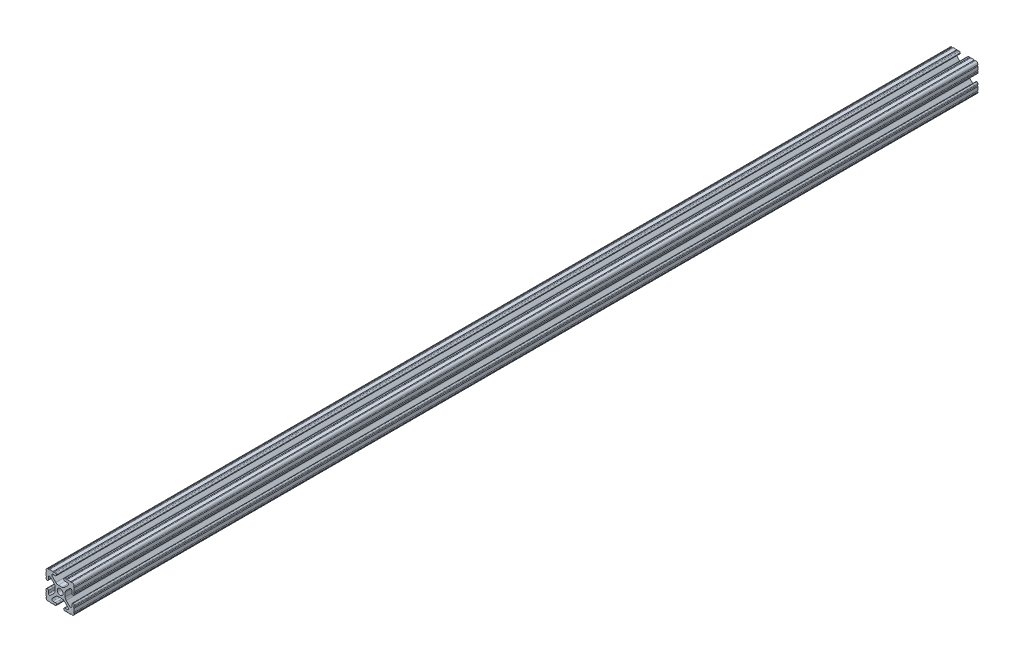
ISO-10303-21;
HEADER;
FILE_DESCRIPTION(('STEP AP214'),'2;1');
FILE_NAME('part.step','',(''),(''),'','','');
FILE_SCHEMA(('AUTOMOTIVE_DESIGN { 1 0 10303 214 1 1 1 1 }'));
ENDSEC;
DATA;
#1=APPLICATION_CONTEXT('core data for automotive mechanical design processes');
#2=APPLICATION_PROTOCOL_DEFINITION('international standard','automotive_design',2000,#1);
#3=PRODUCT_CONTEXT('',#1,'mechanical');
#4=PRODUCT('Part','Part','',(#3));
#5=PRODUCT_RELATED_PRODUCT_CATEGORY('part','',(#4));
#6=PRODUCT_DEFINITION_FORMATION('','',#4);
#7=PRODUCT_DEFINITION_CONTEXT('part definition',#1,'design');
#8=PRODUCT_DEFINITION('design','',#6,#7);
#9=PRODUCT_DEFINITION_SHAPE('','',#8);
#10=(LENGTH_UNIT() NAMED_UNIT(*) SI_UNIT(.MILLI.,.METRE.));
#11=(NAMED_UNIT(*) PLANE_ANGLE_UNIT() SI_UNIT($,.RADIAN.));
#12=(NAMED_UNIT(*) SI_UNIT($,.STERADIAN.) SOLID_ANGLE_UNIT());
#13=UNCERTAINTY_MEASURE_WITH_UNIT(LENGTH_MEASURE(1.E-05),#10,'distance_accuracy_value','');
#14=(GEOMETRIC_REPRESENTATION_CONTEXT(3) GLOBAL_UNCERTAINTY_ASSIGNED_CONTEXT((#13)) GLOBAL_UNIT_ASSIGNED_CONTEXT((#10,
#11,#12)) REPRESENTATION_CONTEXT('',''));
#15=CARTESIAN_POINT('',(0.,0.,0.));
#16=DIRECTION('',(0.,0.,1.));
#17=DIRECTION('',(1.,0.,0.));
#18=AXIS2_PLACEMENT_3D('',#15,#16,#17);
#19=CARTESIAN_POINT('',(-1.70925355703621,-7.67080000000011,-812.8));
#20=DIRECTION('',(0.,0.,1.));
#21=DIRECTION('',(1.,0.,0.));
#22=AXIS2_PLACEMENT_3D('',#19,#20,#21);
#23=CYLINDRICAL_SURFACE('',#22,3.17500000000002);
#24=CARTESIAN_POINT('',(-1.70925355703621,-7.67080000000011,0.));
#25=DIRECTION('',(0.,0.,-1.));
#26=DIRECTION('',(1.,0.,0.));
#27=AXIS2_PLACEMENT_3D('',#24,#25,#26);
#28=CIRCLE('',#27,3.17500000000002);
#29=CARTESIAN_POINT('',(-3.95227025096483,-5.42369049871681,0.));
#30=VERTEX_POINT('',#29);
#31=CARTESIAN_POINT('',(-1.70925355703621,-4.49580000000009,0.));
#32=VERTEX_POINT('',#31);
#33=EDGE_CURVE('E661',#30,#32,#28,.T.);
#34=ORIENTED_EDGE('',*,*,#33,.F.);
#35=DIRECTION('',(0.,0.,1.));
#36=VECTOR('',#35,1.);
#37=CARTESIAN_POINT('',(-3.95227025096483,-5.42369049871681,-812.8));
#38=LINE('',#37,#36);
#39=CARTESIAN_POINT('',(-3.95227025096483,-5.42369049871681,-812.8));
#40=VERTEX_POINT('',#39);
#41=EDGE_CURVE('E11',#40,#30,#38,.T.);
#42=ORIENTED_EDGE('',*,*,#41,.F.);
#43=CARTESIAN_POINT('',(-1.70925355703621,-7.67080000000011,-812.8));
#44=DIRECTION('',(0.,0.,-1.));
#45=DIRECTION('',(1.,0.,0.));
#46=AXIS2_PLACEMENT_3D('',#43,#44,#45);
#47=CIRCLE('',#46,3.17500000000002);
#48=CARTESIAN_POINT('',(-1.70925355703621,-4.49580000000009,-812.8));
#49=VERTEX_POINT('',#48);
#50=EDGE_CURVE('E946',#40,#49,#47,.T.);
#51=ORIENTED_EDGE('',*,*,#50,.T.);
#52=DIRECTION('',(0.,0.,1.));
#53=VECTOR('',#52,1.);
#54=CARTESIAN_POINT('',(-1.70925355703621,-4.49580000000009,-812.8));
#55=LINE('',#54,#53);
#56=EDGE_CURVE('E39',#49,#32,#55,.T.);
#57=ORIENTED_EDGE('',*,*,#56,.T.);
#58=EDGE_LOOP('',(#34,#42,#51,#57));
#59=FACE_BOUND('',#58,.T.);
#60=ADVANCED_FACE('F36',(#59),#23,.F.);
#61=CARTESIAN_POINT('',(-3.95227025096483,-5.42369049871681,-812.8));
#62=DIRECTION('',(0.706461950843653,-0.707751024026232,0.));
#63=DIRECTION('',(0.707751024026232,0.706461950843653,0.));
#64=AXIS2_PLACEMENT_3D('',#61,#62,#63);
#65=PLANE('',#64);
#66=DIRECTION('',(0.707751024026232,0.706461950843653,0.));
#67=VECTOR('',#66,1.);
#68=CARTESIAN_POINT('',(-3.95227025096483,-5.42369049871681,0.));
#69=LINE('',#68,#67);
#70=CARTESIAN_POINT('',(-7.17965049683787,-8.64519250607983,0.));
#71=VERTEX_POINT('',#70);
#72=EDGE_CURVE('E944',#71,#30,#69,.T.);
#73=ORIENTED_EDGE('',*,*,#72,.F.);
#74=DIRECTION('',(0.,0.,1.));
#75=VECTOR('',#74,1.);
#76=CARTESIAN_POINT('',(-7.17965049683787,-8.64519250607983,-812.8));
#77=LINE('',#76,#75);
#78=CARTESIAN_POINT('',(-7.17965049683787,-8.64519250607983,-812.8));
#79=VERTEX_POINT('',#78);
#80=EDGE_CURVE('E45',#79,#71,#77,.T.);
#81=ORIENTED_EDGE('',*,*,#80,.F.);
#82=DIRECTION('',(0.707751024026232,0.706461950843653,0.));
#83=VECTOR('',#82,1.);
#84=CARTESIAN_POINT('',(-3.95227025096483,-5.42369049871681,-812.8));
#85=LINE('',#84,#83);
#86=EDGE_CURVE('E651',#79,#40,#85,.T.);
#87=ORIENTED_EDGE('',*,*,#86,.T.);
#88=ORIENTED_EDGE('',*,*,#41,.T.);
#89=EDGE_LOOP('',(#73,#81,#87,#88));
#90=FACE_BOUND('',#89,.T.);
#91=ADVANCED_FACE('F1134',(#90),#65,.T.);
#92=CARTESIAN_POINT('',(-6.41640832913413,-9.40982735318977,-812.8));
#93=DIRECTION('',(0.,0.,1.));
#94=DIRECTION('',(1.,0.,0.));
#95=AXIS2_PLACEMENT_3D('',#92,#93,#94);
#96=CYLINDRICAL_SURFACE('',#95,1.08037264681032);
#97=CARTESIAN_POINT('',(-6.41640832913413,-9.40982735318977,0.));
#98=DIRECTION('',(0.,0.,-1.));
#99=DIRECTION('',(-1.,0.,0.));
#100=AXIS2_PLACEMENT_3D('',#97,#98,#99);
#101=CIRCLE('',#100,1.08037264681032);
#102=CARTESIAN_POINT('',(-6.41640832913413,-10.4902000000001,0.));
#103=VERTEX_POINT('',#102);
#104=EDGE_CURVE('E638',#103,#71,#101,.T.);
#105=ORIENTED_EDGE('',*,*,#104,.F.);
#106=DIRECTION('',(0.,0.,1.));
#107=VECTOR('',#106,1.);
#108=CARTESIAN_POINT('',(-6.41640832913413,-10.4902000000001,-812.8));
#109=LINE('',#108,#107);
#110=CARTESIAN_POINT('',(-6.41640832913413,-10.4902000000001,-812.8));
#111=VERTEX_POINT('',#110);
#112=EDGE_CURVE('E633',#111,#103,#109,.T.);
#113=ORIENTED_EDGE('',*,*,#112,.F.);
#114=CARTESIAN_POINT('',(-6.41640832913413,-9.40982735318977,-812.8));
#115=DIRECTION('',(0.,0.,-1.));
#116=DIRECTION('',(-1.,0.,0.));
#117=AXIS2_PLACEMENT_3D('',#114,#115,#116);
#118=CIRCLE('',#117,1.08037264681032);
#119=EDGE_CURVE('E636',#111,#79,#118,.T.);
#120=ORIENTED_EDGE('',*,*,#119,.T.);
#121=ORIENTED_EDGE('',*,*,#80,.T.);
#122=EDGE_LOOP('',(#105,#113,#120,#121));
#123=FACE_BOUND('',#122,.T.);
#124=ADVANCED_FACE('F635',(#123),#96,.F.);
#125=CARTESIAN_POINT('',(-6.41640832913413,-10.4902000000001,-812.8));
#126=DIRECTION('',(0.,1.,0.));
#127=DIRECTION('',(0.,0.,1.));
#128=AXIS2_PLACEMENT_3D('',#125,#126,#127);
#129=PLANE('',#128);
#130=DIRECTION('',(-1.,0.,0.));
#131=VECTOR('',#130,1.);
#132=CARTESIAN_POINT('',(-6.41640832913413,-10.4902000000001,0.));
#133=LINE('',#132,#131);
#134=CARTESIAN_POINT('',(-4.2875124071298,-10.4902000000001,0.));
#135=VERTEX_POINT('',#134);
#136=EDGE_CURVE('E941',#135,#103,#133,.T.);
#137=ORIENTED_EDGE('',*,*,#136,.F.);
#138=DIRECTION('',(0.,0.,1.));
#139=VECTOR('',#138,1.);
#140=CARTESIAN_POINT('',(-4.2875124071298,-10.4902000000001,-812.8));
#141=LINE('',#140,#139);
#142=CARTESIAN_POINT('',(-4.2875124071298,-10.4902000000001,-812.8));
#143=VERTEX_POINT('',#142);
#144=EDGE_CURVE('E643',#143,#135,#141,.T.);
#145=ORIENTED_EDGE('',*,*,#144,.F.);
#146=DIRECTION('',(-1.,0.,0.));
#147=VECTOR('',#146,1.);
#148=CARTESIAN_POINT('',(-6.41640832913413,-10.4902000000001,-812.8));
#149=LINE('',#148,#147);
#150=EDGE_CURVE('E649',#143,#111,#149,.T.);
#151=ORIENTED_EDGE('',*,*,#150,.T.);
#152=ORIENTED_EDGE('',*,*,#112,.T.);
#153=EDGE_LOOP('',(#137,#145,#151,#152));
#154=FACE_BOUND('',#153,.T.);
#155=ADVANCED_FACE('F653',(#154),#129,.T.);
#156=CARTESIAN_POINT('',(-4.2875124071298,-11.5392124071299,-812.8));
#157=DIRECTION('',(0.,0.,1.));
#158=DIRECTION('',(1.,0.,0.));
#159=AXIS2_PLACEMENT_3D('',#156,#157,#158);
#160=CYLINDRICAL_SURFACE('',#159,1.04901240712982);
#161=CARTESIAN_POINT('',(-4.2875124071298,-11.5392124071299,0.));
#162=DIRECTION('',(0.,0.,1.));
#163=DIRECTION('',(-1.,0.,0.));
#164=AXIS2_PLACEMENT_3D('',#161,#162,#163);
#165=CIRCLE('',#164,1.04901240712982);
#166=CARTESIAN_POINT('',(-3.23849999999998,-11.5392124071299,0.));
#167=VERTEX_POINT('',#166);
#168=EDGE_CURVE('E938',#167,#135,#165,.T.);
#169=ORIENTED_EDGE('',*,*,#168,.F.);
#170=DIRECTION('',(0.,0.,1.));
#171=VECTOR('',#170,1.);
#172=CARTESIAN_POINT('',(-3.23849999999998,-11.5392124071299,-812.8));
#173=LINE('',#172,#171);
#174=CARTESIAN_POINT('',(-3.23849999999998,-11.5392124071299,-812.8));
#175=VERTEX_POINT('',#174);
#176=EDGE_CURVE('E950',#175,#167,#173,.T.);
#177=ORIENTED_EDGE('',*,*,#176,.F.);
#178=CARTESIAN_POINT('',(-4.2875124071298,-11.5392124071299,-812.8));
#179=DIRECTION('',(0.,0.,1.));
#180=DIRECTION('',(-1.,0.,0.));
#181=AXIS2_PLACEMENT_3D('',#178,#179,#180);
#182=CIRCLE('',#181,1.04901240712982);
#183=EDGE_CURVE('E654',#175,#143,#182,.T.);
#184=ORIENTED_EDGE('',*,*,#183,.T.);
#185=ORIENTED_EDGE('',*,*,#144,.T.);
#186=EDGE_LOOP('',(#169,#177,#184,#185));
#187=FACE_BOUND('',#186,.T.);
#188=ADVANCED_FACE('F1147',(#187),#160,.T.);
#189=CARTESIAN_POINT('',(-3.23849999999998,-11.5392124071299,-812.8));
#190=DIRECTION('',(1.,0.,0.));
#191=DIRECTION('',(0.,1.,0.));
#192=AXIS2_PLACEMENT_3D('',#189,#190,#191);
#193=PLANE('',#192);
#194=DIRECTION('',(0.,1.,0.));
#195=VECTOR('',#194,1.);
#196=CARTESIAN_POINT('',(-3.23849999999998,-11.5392124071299,0.));
#197=LINE('',#196,#195);
#198=CARTESIAN_POINT('',(-3.23849999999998,-11.6509875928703,0.));
#199=VERTEX_POINT('',#198);
#200=EDGE_CURVE('E935',#199,#167,#197,.T.);
#201=ORIENTED_EDGE('',*,*,#200,.F.);
#202=DIRECTION('',(0.,0.,1.));
#203=VECTOR('',#202,1.);
#204=CARTESIAN_POINT('',(-3.23849999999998,-11.6509875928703,-812.8));
#205=LINE('',#204,#203);
#206=CARTESIAN_POINT('',(-3.23849999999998,-11.6509875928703,-812.8));
#207=VERTEX_POINT('',#206);
#208=EDGE_CURVE('E952',#207,#199,#205,.T.);
#209=ORIENTED_EDGE('',*,*,#208,.F.);
#210=DIRECTION('',(0.,1.,0.));
#211=VECTOR('',#210,1.);
#212=CARTESIAN_POINT('',(-3.23849999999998,-11.5392124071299,-812.8));
#213=LINE('',#212,#211);
#214=EDGE_CURVE('E656',#207,#175,#213,.T.);
#215=ORIENTED_EDGE('',*,*,#214,.T.);
#216=ORIENTED_EDGE('',*,*,#176,.T.);
#217=EDGE_LOOP('',(#201,#209,#215,#216));
#218=FACE_BOUND('',#217,.T.);
#219=ADVANCED_FACE('F1150',(#218),#193,.T.);
#220=CARTESIAN_POINT('',(-4.2875124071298,-11.6509875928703,-812.8));
#221=DIRECTION('',(0.,0.,1.));
#222=DIRECTION('',(1.,0.,0.));
#223=AXIS2_PLACEMENT_3D('',#220,#221,#222);
#224=CYLINDRICAL_SURFACE('',#223,1.04901240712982);
#225=CARTESIAN_POINT('',(-4.2875124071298,-11.6509875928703,0.));
#226=DIRECTION('',(0.,0.,1.));
#227=DIRECTION('',(-1.,0.,0.));
#228=AXIS2_PLACEMENT_3D('',#225,#226,#227);
#229=CIRCLE('',#228,1.04901240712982);
#230=CARTESIAN_POINT('',(-4.2875124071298,-12.7000000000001,0.));
#231=VERTEX_POINT('',#230);
#232=EDGE_CURVE('E932',#231,#199,#229,.T.);
#233=ORIENTED_EDGE('',*,*,#232,.F.);
#234=DIRECTION('',(0.,0.,1.));
#235=VECTOR('',#234,1.);
#236=CARTESIAN_POINT('',(-4.2875124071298,-12.7000000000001,-812.8));
#237=LINE('',#236,#235);
#238=CARTESIAN_POINT('',(-4.2875124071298,-12.7000000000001,-812.8));
#239=VERTEX_POINT('',#238);
#240=EDGE_CURVE('E954',#239,#231,#237,.T.);
#241=ORIENTED_EDGE('',*,*,#240,.F.);
#242=CARTESIAN_POINT('',(-4.2875124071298,-11.6509875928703,-812.8));
#243=DIRECTION('',(0.,0.,1.));
#244=DIRECTION('',(-1.,0.,0.));
#245=AXIS2_PLACEMENT_3D('',#242,#243,#244);
#246=CIRCLE('',#245,1.04901240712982);
#247=EDGE_CURVE('E1801',#239,#207,#246,.T.);
#248=ORIENTED_EDGE('',*,*,#247,.T.);
#249=ORIENTED_EDGE('',*,*,#208,.T.);
#250=EDGE_LOOP('',(#233,#241,#248,#249));
#251=FACE_BOUND('',#250,.T.);
#252=ADVANCED_FACE('F1154',(#251),#224,.T.);
#253=CARTESIAN_POINT('',(-4.2875124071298,-12.7000000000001,-812.8));
#254=DIRECTION('',(0.,-1.,0.));
#255=DIRECTION('',(1.,0.,0.));
#256=AXIS2_PLACEMENT_3D('',#253,#254,#255);
#257=PLANE('',#256);
#258=DIRECTION('',(1.,0.,0.));
#259=VECTOR('',#258,1.);
#260=CARTESIAN_POINT('',(-4.2875124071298,-12.7000000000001,0.));
#261=LINE('',#260,#259);
#262=CARTESIAN_POINT('',(-5.31712671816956,-12.7000000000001,0.));
#263=VERTEX_POINT('',#262);
#264=EDGE_CURVE('E929',#263,#231,#261,.T.);
#265=ORIENTED_EDGE('',*,*,#264,.F.);
#266=DIRECTION('',(0.,0.,1.));
#267=VECTOR('',#266,1.);
#268=CARTESIAN_POINT('',(-5.31712671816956,-12.7000000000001,-812.8));
#269=LINE('',#268,#267);
#270=CARTESIAN_POINT('',(-5.31712671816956,-12.7000000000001,-812.8));
#271=VERTEX_POINT('',#270);
#272=EDGE_CURVE('E956',#271,#263,#269,.T.);
#273=ORIENTED_EDGE('',*,*,#272,.F.);
#274=DIRECTION('',(1.,0.,0.));
#275=VECTOR('',#274,1.);
#276=CARTESIAN_POINT('',(-4.2875124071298,-12.7000000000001,-812.8));
#277=LINE('',#276,#275);
#278=EDGE_CURVE('E1798',#271,#239,#277,.T.);
#279=ORIENTED_EDGE('',*,*,#278,.T.);
#280=ORIENTED_EDGE('',*,*,#240,.T.);
#281=EDGE_LOOP('',(#265,#273,#279,#280));
#282=FACE_BOUND('',#281,.T.);
#283=ADVANCED_FACE('F1158',(#282),#257,.T.);
#284=CARTESIAN_POINT('',(-5.82512671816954,-12.7000000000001,-812.8));
#285=DIRECTION('',(0.,0.,1.));
#286=DIRECTION('',(1.,0.,0.));
#287=AXIS2_PLACEMENT_3D('',#284,#285,#286);
#288=CYLINDRICAL_SURFACE('',#287,0.507999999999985);
#289=CARTESIAN_POINT('',(-5.82512671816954,-12.7000000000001,0.));
#290=DIRECTION('',(0.,0.,-1.));
#291=DIRECTION('',(-1.,0.,0.));
#292=AXIS2_PLACEMENT_3D('',#289,#290,#291);
#293=CIRCLE('',#292,0.507999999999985);
#294=CARTESIAN_POINT('',(-6.33312671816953,-12.7000000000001,0.));
#295=VERTEX_POINT('',#294);
#296=EDGE_CURVE('E926',#295,#263,#293,.T.);
#297=ORIENTED_EDGE('',*,*,#296,.F.);
#298=DIRECTION('',(0.,0.,1.));
#299=VECTOR('',#298,1.);
#300=CARTESIAN_POINT('',(-6.33312671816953,-12.7000000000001,-812.8));
#301=LINE('',#300,#299);
#302=CARTESIAN_POINT('',(-6.33312671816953,-12.7000000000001,-812.8));
#303=VERTEX_POINT('',#302);
#304=EDGE_CURVE('E958',#303,#295,#301,.T.);
#305=ORIENTED_EDGE('',*,*,#304,.F.);
#306=CARTESIAN_POINT('',(-5.82512671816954,-12.7000000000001,-812.8));
#307=DIRECTION('',(0.,0.,-1.));
#308=DIRECTION('',(-1.,0.,0.));
#309=AXIS2_PLACEMENT_3D('',#306,#307,#308);
#310=CIRCLE('',#309,0.507999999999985);
#311=EDGE_CURVE('E1795',#303,#271,#310,.T.);
#312=ORIENTED_EDGE('',*,*,#311,.T.);
#313=ORIENTED_EDGE('',*,*,#272,.T.);
#314=EDGE_LOOP('',(#297,#305,#312,#313));
#315=FACE_BOUND('',#314,.T.);
#316=ADVANCED_FACE('F1162',(#315),#288,.F.);
#317=CARTESIAN_POINT('',(-6.33312671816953,-12.7000000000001,-812.8));
#318=DIRECTION('',(0.,-1.,0.));
#319=DIRECTION('',(0.,0.,-1.));
#320=AXIS2_PLACEMENT_3D('',#317,#318,#319);
#321=PLANE('',#320);
#322=DIRECTION('',(1.,0.,0.));
#323=VECTOR('',#322,1.);
#324=CARTESIAN_POINT('',(-6.33312671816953,-12.7000000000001,0.));
#325=LINE('',#324,#323);
#326=CARTESIAN_POINT('',(-9.55044311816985,-12.7000000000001,0.));
#327=VERTEX_POINT('',#326);
#328=EDGE_CURVE('E923',#327,#295,#325,.T.);
#329=ORIENTED_EDGE('',*,*,#328,.F.);
#330=DIRECTION('',(0.,0.,1.));
#331=VECTOR('',#330,1.);
#332=CARTESIAN_POINT('',(-9.55044311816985,-12.7000000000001,-812.8));
#333=LINE('',#332,#331);
#334=CARTESIAN_POINT('',(-9.55044311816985,-12.7000000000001,-812.8));
#335=VERTEX_POINT('',#334);
#336=EDGE_CURVE('E960',#335,#327,#333,.T.);
#337=ORIENTED_EDGE('',*,*,#336,.F.);
#338=DIRECTION('',(1.,0.,0.));
#339=VECTOR('',#338,1.);
#340=CARTESIAN_POINT('',(-6.33312671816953,-12.7000000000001,-812.8));
#341=LINE('',#340,#339);
#342=EDGE_CURVE('E1792',#335,#303,#341,.T.);
#343=ORIENTED_EDGE('',*,*,#342,.T.);
#344=ORIENTED_EDGE('',*,*,#304,.T.);
#345=EDGE_LOOP('',(#329,#337,#343,#344));
#346=FACE_BOUND('',#345,.T.);
#347=ADVANCED_FACE('F1166',(#346),#321,.T.);
#348=CARTESIAN_POINT('',(-10.0584431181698,-12.7000000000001,-812.8));
#349=DIRECTION('',(0.,0.,1.));
#350=DIRECTION('',(1.,0.,0.));
#351=AXIS2_PLACEMENT_3D('',#348,#349,#350);
#352=CYLINDRICAL_SURFACE('',#351,0.507999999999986);
#353=CARTESIAN_POINT('',(-10.0584431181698,-12.7000000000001,0.));
#354=DIRECTION('',(0.,0.,-1.));
#355=DIRECTION('',(-1.,0.,0.));
#356=AXIS2_PLACEMENT_3D('',#353,#354,#355);
#357=CIRCLE('',#356,0.507999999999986);
#358=CARTESIAN_POINT('',(-10.5664430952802,-12.6998475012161,0.));
#359=VERTEX_POINT('',#358);
#360=EDGE_CURVE('E920',#359,#327,#357,.T.);
#361=ORIENTED_EDGE('',*,*,#360,.F.);
#362=DIRECTION('',(0.,0.,1.));
#363=VECTOR('',#362,1.);
#364=CARTESIAN_POINT('',(-10.5664430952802,-12.6998475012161,-812.8));
#365=LINE('',#364,#363);
#366=CARTESIAN_POINT('',(-10.5664430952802,-12.6998475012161,-812.8));
#367=VERTEX_POINT('',#366);
#368=EDGE_CURVE('E962',#367,#359,#365,.T.);
#369=ORIENTED_EDGE('',*,*,#368,.F.);
#370=CARTESIAN_POINT('',(-10.0584431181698,-12.7000000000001,-812.8));
#371=DIRECTION('',(0.,0.,-1.));
#372=DIRECTION('',(-1.,0.,0.));
#373=AXIS2_PLACEMENT_3D('',#370,#371,#372);
#374=CIRCLE('',#373,0.507999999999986);
#375=EDGE_CURVE('E1789',#367,#335,#374,.T.);
#376=ORIENTED_EDGE('',*,*,#375,.T.);
#377=ORIENTED_EDGE('',*,*,#336,.T.);
#378=EDGE_LOOP('',(#361,#369,#376,#377));
#379=FACE_BOUND('',#378,.T.);
#380=ADVANCED_FACE('F1170',(#379),#352,.F.);
#381=CARTESIAN_POINT('',(-10.5918000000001,-10.5918000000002,-812.8));
#382=DIRECTION('',(0.,0.,1.));
#383=DIRECTION('',(1.,0.,0.));
#384=AXIS2_PLACEMENT_3D('',#381,#382,#383);
#385=CYLINDRICAL_SURFACE('',#384,2.1081999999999);
#386=CARTESIAN_POINT('',(-10.5918000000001,-10.5918000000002,0.));
#387=DIRECTION('',(0.,0.,1.));
#388=DIRECTION('',(-1.,0.,0.));
#389=AXIS2_PLACEMENT_3D('',#386,#387,#388);
#390=CIRCLE('',#389,2.1081999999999);
#391=CARTESIAN_POINT('',(-12.699846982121,-10.5663999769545,0.));
#392=VERTEX_POINT('',#391);
#393=EDGE_CURVE('E917',#392,#359,#390,.T.);
#394=ORIENTED_EDGE('',*,*,#393,.F.);
#395=DIRECTION('',(0.,0.,1.));
#396=VECTOR('',#395,1.);
#397=CARTESIAN_POINT('',(-12.699846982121,-10.5663999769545,-812.8));
#398=LINE('',#397,#396);
#399=CARTESIAN_POINT('',(-12.699846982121,-10.5663999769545,-812.8));
#400=VERTEX_POINT('',#399);
#401=EDGE_CURVE('E964',#400,#392,#398,.T.);
#402=ORIENTED_EDGE('',*,*,#401,.F.);
#403=CARTESIAN_POINT('',(-10.5918000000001,-10.5918000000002,-812.8));
#404=DIRECTION('',(0.,0.,1.));
#405=DIRECTION('',(-1.,0.,0.));
#406=AXIS2_PLACEMENT_3D('',#403,#404,#405);
#407=CIRCLE('',#406,2.1081999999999);
#408=EDGE_CURVE('E1786',#400,#367,#407,.T.);
#409=ORIENTED_EDGE('',*,*,#408,.T.);
#410=ORIENTED_EDGE('',*,*,#368,.T.);
#411=EDGE_LOOP('',(#394,#402,#409,#410));
#412=FACE_BOUND('',#411,.T.);
#413=ADVANCED_FACE('F1174',(#412),#385,.T.);
#414=CARTESIAN_POINT('',(-12.7,-10.0584000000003,-812.8));
#415=DIRECTION('',(0.,0.,1.));
#416=DIRECTION('',(1.,0.,0.));
#417=AXIS2_PLACEMENT_3D('',#414,#415,#416);
#418=CYLINDRICAL_SURFACE('',#417,0.507999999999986);
#419=CARTESIAN_POINT('',(-12.7,-10.0584000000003,0.));
#420=DIRECTION('',(0.,0.,-1.));
#421=DIRECTION('',(-1.,0.,0.));
#422=AXIS2_PLACEMENT_3D('',#419,#420,#421);
#423=CIRCLE('',#422,0.507999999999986);
#424=CARTESIAN_POINT('',(-12.7,-9.5504000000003,0.));
#425=VERTEX_POINT('',#424);
#426=EDGE_CURVE('E914',#425,#392,#423,.T.);
#427=ORIENTED_EDGE('',*,*,#426,.F.);
#428=DIRECTION('',(0.,0.,1.));
#429=VECTOR('',#428,1.);
#430=CARTESIAN_POINT('',(-12.7,-9.5504000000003,-812.8));
#431=LINE('',#430,#429);
#432=CARTESIAN_POINT('',(-12.7,-9.5504000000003,-812.8));
#433=VERTEX_POINT('',#432);
#434=EDGE_CURVE('E966',#433,#425,#431,.T.);
#435=ORIENTED_EDGE('',*,*,#434,.F.);
#436=CARTESIAN_POINT('',(-12.7,-10.0584000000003,-812.8));
#437=DIRECTION('',(0.,0.,-1.));
#438=DIRECTION('',(-1.,0.,0.));
#439=AXIS2_PLACEMENT_3D('',#436,#437,#438);
#440=CIRCLE('',#439,0.507999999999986);
#441=EDGE_CURVE('E1783',#433,#400,#440,.T.);
#442=ORIENTED_EDGE('',*,*,#441,.T.);
#443=ORIENTED_EDGE('',*,*,#401,.T.);
#444=EDGE_LOOP('',(#427,#435,#442,#443));
#445=FACE_BOUND('',#444,.T.);
#446=ADVANCED_FACE('F1178',(#445),#418,.F.);
#447=CARTESIAN_POINT('',(-12.7,-9.5504000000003,-812.8));
#448=DIRECTION('',(-1.,0.,0.));
#449=DIRECTION('',(0.,-1.,0.));
#450=AXIS2_PLACEMENT_3D('',#447,#448,#449);
#451=PLANE('',#450);
#452=DIRECTION('',(0.,-1.,0.));
#453=VECTOR('',#452,1.);
#454=CARTESIAN_POINT('',(-12.7,-9.5504000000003,0.));
#455=LINE('',#454,#453);
#456=CARTESIAN_POINT('',(-12.7,-6.33308359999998,0.));
#457=VERTEX_POINT('',#456);
#458=EDGE_CURVE('E911',#457,#425,#455,.T.);
#459=ORIENTED_EDGE('',*,*,#458,.F.);
#460=DIRECTION('',(0.,0.,1.));
#461=VECTOR('',#460,1.);
#462=CARTESIAN_POINT('',(-12.7,-6.33308359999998,-812.8));
#463=LINE('',#462,#461);
#464=CARTESIAN_POINT('',(-12.7,-6.33308359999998,-812.8));
#465=VERTEX_POINT('',#464);
#466=EDGE_CURVE('E968',#465,#457,#463,.T.);
#467=ORIENTED_EDGE('',*,*,#466,.F.);
#468=DIRECTION('',(0.,-1.,0.));
#469=VECTOR('',#468,1.);
#470=CARTESIAN_POINT('',(-12.7,-9.5504000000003,-812.8));
#471=LINE('',#470,#469);
#472=EDGE_CURVE('E1780',#465,#433,#471,.T.);
#473=ORIENTED_EDGE('',*,*,#472,.T.);
#474=ORIENTED_EDGE('',*,*,#434,.T.);
#475=EDGE_LOOP('',(#459,#467,#473,#474));
#476=FACE_BOUND('',#475,.T.);
#477=ADVANCED_FACE('F1182',(#476),#451,.T.);
#478=CARTESIAN_POINT('',(-12.7,-5.8250836,-812.8));
#479=DIRECTION('',(0.,0.,1.));
#480=DIRECTION('',(1.,0.,0.));
#481=AXIS2_PLACEMENT_3D('',#478,#479,#480);
#482=CYLINDRICAL_SURFACE('',#481,0.507999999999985);
#483=CARTESIAN_POINT('',(-12.7,-5.8250836,0.));
#484=DIRECTION('',(0.,0.,-1.));
#485=DIRECTION('',(-1.,0.,0.));
#486=AXIS2_PLACEMENT_3D('',#483,#484,#485);
#487=CIRCLE('',#486,0.507999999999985);
#488=CARTESIAN_POINT('',(-12.7,-5.31708360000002,0.));
#489=VERTEX_POINT('',#488);
#490=EDGE_CURVE('E908',#489,#457,#487,.T.);
#491=ORIENTED_EDGE('',*,*,#490,.F.);
#492=DIRECTION('',(0.,0.,1.));
#493=VECTOR('',#492,1.);
#494=CARTESIAN_POINT('',(-12.7,-5.31708360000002,-812.8));
#495=LINE('',#494,#493);
#496=CARTESIAN_POINT('',(-12.7,-5.31708360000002,-812.8));
#497=VERTEX_POINT('',#496);
#498=EDGE_CURVE('E970',#497,#489,#495,.T.);
#499=ORIENTED_EDGE('',*,*,#498,.F.);
#500=CARTESIAN_POINT('',(-12.7,-5.8250836,-812.8));
#501=DIRECTION('',(0.,0.,-1.));
#502=DIRECTION('',(-1.,0.,0.));
#503=AXIS2_PLACEMENT_3D('',#500,#501,#502);
#504=CIRCLE('',#503,0.507999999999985);
#505=EDGE_CURVE('E1777',#497,#465,#504,.T.);
#506=ORIENTED_EDGE('',*,*,#505,.T.);
#507=ORIENTED_EDGE('',*,*,#466,.T.);
#508=EDGE_LOOP('',(#491,#499,#506,#507));
#509=FACE_BOUND('',#508,.T.);
#510=ADVANCED_FACE('F1186',(#509),#482,.F.);
#511=CARTESIAN_POINT('',(-12.7,-5.31708360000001,-812.8));
#512=DIRECTION('',(-1.,0.,0.));
#513=DIRECTION('',(0.,-1.,0.));
#514=AXIS2_PLACEMENT_3D('',#511,#512,#513);
#515=PLANE('',#514);
#516=DIRECTION('',(0.,-1.,0.));
#517=VECTOR('',#516,1.);
#518=CARTESIAN_POINT('',(-12.7,-5.31708360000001,0.));
#519=LINE('',#518,#517);
#520=CARTESIAN_POINT('',(-12.7,-4.28746928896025,0.));
#521=VERTEX_POINT('',#520);
#522=EDGE_CURVE('E905',#521,#489,#519,.T.);
#523=ORIENTED_EDGE('',*,*,#522,.F.);
#524=DIRECTION('',(0.,0.,1.));
#525=VECTOR('',#524,1.);
#526=CARTESIAN_POINT('',(-12.7,-4.28746928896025,-812.8));
#527=LINE('',#526,#525);
#528=CARTESIAN_POINT('',(-12.7,-4.28746928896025,-812.8));
#529=VERTEX_POINT('',#528);
#530=EDGE_CURVE('E972',#529,#521,#527,.T.);
#531=ORIENTED_EDGE('',*,*,#530,.F.);
#532=DIRECTION('',(0.,-1.,0.));
#533=VECTOR('',#532,1.);
#534=CARTESIAN_POINT('',(-12.7,-5.31708360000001,-812.8));
#535=LINE('',#534,#533);
#536=EDGE_CURVE('E1774',#529,#497,#535,.T.);
#537=ORIENTED_EDGE('',*,*,#536,.T.);
#538=ORIENTED_EDGE('',*,*,#498,.T.);
#539=EDGE_LOOP('',(#523,#531,#537,#538));
#540=FACE_BOUND('',#539,.T.);
#541=ADVANCED_FACE('F1190',(#540),#515,.T.);
#542=CARTESIAN_POINT('',(-11.6509875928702,-4.28746928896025,-812.8));
#543=DIRECTION('',(0.,0.,1.));
#544=DIRECTION('',(1.,0.,0.));
#545=AXIS2_PLACEMENT_3D('',#542,#543,#544);
#546=CYLINDRICAL_SURFACE('',#545,1.04901240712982);
#547=CARTESIAN_POINT('',(-11.6509875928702,-4.28746928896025,0.));
#548=DIRECTION('',(0.,0.,1.));
#549=DIRECTION('',(-1.,0.,0.));
#550=AXIS2_PLACEMENT_3D('',#547,#548,#549);
#551=CIRCLE('',#550,1.04901240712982);
#552=CARTESIAN_POINT('',(-11.6509875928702,-3.23845688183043,0.));
#553=VERTEX_POINT('',#552);
#554=EDGE_CURVE('E902',#553,#521,#551,.T.);
#555=ORIENTED_EDGE('',*,*,#554,.F.);
#556=DIRECTION('',(0.,0.,1.));
#557=VECTOR('',#556,1.);
#558=CARTESIAN_POINT('',(-11.6509875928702,-3.23845688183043,-812.8));
#559=LINE('',#558,#557);
#560=CARTESIAN_POINT('',(-11.6509875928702,-3.23845688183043,-812.8));
#561=VERTEX_POINT('',#560);
#562=EDGE_CURVE('E974',#561,#553,#559,.T.);
#563=ORIENTED_EDGE('',*,*,#562,.F.);
#564=CARTESIAN_POINT('',(-11.6509875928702,-4.28746928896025,-812.8));
#565=DIRECTION('',(0.,0.,1.));
#566=DIRECTION('',(-1.,0.,0.));
#567=AXIS2_PLACEMENT_3D('',#564,#565,#566);
#568=CIRCLE('',#567,1.04901240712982);
#569=EDGE_CURVE('E1771',#561,#529,#568,.T.);
#570=ORIENTED_EDGE('',*,*,#569,.T.);
#571=ORIENTED_EDGE('',*,*,#530,.T.);
#572=EDGE_LOOP('',(#555,#563,#570,#571));
#573=FACE_BOUND('',#572,.T.);
#574=ADVANCED_FACE('F1194',(#573),#546,.T.);
#575=CARTESIAN_POINT('',(-11.6509875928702,-3.23845688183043,-812.8));
#576=DIRECTION('',(0.,1.,0.));
#577=DIRECTION('',(-1.,0.,0.));
#578=AXIS2_PLACEMENT_3D('',#575,#576,#577);
#579=PLANE('',#578);
#580=DIRECTION('',(-1.,0.,0.));
#581=VECTOR('',#580,1.);
#582=CARTESIAN_POINT('',(-11.6509875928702,-3.23845688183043,0.));
#583=LINE('',#582,#581);
#584=CARTESIAN_POINT('',(-11.5392124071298,-3.23845688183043,0.));
#585=VERTEX_POINT('',#584);
#586=EDGE_CURVE('E899',#585,#553,#583,.T.);
#587=ORIENTED_EDGE('',*,*,#586,.F.);
#588=DIRECTION('',(0.,0.,1.));
#589=VECTOR('',#588,1.);
#590=CARTESIAN_POINT('',(-11.5392124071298,-3.23845688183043,-812.8));
#591=LINE('',#590,#589);
#592=CARTESIAN_POINT('',(-11.5392124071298,-3.23845688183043,-812.8));
#593=VERTEX_POINT('',#592);
#594=EDGE_CURVE('E976',#593,#585,#591,.T.);
#595=ORIENTED_EDGE('',*,*,#594,.F.);
#596=DIRECTION('',(-1.,0.,0.));
#597=VECTOR('',#596,1.);
#598=CARTESIAN_POINT('',(-11.6509875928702,-3.23845688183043,-812.8));
#599=LINE('',#598,#597);
#600=EDGE_CURVE('E1768',#593,#561,#599,.T.);
#601=ORIENTED_EDGE('',*,*,#600,.T.);
#602=ORIENTED_EDGE('',*,*,#562,.T.);
#603=EDGE_LOOP('',(#587,#595,#601,#602));
#604=FACE_BOUND('',#603,.T.);
#605=ADVANCED_FACE('F1198',(#604),#579,.T.);
#606=CARTESIAN_POINT('',(-11.5392124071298,-4.28746928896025,-812.8));
#607=DIRECTION('',(0.,0.,1.));
#608=DIRECTION('',(1.,0.,0.));
#609=AXIS2_PLACEMENT_3D('',#606,#607,#608);
#610=CYLINDRICAL_SURFACE('',#609,1.04901240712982);
#611=CARTESIAN_POINT('',(-11.5392124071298,-4.28746928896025,0.));
#612=DIRECTION('',(0.,0.,1.));
#613=DIRECTION('',(-1.,0.,0.));
#614=AXIS2_PLACEMENT_3D('',#611,#612,#613);
#615=CIRCLE('',#614,1.04901240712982);
#616=CARTESIAN_POINT('',(-10.4902,-4.28746928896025,0.));
#617=VERTEX_POINT('',#616);
#618=EDGE_CURVE('E896',#617,#585,#615,.T.);
#619=ORIENTED_EDGE('',*,*,#618,.F.);
#620=DIRECTION('',(0.,0.,1.));
#621=VECTOR('',#620,1.);
#622=CARTESIAN_POINT('',(-10.4902,-4.28746928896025,-812.8));
#623=LINE('',#622,#621);
#624=CARTESIAN_POINT('',(-10.4902,-4.28746928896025,-812.8));
#625=VERTEX_POINT('',#624);
#626=EDGE_CURVE('E978',#625,#617,#623,.T.);
#627=ORIENTED_EDGE('',*,*,#626,.F.);
#628=CARTESIAN_POINT('',(-11.5392124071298,-4.28746928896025,-812.8));
#629=DIRECTION('',(0.,0.,1.));
#630=DIRECTION('',(-1.,0.,0.));
#631=AXIS2_PLACEMENT_3D('',#628,#629,#630);
#632=CIRCLE('',#631,1.04901240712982);
#633=EDGE_CURVE('E1765',#625,#593,#632,.T.);
#634=ORIENTED_EDGE('',*,*,#633,.T.);
#635=ORIENTED_EDGE('',*,*,#594,.T.);
#636=EDGE_LOOP('',(#619,#627,#634,#635));
#637=FACE_BOUND('',#636,.T.);
#638=ADVANCED_FACE('F1202',(#637),#610,.T.);
#639=CARTESIAN_POINT('',(-10.4902,-4.28746928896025,-812.8));
#640=DIRECTION('',(1.,0.,0.));
#641=DIRECTION('',(0.,0.,-1.));
#642=AXIS2_PLACEMENT_3D('',#639,#640,#641);
#643=PLANE('',#642);
#644=DIRECTION('',(0.,1.,0.));
#645=VECTOR('',#644,1.);
#646=CARTESIAN_POINT('',(-10.4902,-4.28746928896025,0.));
#647=LINE('',#646,#645);
#648=CARTESIAN_POINT('',(-10.4902,-6.4020890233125,0.));
#649=VERTEX_POINT('',#648);
#650=EDGE_CURVE('E893',#649,#617,#647,.T.);
#651=ORIENTED_EDGE('',*,*,#650,.F.);
#652=DIRECTION('',(0.,0.,1.));
#653=VECTOR('',#652,1.);
#654=CARTESIAN_POINT('',(-10.4902,-6.4020890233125,-812.8));
#655=LINE('',#654,#653);
#656=CARTESIAN_POINT('',(-10.4902,-6.4020890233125,-812.8));
#657=VERTEX_POINT('',#656);
#658=EDGE_CURVE('E980',#657,#649,#655,.T.);
#659=ORIENTED_EDGE('',*,*,#658,.F.);
#660=DIRECTION('',(0.,1.,0.));
#661=VECTOR('',#660,1.);
#662=CARTESIAN_POINT('',(-10.4902,-4.28746928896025,-812.8));
#663=LINE('',#662,#661);
#664=EDGE_CURVE('E1762',#657,#625,#663,.T.);
#665=ORIENTED_EDGE('',*,*,#664,.T.);
#666=ORIENTED_EDGE('',*,*,#626,.T.);
#667=EDGE_LOOP('',(#651,#659,#665,#666));
#668=FACE_BOUND('',#667,.T.);
#669=ADVANCED_FACE('F1206',(#668),#643,.T.);
#670=CARTESIAN_POINT('',(-9.4627890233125,-6.4020890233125,-812.8));
#671=DIRECTION('',(0.,0.,1.));
#672=DIRECTION('',(1.,0.,0.));
#673=AXIS2_PLACEMENT_3D('',#670,#671,#672);
#674=CYLINDRICAL_SURFACE('',#673,1.0274109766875);
#675=CARTESIAN_POINT('',(-9.4627890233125,-6.4020890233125,0.));
#676=DIRECTION('',(0.,0.,-1.));
#677=DIRECTION('',(-1.,0.,0.));
#678=AXIS2_PLACEMENT_3D('',#675,#676,#677);
#679=CIRCLE('',#678,1.0274109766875);
#680=CARTESIAN_POINT('',(-8.7371313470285,-7.12940893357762,0.));
#681=VERTEX_POINT('',#680);
#682=EDGE_CURVE('E890',#681,#649,#679,.T.);
#683=ORIENTED_EDGE('',*,*,#682,.F.);
#684=DIRECTION('',(0.,0.,1.));
#685=VECTOR('',#684,1.);
#686=CARTESIAN_POINT('',(-8.7371313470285,-7.12940893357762,-812.8));
#687=LINE('',#686,#685);
#688=CARTESIAN_POINT('',(-8.7371313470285,-7.12940893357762,-812.8));
#689=VERTEX_POINT('',#688);
#690=EDGE_CURVE('E982',#689,#681,#687,.T.);
#691=ORIENTED_EDGE('',*,*,#690,.F.);
#692=CARTESIAN_POINT('',(-9.4627890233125,-6.4020890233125,-812.8));
#693=DIRECTION('',(0.,0.,-1.));
#694=DIRECTION('',(-1.,0.,0.));
#695=AXIS2_PLACEMENT_3D('',#692,#693,#694);
#696=CIRCLE('',#695,1.0274109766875);
#697=EDGE_CURVE('E1759',#689,#657,#696,.T.);
#698=ORIENTED_EDGE('',*,*,#697,.T.);
#699=ORIENTED_EDGE('',*,*,#658,.T.);
#700=EDGE_LOOP('',(#683,#691,#698,#699));
#701=FACE_BOUND('',#700,.T.);
#702=ADVANCED_FACE('F1210',(#701),#674,.F.);
#703=CARTESIAN_POINT('',(-8.7371313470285,-7.12940893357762,-812.8));
#704=DIRECTION('',(-0.706297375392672,0.707915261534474,0.));
#705=DIRECTION('',(-0.707915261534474,-0.706297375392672,0.));
#706=AXIS2_PLACEMENT_3D('',#703,#704,#705);
#707=PLANE('',#706);
#708=DIRECTION('',(-0.707915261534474,-0.706297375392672,0.));
#709=VECTOR('',#708,1.);
#710=CARTESIAN_POINT('',(-8.7371313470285,-7.12940893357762,0.));
#711=LINE('',#710,#709);
#712=CARTESIAN_POINT('',(-5.44100583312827,-3.84081646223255,0.));
#713=VERTEX_POINT('',#712);
#714=EDGE_CURVE('E887',#713,#681,#711,.T.);
#715=ORIENTED_EDGE('',*,*,#714,.F.);
#716=DIRECTION('',(0.,0.,1.));
#717=VECTOR('',#716,1.);
#718=CARTESIAN_POINT('',(-5.44100583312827,-3.84081646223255,-812.8));
#719=LINE('',#718,#717);
#720=CARTESIAN_POINT('',(-5.44100583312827,-3.84081646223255,-812.8));
#721=VERTEX_POINT('',#720);
#722=EDGE_CURVE('E984',#721,#713,#719,.T.);
#723=ORIENTED_EDGE('',*,*,#722,.F.);
#724=DIRECTION('',(-0.707915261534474,-0.706297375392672,0.));
#725=VECTOR('',#724,1.);
#726=CARTESIAN_POINT('',(-8.7371313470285,-7.12940893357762,-812.8));
#727=LINE('',#726,#725);
#728=EDGE_CURVE('E1756',#721,#689,#727,.T.);
#729=ORIENTED_EDGE('',*,*,#728,.T.);
#730=ORIENTED_EDGE('',*,*,#690,.T.);
#731=EDGE_LOOP('',(#715,#723,#729,#730));
#732=FACE_BOUND('',#731,.T.);
#733=ADVANCED_FACE('F1214',(#732),#707,.T.);
#734=CARTESIAN_POINT('',(-7.68350000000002,-1.59318550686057,-812.8));
#735=DIRECTION('',(0.,0.,1.));
#736=DIRECTION('',(1.,0.,0.));
#737=AXIS2_PLACEMENT_3D('',#734,#735,#736);
#738=CYLINDRICAL_SURFACE('',#737,3.17500000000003);
#739=CARTESIAN_POINT('',(-7.68350000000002,-1.59318550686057,0.));
#740=DIRECTION('',(0.,0.,-1.));
#741=DIRECTION('',(-1.,0.,0.));
#742=AXIS2_PLACEMENT_3D('',#739,#740,#741);
#743=CIRCLE('',#742,3.17500000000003);
#744=CARTESIAN_POINT('',(-4.5085,-1.59318550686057,0.));
#745=VERTEX_POINT('',#744);
#746=EDGE_CURVE('E884',#745,#713,#743,.T.);
#747=ORIENTED_EDGE('',*,*,#746,.F.);
#748=DIRECTION('',(0.,0.,1.));
#749=VECTOR('',#748,1.);
#750=CARTESIAN_POINT('',(-4.5085,-1.59318550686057,-812.8));
#751=LINE('',#750,#749);
#752=CARTESIAN_POINT('',(-4.5085,-1.59318550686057,-812.8));
#753=VERTEX_POINT('',#752);
#754=EDGE_CURVE('E986',#753,#745,#751,.T.);
#755=ORIENTED_EDGE('',*,*,#754,.F.);
#756=CARTESIAN_POINT('',(-7.68350000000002,-1.59318550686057,-812.8));
#757=DIRECTION('',(0.,0.,-1.));
#758=DIRECTION('',(-1.,0.,0.));
#759=AXIS2_PLACEMENT_3D('',#756,#757,#758);
#760=CIRCLE('',#759,3.17500000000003);
#761=EDGE_CURVE('E1753',#753,#721,#760,.T.);
#762=ORIENTED_EDGE('',*,*,#761,.T.);
#763=ORIENTED_EDGE('',*,*,#722,.T.);
#764=EDGE_LOOP('',(#747,#755,#762,#763));
#765=FACE_BOUND('',#764,.T.);
#766=ADVANCED_FACE('F1218',(#765),#738,.F.);
#767=CARTESIAN_POINT('',(-4.5085,-1.59318550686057,-812.8));
#768=DIRECTION('',(-1.,0.,0.));
#769=DIRECTION('',(0.,0.,1.));
#770=AXIS2_PLACEMENT_3D('',#767,#768,#769);
#771=PLANE('',#770);
#772=DIRECTION('',(0.,-1.,0.));
#773=VECTOR('',#772,1.);
#774=CARTESIAN_POINT('',(-4.5085,-1.59318550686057,0.));
#775=LINE('',#774,#773);
#776=CARTESIAN_POINT('',(-4.5085,1.59318550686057,0.));
#777=VERTEX_POINT('',#776);
#778=EDGE_CURVE('E881',#777,#745,#775,.T.);
#779=ORIENTED_EDGE('',*,*,#778,.F.);
#780=DIRECTION('',(0.,0.,1.));
#781=VECTOR('',#780,1.);
#782=CARTESIAN_POINT('',(-4.5085,1.59318550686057,-812.8));
#783=LINE('',#782,#781);
#784=CARTESIAN_POINT('',(-4.5085,1.59318550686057,-812.8));
#785=VERTEX_POINT('',#784);
#786=EDGE_CURVE('E988',#785,#777,#783,.T.);
#787=ORIENTED_EDGE('',*,*,#786,.F.);
#788=DIRECTION('',(0.,-1.,0.));
#789=VECTOR('',#788,1.);
#790=CARTESIAN_POINT('',(-4.5085,-1.59318550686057,-812.8));
#791=LINE('',#790,#789);
#792=EDGE_CURVE('E1750',#785,#753,#791,.T.);
#793=ORIENTED_EDGE('',*,*,#792,.T.);
#794=ORIENTED_EDGE('',*,*,#754,.T.);
#795=EDGE_LOOP('',(#779,#787,#793,#794));
#796=FACE_BOUND('',#795,.T.);
#797=ADVANCED_FACE('F1222',(#796),#771,.T.);
#798=CARTESIAN_POINT('',(-7.68350000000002,1.59318550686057,-812.8));
#799=DIRECTION('',(0.,0.,1.));
#800=DIRECTION('',(1.,0.,0.));
#801=AXIS2_PLACEMENT_3D('',#798,#799,#800);
#802=CYLINDRICAL_SURFACE('',#801,3.17499999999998);
#803=CARTESIAN_POINT('',(-7.68350000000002,1.59318550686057,0.));
#804=DIRECTION('',(0.,0.,-1.));
#805=DIRECTION('',(-1.,0.,0.));
#806=AXIS2_PLACEMENT_3D('',#803,#804,#805);
#807=CIRCLE('',#806,3.17499999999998);
#808=CARTESIAN_POINT('',(-5.4410058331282,3.8408164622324,0.));
#809=VERTEX_POINT('',#808);
#810=EDGE_CURVE('E878',#809,#777,#807,.T.);
#811=ORIENTED_EDGE('',*,*,#810,.F.);
#812=DIRECTION('',(0.,0.,1.));
#813=VECTOR('',#812,1.);
#814=CARTESIAN_POINT('',(-5.4410058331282,3.8408164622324,-812.8));
#815=LINE('',#814,#813);
#816=CARTESIAN_POINT('',(-5.4410058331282,3.8408164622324,-812.8));
#817=VERTEX_POINT('',#816);
#818=EDGE_CURVE('E990',#817,#809,#815,.T.);
#819=ORIENTED_EDGE('',*,*,#818,.F.);
#820=CARTESIAN_POINT('',(-7.68350000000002,1.59318550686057,-812.8));
#821=DIRECTION('',(0.,0.,-1.));
#822=DIRECTION('',(-1.,0.,0.));
#823=AXIS2_PLACEMENT_3D('',#820,#821,#822);
#824=CIRCLE('',#823,3.17499999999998);
#825=EDGE_CURVE('E1747',#817,#785,#824,.T.);
#826=ORIENTED_EDGE('',*,*,#825,.T.);
#827=ORIENTED_EDGE('',*,*,#786,.T.);
#828=EDGE_LOOP('',(#811,#819,#826,#827));
#829=FACE_BOUND('',#828,.T.);
#830=ADVANCED_FACE('F1226',(#829),#802,.F.);
#831=CARTESIAN_POINT('',(-5.44100583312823,3.84081646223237,-812.8));
#832=DIRECTION('',(-0.706297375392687,-0.70791526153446,0.));
#833=DIRECTION('',(0.70791526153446,-0.706297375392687,0.));
#834=AXIS2_PLACEMENT_3D('',#831,#832,#833);
#835=PLANE('',#834);
#836=DIRECTION('',(0.70791526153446,-0.706297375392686,0.));
#837=VECTOR('',#836,1.);
#838=CARTESIAN_POINT('',(-5.44100583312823,3.84081646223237,0.));
#839=LINE('',#838,#837);
#840=CARTESIAN_POINT('',(-8.7371313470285,7.12940893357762,0.));
#841=VERTEX_POINT('',#840);
#842=EDGE_CURVE('E875',#841,#809,#839,.T.);
#843=ORIENTED_EDGE('',*,*,#842,.F.);
#844=DIRECTION('',(0.,0.,1.));
#845=VECTOR('',#844,1.);
#846=CARTESIAN_POINT('',(-8.7371313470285,7.12940893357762,-812.8));
#847=LINE('',#846,#845);
#848=CARTESIAN_POINT('',(-8.7371313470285,7.12940893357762,-812.8));
#849=VERTEX_POINT('',#848);
#850=EDGE_CURVE('E992',#849,#841,#847,.T.);
#851=ORIENTED_EDGE('',*,*,#850,.F.);
#852=DIRECTION('',(0.70791526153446,-0.706297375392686,0.));
#853=VECTOR('',#852,1.);
#854=CARTESIAN_POINT('',(-5.44100583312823,3.84081646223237,-812.8));
#855=LINE('',#854,#853);
#856=EDGE_CURVE('E1744',#849,#817,#855,.T.);
#857=ORIENTED_EDGE('',*,*,#856,.T.);
#858=ORIENTED_EDGE('',*,*,#818,.T.);
#859=EDGE_LOOP('',(#843,#851,#857,#858));
#860=FACE_BOUND('',#859,.T.);
#861=ADVANCED_FACE('F1230',(#860),#835,.T.);
#862=CARTESIAN_POINT('',(-9.4627890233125,6.4020890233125,-812.8));
#863=DIRECTION('',(0.,0.,1.));
#864=DIRECTION('',(1.,0.,0.));
#865=AXIS2_PLACEMENT_3D('',#862,#863,#864);
#866=CYLINDRICAL_SURFACE('',#865,1.0274109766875);
#867=CARTESIAN_POINT('',(-9.4627890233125,6.4020890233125,0.));
#868=DIRECTION('',(0.,0.,-1.));
#869=DIRECTION('',(-1.,0.,0.));
#870=AXIS2_PLACEMENT_3D('',#867,#868,#869);
#871=CIRCLE('',#870,1.0274109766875);
#872=CARTESIAN_POINT('',(-10.4902,6.4020890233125,0.));
#873=VERTEX_POINT('',#872);
#874=EDGE_CURVE('E872',#873,#841,#871,.T.);
#875=ORIENTED_EDGE('',*,*,#874,.F.);
#876=DIRECTION('',(0.,0.,1.));
#877=VECTOR('',#876,1.);
#878=CARTESIAN_POINT('',(-10.4902,6.4020890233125,-812.8));
#879=LINE('',#878,#877);
#880=CARTESIAN_POINT('',(-10.4902,6.4020890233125,-812.8));
#881=VERTEX_POINT('',#880);
#882=EDGE_CURVE('E994',#881,#873,#879,.T.);
#883=ORIENTED_EDGE('',*,*,#882,.F.);
#884=CARTESIAN_POINT('',(-9.4627890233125,6.4020890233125,-812.8));
#885=DIRECTION('',(0.,0.,-1.));
#886=DIRECTION('',(-1.,0.,0.));
#887=AXIS2_PLACEMENT_3D('',#884,#885,#886);
#888=CIRCLE('',#887,1.0274109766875);
#889=EDGE_CURVE('E1741',#881,#849,#888,.T.);
#890=ORIENTED_EDGE('',*,*,#889,.T.);
#891=ORIENTED_EDGE('',*,*,#850,.T.);
#892=EDGE_LOOP('',(#875,#883,#890,#891));
#893=FACE_BOUND('',#892,.T.);
#894=ADVANCED_FACE('F1234',(#893),#866,.F.);
#895=CARTESIAN_POINT('',(-10.4902,6.4020890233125,-812.8));
#896=DIRECTION('',(1.,0.,0.));
#897=DIRECTION('',(0.,1.,0.));
#898=AXIS2_PLACEMENT_3D('',#895,#896,#897);
#899=PLANE('',#898);
#900=DIRECTION('',(0.,1.,0.));
#901=VECTOR('',#900,1.);
#902=CARTESIAN_POINT('',(-10.4902,6.4020890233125,0.));
#903=LINE('',#902,#901);
#904=CARTESIAN_POINT('',(-10.4902,4.28746928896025,0.));
#905=VERTEX_POINT('',#904);
#906=EDGE_CURVE('E869',#905,#873,#903,.T.);
#907=ORIENTED_EDGE('',*,*,#906,.F.);
#908=DIRECTION('',(0.,0.,1.));
#909=VECTOR('',#908,1.);
#910=CARTESIAN_POINT('',(-10.4902,4.28746928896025,-812.8));
#911=LINE('',#910,#909);
#912=CARTESIAN_POINT('',(-10.4902,4.28746928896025,-812.8));
#913=VERTEX_POINT('',#912);
#914=EDGE_CURVE('E996',#913,#905,#911,.T.);
#915=ORIENTED_EDGE('',*,*,#914,.F.);
#916=DIRECTION('',(0.,1.,0.));
#917=VECTOR('',#916,1.);
#918=CARTESIAN_POINT('',(-10.4902,6.4020890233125,-812.8));
#919=LINE('',#918,#917);
#920=EDGE_CURVE('E1738',#913,#881,#919,.T.);
#921=ORIENTED_EDGE('',*,*,#920,.T.);
#922=ORIENTED_EDGE('',*,*,#882,.T.);
#923=EDGE_LOOP('',(#907,#915,#921,#922));
#924=FACE_BOUND('',#923,.T.);
#925=ADVANCED_FACE('F1238',(#924),#899,.T.);
#926=CARTESIAN_POINT('',(-11.5392124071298,4.28746928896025,-812.8));
#927=DIRECTION('',(0.,0.,1.));
#928=DIRECTION('',(1.,0.,0.));
#929=AXIS2_PLACEMENT_3D('',#926,#927,#928);
#930=CYLINDRICAL_SURFACE('',#929,1.04901240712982);
#931=CARTESIAN_POINT('',(-11.5392124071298,4.28746928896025,0.));
#932=DIRECTION('',(0.,0.,1.));
#933=DIRECTION('',(-1.,0.,0.));
#934=AXIS2_PLACEMENT_3D('',#931,#932,#933);
#935=CIRCLE('',#934,1.04901240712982);
#936=CARTESIAN_POINT('',(-11.5392124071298,3.23845688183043,0.));
#937=VERTEX_POINT('',#936);
#938=EDGE_CURVE('E866',#937,#905,#935,.T.);
#939=ORIENTED_EDGE('',*,*,#938,.F.);
#940=DIRECTION('',(0.,0.,1.));
#941=VECTOR('',#940,1.);
#942=CARTESIAN_POINT('',(-11.5392124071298,3.23845688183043,-812.8));
#943=LINE('',#942,#941);
#944=CARTESIAN_POINT('',(-11.5392124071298,3.23845688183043,-812.8));
#945=VERTEX_POINT('',#944);
#946=EDGE_CURVE('E998',#945,#937,#943,.T.);
#947=ORIENTED_EDGE('',*,*,#946,.F.);
#948=CARTESIAN_POINT('',(-11.5392124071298,4.28746928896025,-812.8));
#949=DIRECTION('',(0.,0.,1.));
#950=DIRECTION('',(-1.,0.,0.));
#951=AXIS2_PLACEMENT_3D('',#948,#949,#950);
#952=CIRCLE('',#951,1.04901240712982);
#953=EDGE_CURVE('E1735',#945,#913,#952,.T.);
#954=ORIENTED_EDGE('',*,*,#953,.T.);
#955=ORIENTED_EDGE('',*,*,#914,.T.);
#956=EDGE_LOOP('',(#939,#947,#954,#955));
#957=FACE_BOUND('',#956,.T.);
#958=ADVANCED_FACE('F1242',(#957),#930,.T.);
#959=CARTESIAN_POINT('',(-11.5392124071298,3.23845688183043,-812.8));
#960=DIRECTION('',(0.,-1.,0.));
#961=DIRECTION('',(1.,0.,0.));
#962=AXIS2_PLACEMENT_3D('',#959,#960,#961);
#963=PLANE('',#962);
#964=DIRECTION('',(1.,0.,0.));
#965=VECTOR('',#964,1.);
#966=CARTESIAN_POINT('',(-11.5392124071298,3.23845688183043,0.));
#967=LINE('',#966,#965);
#968=CARTESIAN_POINT('',(-11.6509875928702,3.23845688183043,0.));
#969=VERTEX_POINT('',#968);
#970=EDGE_CURVE('E863',#969,#937,#967,.T.);
#971=ORIENTED_EDGE('',*,*,#970,.F.);
#972=DIRECTION('',(0.,0.,1.));
#973=VECTOR('',#972,1.);
#974=CARTESIAN_POINT('',(-11.6509875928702,3.23845688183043,-812.8));
#975=LINE('',#974,#973);
#976=CARTESIAN_POINT('',(-11.6509875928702,3.23845688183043,-812.8));
#977=VERTEX_POINT('',#976);
#978=EDGE_CURVE('E1000',#977,#969,#975,.T.);
#979=ORIENTED_EDGE('',*,*,#978,.F.);
#980=DIRECTION('',(1.,0.,0.));
#981=VECTOR('',#980,1.);
#982=CARTESIAN_POINT('',(-11.5392124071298,3.23845688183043,-812.8));
#983=LINE('',#982,#981);
#984=EDGE_CURVE('E1732',#977,#945,#983,.T.);
#985=ORIENTED_EDGE('',*,*,#984,.T.);
#986=ORIENTED_EDGE('',*,*,#946,.T.);
#987=EDGE_LOOP('',(#971,#979,#985,#986));
#988=FACE_BOUND('',#987,.T.);
#989=ADVANCED_FACE('F1246',(#988),#963,.T.);
#990=CARTESIAN_POINT('',(-11.6509875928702,4.28746928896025,-812.8));
#991=DIRECTION('',(0.,0.,1.));
#992=DIRECTION('',(1.,0.,0.));
#993=AXIS2_PLACEMENT_3D('',#990,#991,#992);
#994=CYLINDRICAL_SURFACE('',#993,1.04901240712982);
#995=CARTESIAN_POINT('',(-11.6509875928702,4.28746928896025,0.));
#996=DIRECTION('',(0.,0.,1.));
#997=DIRECTION('',(-1.,0.,0.));
#998=AXIS2_PLACEMENT_3D('',#995,#996,#997);
#999=CIRCLE('',#998,1.04901240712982);
#1000=CARTESIAN_POINT('',(-12.7,4.28746928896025,0.));
#1001=VERTEX_POINT('',#1000);
#1002=EDGE_CURVE('E860',#1001,#969,#999,.T.);
#1003=ORIENTED_EDGE('',*,*,#1002,.F.);
#1004=DIRECTION('',(0.,0.,1.));
#1005=VECTOR('',#1004,1.);
#1006=CARTESIAN_POINT('',(-12.7,4.28746928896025,-812.8));
#1007=LINE('',#1006,#1005);
#1008=CARTESIAN_POINT('',(-12.7,4.28746928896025,-812.8));
#1009=VERTEX_POINT('',#1008);
#1010=EDGE_CURVE('E1002',#1009,#1001,#1007,.T.);
#1011=ORIENTED_EDGE('',*,*,#1010,.F.);
#1012=CARTESIAN_POINT('',(-11.6509875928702,4.28746928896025,-812.8));
#1013=DIRECTION('',(0.,0.,1.));
#1014=DIRECTION('',(-1.,0.,0.));
#1015=AXIS2_PLACEMENT_3D('',#1012,#1013,#1014);
#1016=CIRCLE('',#1015,1.04901240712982);
#1017=EDGE_CURVE('E1729',#1009,#977,#1016,.T.);
#1018=ORIENTED_EDGE('',*,*,#1017,.T.);
#1019=ORIENTED_EDGE('',*,*,#978,.T.);
#1020=EDGE_LOOP('',(#1003,#1011,#1018,#1019));
#1021=FACE_BOUND('',#1020,.T.);
#1022=ADVANCED_FACE('F1250',(#1021),#994,.T.);
#1023=CARTESIAN_POINT('',(-12.7,4.28746928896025,-812.8));
#1024=DIRECTION('',(-1.,0.,0.));
#1025=DIRECTION('',(0.,0.,1.));
#1026=AXIS2_PLACEMENT_3D('',#1023,#1024,#1025);
#1027=PLANE('',#1026);
#1028=DIRECTION('',(0.,-1.,0.));
#1029=VECTOR('',#1028,1.);
#1030=CARTESIAN_POINT('',(-12.7,4.28746928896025,0.));
#1031=LINE('',#1030,#1029);
#1032=CARTESIAN_POINT('',(-12.7,5.31708360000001,0.));
#1033=VERTEX_POINT('',#1032);
#1034=EDGE_CURVE('E857',#1033,#1001,#1031,.T.);
#1035=ORIENTED_EDGE('',*,*,#1034,.F.);
#1036=DIRECTION('',(0.,0.,1.));
#1037=VECTOR('',#1036,1.);
#1038=CARTESIAN_POINT('',(-12.7,5.31708360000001,-812.8));
#1039=LINE('',#1038,#1037);
#1040=CARTESIAN_POINT('',(-12.7,5.31708360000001,-812.8));
#1041=VERTEX_POINT('',#1040);
#1042=EDGE_CURVE('E1004',#1041,#1033,#1039,.T.);
#1043=ORIENTED_EDGE('',*,*,#1042,.F.);
#1044=DIRECTION('',(0.,-1.,0.));
#1045=VECTOR('',#1044,1.);
#1046=CARTESIAN_POINT('',(-12.7,4.28746928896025,-812.8));
#1047=LINE('',#1046,#1045);
#1048=EDGE_CURVE('E1726',#1041,#1009,#1047,.T.);
#1049=ORIENTED_EDGE('',*,*,#1048,.T.);
#1050=ORIENTED_EDGE('',*,*,#1010,.T.);
#1051=EDGE_LOOP('',(#1035,#1043,#1049,#1050));
#1052=FACE_BOUND('',#1051,.T.);
#1053=ADVANCED_FACE('F1254',(#1052),#1027,.T.);
#1054=CARTESIAN_POINT('',(-12.7,5.8250836,-812.8));
#1055=DIRECTION('',(0.,0.,1.));
#1056=DIRECTION('',(1.,0.,0.));
#1057=AXIS2_PLACEMENT_3D('',#1054,#1055,#1056);
#1058=CYLINDRICAL_SURFACE('',#1057,0.507999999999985);
#1059=CARTESIAN_POINT('',(-12.7,5.8250836,0.));
#1060=DIRECTION('',(0.,0.,-1.));
#1061=DIRECTION('',(-1.,0.,0.));
#1062=AXIS2_PLACEMENT_3D('',#1059,#1060,#1061);
#1063=CIRCLE('',#1062,0.507999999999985);
#1064=CARTESIAN_POINT('',(-12.7,6.33308359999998,0.));
#1065=VERTEX_POINT('',#1064);
#1066=EDGE_CURVE('E854',#1065,#1033,#1063,.T.);
#1067=ORIENTED_EDGE('',*,*,#1066,.F.);
#1068=DIRECTION('',(0.,0.,1.));
#1069=VECTOR('',#1068,1.);
#1070=CARTESIAN_POINT('',(-12.7,6.33308359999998,-812.8));
#1071=LINE('',#1070,#1069);
#1072=CARTESIAN_POINT('',(-12.7,6.33308359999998,-812.8));
#1073=VERTEX_POINT('',#1072);
#1074=EDGE_CURVE('E1006',#1073,#1065,#1071,.T.);
#1075=ORIENTED_EDGE('',*,*,#1074,.F.);
#1076=CARTESIAN_POINT('',(-12.7,5.8250836,-812.8));
#1077=DIRECTION('',(0.,0.,-1.));
#1078=DIRECTION('',(-1.,0.,0.));
#1079=AXIS2_PLACEMENT_3D('',#1076,#1077,#1078);
#1080=CIRCLE('',#1079,0.507999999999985);
#1081=EDGE_CURVE('E1723',#1073,#1041,#1080,.T.);
#1082=ORIENTED_EDGE('',*,*,#1081,.T.);
#1083=ORIENTED_EDGE('',*,*,#1042,.T.);
#1084=EDGE_LOOP('',(#1067,#1075,#1082,#1083));
#1085=FACE_BOUND('',#1084,.T.);
#1086=ADVANCED_FACE('F1258',(#1085),#1058,.F.);
#1087=CARTESIAN_POINT('',(-12.7,6.33308359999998,-812.8));
#1088=DIRECTION('',(-1.,0.,0.));
#1089=DIRECTION('',(0.,0.,1.));
#1090=AXIS2_PLACEMENT_3D('',#1087,#1088,#1089);
#1091=PLANE('',#1090);
#1092=DIRECTION('',(0.,-1.,0.));
#1093=VECTOR('',#1092,1.);
#1094=CARTESIAN_POINT('',(-12.7,6.33308359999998,0.));
#1095=LINE('',#1094,#1093);
#1096=CARTESIAN_POINT('',(-12.7,9.5504000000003,0.));
#1097=VERTEX_POINT('',#1096);
#1098=EDGE_CURVE('E851',#1097,#1065,#1095,.T.);
#1099=ORIENTED_EDGE('',*,*,#1098,.F.);
#1100=DIRECTION('',(0.,0.,1.));
#1101=VECTOR('',#1100,1.);
#1102=CARTESIAN_POINT('',(-12.7,9.5504000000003,-812.8));
#1103=LINE('',#1102,#1101);
#1104=CARTESIAN_POINT('',(-12.7,9.5504000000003,-812.8));
#1105=VERTEX_POINT('',#1104);
#1106=EDGE_CURVE('E1008',#1105,#1097,#1103,.T.);
#1107=ORIENTED_EDGE('',*,*,#1106,.F.);
#1108=DIRECTION('',(0.,-1.,0.));
#1109=VECTOR('',#1108,1.);
#1110=CARTESIAN_POINT('',(-12.7,6.33308359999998,-812.8));
#1111=LINE('',#1110,#1109);
#1112=EDGE_CURVE('E1720',#1105,#1073,#1111,.T.);
#1113=ORIENTED_EDGE('',*,*,#1112,.T.);
#1114=ORIENTED_EDGE('',*,*,#1074,.T.);
#1115=EDGE_LOOP('',(#1099,#1107,#1113,#1114));
#1116=FACE_BOUND('',#1115,.T.);
#1117=ADVANCED_FACE('F1262',(#1116),#1091,.T.);
#1118=CARTESIAN_POINT('',(-12.7,10.0584000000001,-812.8));
#1119=DIRECTION('',(0.,0.,1.));
#1120=DIRECTION('',(1.,0.,0.));
#1121=AXIS2_PLACEMENT_3D('',#1118,#1119,#1120);
#1122=CYLINDRICAL_SURFACE('',#1121,0.507999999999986);
#1123=CARTESIAN_POINT('',(-12.7,10.0584000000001,0.));
#1124=DIRECTION('',(0.,0.,-1.));
#1125=DIRECTION('',(-1.,0.,0.));
#1126=AXIS2_PLACEMENT_3D('',#1123,#1124,#1125);
#1127=CIRCLE('',#1126,0.507999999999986);
#1128=CARTESIAN_POINT('',(-12.699846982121,10.5663999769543,0.));
#1129=VERTEX_POINT('',#1128);
#1130=EDGE_CURVE('E848',#1129,#1097,#1127,.T.);
#1131=ORIENTED_EDGE('',*,*,#1130,.F.);
#1132=DIRECTION('',(0.,0.,1.));
#1133=VECTOR('',#1132,1.);
#1134=CARTESIAN_POINT('',(-12.699846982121,10.5663999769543,-812.8));
#1135=LINE('',#1134,#1133);
#1136=CARTESIAN_POINT('',(-12.699846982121,10.5663999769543,-812.8));
#1137=VERTEX_POINT('',#1136);
#1138=EDGE_CURVE('E1010',#1137,#1129,#1135,.T.);
#1139=ORIENTED_EDGE('',*,*,#1138,.F.);
#1140=CARTESIAN_POINT('',(-12.7,10.0584000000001,-812.8));
#1141=DIRECTION('',(0.,0.,-1.));
#1142=DIRECTION('',(-1.,0.,0.));
#1143=AXIS2_PLACEMENT_3D('',#1140,#1141,#1142);
#1144=CIRCLE('',#1143,0.507999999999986);
#1145=EDGE_CURVE('E1717',#1137,#1105,#1144,.T.);
#1146=ORIENTED_EDGE('',*,*,#1145,.T.);
#1147=ORIENTED_EDGE('',*,*,#1106,.T.);
#1148=EDGE_LOOP('',(#1131,#1139,#1146,#1147));
#1149=FACE_BOUND('',#1148,.T.);
#1150=ADVANCED_FACE('F1266',(#1149),#1122,.F.);
#1151=CARTESIAN_POINT('',(-10.5918000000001,10.5918000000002,-812.8));
#1152=DIRECTION('',(0.,0.,1.));
#1153=DIRECTION('',(1.,0.,0.));
#1154=AXIS2_PLACEMENT_3D('',#1151,#1152,#1153);
#1155=CYLINDRICAL_SURFACE('',#1154,2.1081999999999);
#1156=CARTESIAN_POINT('',(-10.5918000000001,10.5918000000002,0.));
#1157=DIRECTION('',(0.,0.,1.));
#1158=DIRECTION('',(-1.,0.,0.));
#1159=AXIS2_PLACEMENT_3D('',#1156,#1157,#1158);
#1160=CIRCLE('',#1159,2.1081999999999);
#1161=CARTESIAN_POINT('',(-10.5664430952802,12.6998475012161,0.));
#1162=VERTEX_POINT('',#1161);
#1163=EDGE_CURVE('E845',#1162,#1129,#1160,.T.);
#1164=ORIENTED_EDGE('',*,*,#1163,.F.);
#1165=DIRECTION('',(0.,0.,1.));
#1166=VECTOR('',#1165,1.);
#1167=CARTESIAN_POINT('',(-10.5664430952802,12.6998475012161,-812.8));
#1168=LINE('',#1167,#1166);
#1169=CARTESIAN_POINT('',(-10.5664430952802,12.6998475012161,-812.8));
#1170=VERTEX_POINT('',#1169);
#1171=EDGE_CURVE('E1012',#1170,#1162,#1168,.T.);
#1172=ORIENTED_EDGE('',*,*,#1171,.F.);
#1173=CARTESIAN_POINT('',(-10.5918000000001,10.5918000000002,-812.8));
#1174=DIRECTION('',(0.,0.,1.));
#1175=DIRECTION('',(-1.,0.,0.));
#1176=AXIS2_PLACEMENT_3D('',#1173,#1174,#1175);
#1177=CIRCLE('',#1176,2.1081999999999);
#1178=EDGE_CURVE('E1714',#1170,#1137,#1177,.T.);
#1179=ORIENTED_EDGE('',*,*,#1178,.T.);
#1180=ORIENTED_EDGE('',*,*,#1138,.T.);
#1181=EDGE_LOOP('',(#1164,#1172,#1179,#1180));
#1182=FACE_BOUND('',#1181,.T.);
#1183=ADVANCED_FACE('F1270',(#1182),#1155,.T.);
#1184=CARTESIAN_POINT('',(-10.0584431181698,12.7000000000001,-812.8));
#1185=DIRECTION('',(0.,0.,1.));
#1186=DIRECTION('',(1.,0.,0.));
#1187=AXIS2_PLACEMENT_3D('',#1184,#1185,#1186);
#1188=CYLINDRICAL_SURFACE('',#1187,0.507999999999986);
#1189=CARTESIAN_POINT('',(-10.0584431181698,12.7000000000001,0.));
#1190=DIRECTION('',(0.,0.,-1.));
#1191=DIRECTION('',(-1.,0.,0.));
#1192=AXIS2_PLACEMENT_3D('',#1189,#1190,#1191);
#1193=CIRCLE('',#1192,0.507999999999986);
#1194=CARTESIAN_POINT('',(-9.55044311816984,12.7000000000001,0.));
#1195=VERTEX_POINT('',#1194);
#1196=EDGE_CURVE('E842',#1195,#1162,#1193,.T.);
#1197=ORIENTED_EDGE('',*,*,#1196,.F.);
#1198=DIRECTION('',(0.,0.,1.));
#1199=VECTOR('',#1198,1.);
#1200=CARTESIAN_POINT('',(-9.55044311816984,12.7000000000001,-812.8));
#1201=LINE('',#1200,#1199);
#1202=CARTESIAN_POINT('',(-9.55044311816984,12.7000000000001,-812.8));
#1203=VERTEX_POINT('',#1202);
#1204=EDGE_CURVE('E1014',#1203,#1195,#1201,.T.);
#1205=ORIENTED_EDGE('',*,*,#1204,.F.);
#1206=CARTESIAN_POINT('',(-10.0584431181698,12.7000000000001,-812.8));
#1207=DIRECTION('',(0.,0.,-1.));
#1208=DIRECTION('',(-1.,0.,0.));
#1209=AXIS2_PLACEMENT_3D('',#1206,#1207,#1208);
#1210=CIRCLE('',#1209,0.507999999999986);
#1211=EDGE_CURVE('E1711',#1203,#1170,#1210,.T.);
#1212=ORIENTED_EDGE('',*,*,#1211,.T.);
#1213=ORIENTED_EDGE('',*,*,#1171,.T.);
#1214=EDGE_LOOP('',(#1197,#1205,#1212,#1213));
#1215=FACE_BOUND('',#1214,.T.);
#1216=ADVANCED_FACE('F1274',(#1215),#1188,.F.);
#1217=CARTESIAN_POINT('',(-9.55044311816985,12.7000000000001,-812.8));
#1218=DIRECTION('',(0.,1.,0.));
#1219=DIRECTION('',(0.,0.,1.));
#1220=AXIS2_PLACEMENT_3D('',#1217,#1218,#1219);
#1221=PLANE('',#1220);
#1222=DIRECTION('',(-1.,0.,0.));
#1223=VECTOR('',#1222,1.);
#1224=CARTESIAN_POINT('',(-9.55044311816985,12.7000000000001,0.));
#1225=LINE('',#1224,#1223);
#1226=CARTESIAN_POINT('',(-6.33312671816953,12.7000000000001,0.));
#1227=VERTEX_POINT('',#1226);
#1228=EDGE_CURVE('E839',#1227,#1195,#1225,.T.);
#1229=ORIENTED_EDGE('',*,*,#1228,.F.);
#1230=DIRECTION('',(0.,0.,1.));
#1231=VECTOR('',#1230,1.);
#1232=CARTESIAN_POINT('',(-6.33312671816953,12.7000000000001,-812.8));
#1233=LINE('',#1232,#1231);
#1234=CARTESIAN_POINT('',(-6.33312671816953,12.7000000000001,-812.8));
#1235=VERTEX_POINT('',#1234);
#1236=EDGE_CURVE('E1016',#1235,#1227,#1233,.T.);
#1237=ORIENTED_EDGE('',*,*,#1236,.F.);
#1238=DIRECTION('',(-1.,0.,0.));
#1239=VECTOR('',#1238,1.);
#1240=CARTESIAN_POINT('',(-9.55044311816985,12.7000000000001,-812.8));
#1241=LINE('',#1240,#1239);
#1242=EDGE_CURVE('E1708',#1235,#1203,#1241,.T.);
#1243=ORIENTED_EDGE('',*,*,#1242,.T.);
#1244=ORIENTED_EDGE('',*,*,#1204,.T.);
#1245=EDGE_LOOP('',(#1229,#1237,#1243,#1244));
#1246=FACE_BOUND('',#1245,.T.);
#1247=ADVANCED_FACE('F1278',(#1246),#1221,.T.);
#1248=CARTESIAN_POINT('',(-5.82512671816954,12.7000000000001,-812.8));
#1249=DIRECTION('',(0.,0.,1.));
#1250=DIRECTION('',(1.,0.,0.));
#1251=AXIS2_PLACEMENT_3D('',#1248,#1249,#1250);
#1252=CYLINDRICAL_SURFACE('',#1251,0.507999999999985);
#1253=CARTESIAN_POINT('',(-5.82512671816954,12.7000000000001,0.));
#1254=DIRECTION('',(0.,0.,-1.));
#1255=DIRECTION('',(-1.,0.,0.));
#1256=AXIS2_PLACEMENT_3D('',#1253,#1254,#1255);
#1257=CIRCLE('',#1256,0.507999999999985);
#1258=CARTESIAN_POINT('',(-5.31712671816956,12.7000000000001,0.));
#1259=VERTEX_POINT('',#1258);
#1260=EDGE_CURVE('E836',#1259,#1227,#1257,.T.);
#1261=ORIENTED_EDGE('',*,*,#1260,.F.);
#1262=DIRECTION('',(0.,0.,1.));
#1263=VECTOR('',#1262,1.);
#1264=CARTESIAN_POINT('',(-5.31712671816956,12.7000000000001,-812.8));
#1265=LINE('',#1264,#1263);
#1266=CARTESIAN_POINT('',(-5.31712671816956,12.7000000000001,-812.8));
#1267=VERTEX_POINT('',#1266);
#1268=EDGE_CURVE('E1018',#1267,#1259,#1265,.T.);
#1269=ORIENTED_EDGE('',*,*,#1268,.F.);
#1270=CARTESIAN_POINT('',(-5.82512671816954,12.7000000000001,-812.8));
#1271=DIRECTION('',(0.,0.,-1.));
#1272=DIRECTION('',(-1.,0.,0.));
#1273=AXIS2_PLACEMENT_3D('',#1270,#1271,#1272);
#1274=CIRCLE('',#1273,0.507999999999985);
#1275=EDGE_CURVE('E1705',#1267,#1235,#1274,.T.);
#1276=ORIENTED_EDGE('',*,*,#1275,.T.);
#1277=ORIENTED_EDGE('',*,*,#1236,.T.);
#1278=EDGE_LOOP('',(#1261,#1269,#1276,#1277));
#1279=FACE_BOUND('',#1278,.T.);
#1280=ADVANCED_FACE('F1282',(#1279),#1252,.F.);
#1281=CARTESIAN_POINT('',(-5.31712671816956,12.7000000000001,-812.8));
#1282=DIRECTION('',(0.,1.,0.));
#1283=DIRECTION('',(-1.,0.,0.));
#1284=AXIS2_PLACEMENT_3D('',#1281,#1282,#1283);
#1285=PLANE('',#1284);
#1286=DIRECTION('',(-1.,0.,0.));
#1287=VECTOR('',#1286,1.);
#1288=CARTESIAN_POINT('',(-5.31712671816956,12.7000000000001,0.));
#1289=LINE('',#1288,#1287);
#1290=CARTESIAN_POINT('',(-4.2875124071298,12.7000000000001,0.));
#1291=VERTEX_POINT('',#1290);
#1292=EDGE_CURVE('E833',#1291,#1259,#1289,.T.);
#1293=ORIENTED_EDGE('',*,*,#1292,.F.);
#1294=DIRECTION('',(0.,0.,1.));
#1295=VECTOR('',#1294,1.);
#1296=CARTESIAN_POINT('',(-4.2875124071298,12.7000000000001,-812.8));
#1297=LINE('',#1296,#1295);
#1298=CARTESIAN_POINT('',(-4.2875124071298,12.7000000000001,-812.8));
#1299=VERTEX_POINT('',#1298);
#1300=EDGE_CURVE('E1020',#1299,#1291,#1297,.T.);
#1301=ORIENTED_EDGE('',*,*,#1300,.F.);
#1302=DIRECTION('',(-1.,0.,0.));
#1303=VECTOR('',#1302,1.);
#1304=CARTESIAN_POINT('',(-5.31712671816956,12.7000000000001,-812.8));
#1305=LINE('',#1304,#1303);
#1306=EDGE_CURVE('E1702',#1299,#1267,#1305,.T.);
#1307=ORIENTED_EDGE('',*,*,#1306,.T.);
#1308=ORIENTED_EDGE('',*,*,#1268,.T.);
#1309=EDGE_LOOP('',(#1293,#1301,#1307,#1308));
#1310=FACE_BOUND('',#1309,.T.);
#1311=ADVANCED_FACE('F1286',(#1310),#1285,.T.);
#1312=CARTESIAN_POINT('',(-4.2875124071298,11.6509875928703,-812.8));
#1313=DIRECTION('',(0.,0.,1.));
#1314=DIRECTION('',(1.,0.,0.));
#1315=AXIS2_PLACEMENT_3D('',#1312,#1313,#1314);
#1316=CYLINDRICAL_SURFACE('',#1315,1.04901240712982);
#1317=CARTESIAN_POINT('',(-4.2875124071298,11.6509875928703,0.));
#1318=DIRECTION('',(0.,0.,1.));
#1319=DIRECTION('',(-1.,0.,0.));
#1320=AXIS2_PLACEMENT_3D('',#1317,#1318,#1319);
#1321=CIRCLE('',#1320,1.04901240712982);
#1322=CARTESIAN_POINT('',(-3.23849999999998,11.6509875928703,0.));
#1323=VERTEX_POINT('',#1322);
#1324=EDGE_CURVE('E830',#1323,#1291,#1321,.T.);
#1325=ORIENTED_EDGE('',*,*,#1324,.F.);
#1326=DIRECTION('',(0.,0.,1.));
#1327=VECTOR('',#1326,1.);
#1328=CARTESIAN_POINT('',(-3.23849999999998,11.6509875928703,-812.8));
#1329=LINE('',#1328,#1327);
#1330=CARTESIAN_POINT('',(-3.23849999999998,11.6509875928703,-812.8));
#1331=VERTEX_POINT('',#1330);
#1332=EDGE_CURVE('E1022',#1331,#1323,#1329,.T.);
#1333=ORIENTED_EDGE('',*,*,#1332,.F.);
#1334=CARTESIAN_POINT('',(-4.2875124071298,11.6509875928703,-812.8));
#1335=DIRECTION('',(0.,0.,1.));
#1336=DIRECTION('',(-1.,0.,0.));
#1337=AXIS2_PLACEMENT_3D('',#1334,#1335,#1336);
#1338=CIRCLE('',#1337,1.04901240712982);
#1339=EDGE_CURVE('E1699',#1331,#1299,#1338,.T.);
#1340=ORIENTED_EDGE('',*,*,#1339,.T.);
#1341=ORIENTED_EDGE('',*,*,#1300,.T.);
#1342=EDGE_LOOP('',(#1325,#1333,#1340,#1341));
#1343=FACE_BOUND('',#1342,.T.);
#1344=ADVANCED_FACE('F1290',(#1343),#1316,.T.);
#1345=CARTESIAN_POINT('',(-3.23849999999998,11.6509875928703,-812.8));
#1346=DIRECTION('',(1.,0.,0.));
#1347=DIRECTION('',(0.,1.,0.));
#1348=AXIS2_PLACEMENT_3D('',#1345,#1346,#1347);
#1349=PLANE('',#1348);
#1350=DIRECTION('',(0.,1.,0.));
#1351=VECTOR('',#1350,1.);
#1352=CARTESIAN_POINT('',(-3.23849999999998,11.6509875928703,0.));
#1353=LINE('',#1352,#1351);
#1354=CARTESIAN_POINT('',(-3.23849999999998,11.5392124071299,0.));
#1355=VERTEX_POINT('',#1354);
#1356=EDGE_CURVE('E827',#1355,#1323,#1353,.T.);
#1357=ORIENTED_EDGE('',*,*,#1356,.F.);
#1358=DIRECTION('',(0.,0.,1.));
#1359=VECTOR('',#1358,1.);
#1360=CARTESIAN_POINT('',(-3.23849999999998,11.5392124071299,-812.8));
#1361=LINE('',#1360,#1359);
#1362=CARTESIAN_POINT('',(-3.23849999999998,11.5392124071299,-812.8));
#1363=VERTEX_POINT('',#1362);
#1364=EDGE_CURVE('E1024',#1363,#1355,#1361,.T.);
#1365=ORIENTED_EDGE('',*,*,#1364,.F.);
#1366=DIRECTION('',(0.,1.,0.));
#1367=VECTOR('',#1366,1.);
#1368=CARTESIAN_POINT('',(-3.23849999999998,11.6509875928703,-812.8));
#1369=LINE('',#1368,#1367);
#1370=EDGE_CURVE('E1696',#1363,#1331,#1369,.T.);
#1371=ORIENTED_EDGE('',*,*,#1370,.T.);
#1372=ORIENTED_EDGE('',*,*,#1332,.T.);
#1373=EDGE_LOOP('',(#1357,#1365,#1371,#1372));
#1374=FACE_BOUND('',#1373,.T.);
#1375=ADVANCED_FACE('F1294',(#1374),#1349,.T.);
#1376=CARTESIAN_POINT('',(-4.2875124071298,11.5392124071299,-812.8));
#1377=DIRECTION('',(0.,0.,1.));
#1378=DIRECTION('',(1.,0.,0.));
#1379=AXIS2_PLACEMENT_3D('',#1376,#1377,#1378);
#1380=CYLINDRICAL_SURFACE('',#1379,1.04901240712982);
#1381=CARTESIAN_POINT('',(-4.2875124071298,11.5392124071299,0.));
#1382=DIRECTION('',(0.,0.,1.));
#1383=DIRECTION('',(-1.,0.,0.));
#1384=AXIS2_PLACEMENT_3D('',#1381,#1382,#1383);
#1385=CIRCLE('',#1384,1.04901240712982);
#1386=CARTESIAN_POINT('',(-4.2875124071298,10.4902000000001,0.));
#1387=VERTEX_POINT('',#1386);
#1388=EDGE_CURVE('E824',#1387,#1355,#1385,.T.);
#1389=ORIENTED_EDGE('',*,*,#1388,.F.);
#1390=DIRECTION('',(0.,0.,1.));
#1391=VECTOR('',#1390,1.);
#1392=CARTESIAN_POINT('',(-4.2875124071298,10.4902000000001,-812.8));
#1393=LINE('',#1392,#1391);
#1394=CARTESIAN_POINT('',(-4.2875124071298,10.4902000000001,-812.8));
#1395=VERTEX_POINT('',#1394);
#1396=EDGE_CURVE('E1026',#1395,#1387,#1393,.T.);
#1397=ORIENTED_EDGE('',*,*,#1396,.F.);
#1398=CARTESIAN_POINT('',(-4.2875124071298,11.5392124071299,-812.8));
#1399=DIRECTION('',(0.,0.,1.));
#1400=DIRECTION('',(-1.,0.,0.));
#1401=AXIS2_PLACEMENT_3D('',#1398,#1399,#1400);
#1402=CIRCLE('',#1401,1.04901240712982);
#1403=EDGE_CURVE('E1693',#1395,#1363,#1402,.T.);
#1404=ORIENTED_EDGE('',*,*,#1403,.T.);
#1405=ORIENTED_EDGE('',*,*,#1364,.T.);
#1406=EDGE_LOOP('',(#1389,#1397,#1404,#1405));
#1407=FACE_BOUND('',#1406,.T.);
#1408=ADVANCED_FACE('F1298',(#1407),#1380,.T.);
#1409=CARTESIAN_POINT('',(-4.2875124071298,10.4902000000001,-812.8));
#1410=DIRECTION('',(0.,-1.,0.));
#1411=DIRECTION('',(0.,0.,-1.));
#1412=AXIS2_PLACEMENT_3D('',#1409,#1410,#1411);
#1413=PLANE('',#1412);
#1414=DIRECTION('',(1.,0.,0.));
#1415=VECTOR('',#1414,1.);
#1416=CARTESIAN_POINT('',(-4.2875124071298,10.4902000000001,0.));
#1417=LINE('',#1416,#1415);
#1418=CARTESIAN_POINT('',(-6.47678859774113,10.4902000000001,0.));
#1419=VERTEX_POINT('',#1418);
#1420=EDGE_CURVE('E821',#1419,#1387,#1417,.T.);
#1421=ORIENTED_EDGE('',*,*,#1420,.F.);
#1422=DIRECTION('',(0.,0.,1.));
#1423=VECTOR('',#1422,1.);
#1424=CARTESIAN_POINT('',(-6.47678859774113,10.4902000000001,-812.8));
#1425=LINE('',#1424,#1423);
#1426=CARTESIAN_POINT('',(-6.47678859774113,10.4902000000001,-812.8));
#1427=VERTEX_POINT('',#1426);
#1428=EDGE_CURVE('E1028',#1427,#1419,#1425,.T.);
#1429=ORIENTED_EDGE('',*,*,#1428,.F.);
#1430=DIRECTION('',(1.,0.,0.));
#1431=VECTOR('',#1430,1.);
#1432=CARTESIAN_POINT('',(-4.2875124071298,10.4902000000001,-812.8));
#1433=LINE('',#1432,#1431);
#1434=EDGE_CURVE('E1690',#1427,#1395,#1433,.T.);
#1435=ORIENTED_EDGE('',*,*,#1434,.T.);
#1436=ORIENTED_EDGE('',*,*,#1396,.T.);
#1437=EDGE_LOOP('',(#1421,#1429,#1435,#1436));
#1438=FACE_BOUND('',#1437,.T.);
#1439=ADVANCED_FACE('F1302',(#1438),#1413,.T.);
#1440=CARTESIAN_POINT('',(-6.47678859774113,9.45629072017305,-812.8));
#1441=DIRECTION('',(0.,0.,1.));
#1442=DIRECTION('',(1.,0.,0.));
#1443=AXIS2_PLACEMENT_3D('',#1440,#1441,#1442);
#1444=CYLINDRICAL_SURFACE('',#1443,1.03390927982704);
#1445=CARTESIAN_POINT('',(-6.47678859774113,9.45629072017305,0.));
#1446=DIRECTION('',(0.,0.,-1.));
#1447=DIRECTION('',(-1.,0.,0.));
#1448=AXIS2_PLACEMENT_3D('',#1445,#1446,#1447);
#1449=CIRCLE('',#1448,1.03390927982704);
#1450=CARTESIAN_POINT('',(-7.20703600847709,8.72437056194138,0.));
#1451=VERTEX_POINT('',#1450);
#1452=EDGE_CURVE('E818',#1451,#1419,#1449,.T.);
#1453=ORIENTED_EDGE('',*,*,#1452,.F.);
#1454=DIRECTION('',(0.,0.,1.));
#1455=VECTOR('',#1454,1.);
#1456=CARTESIAN_POINT('',(-7.20703600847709,8.72437056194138,-812.8));
#1457=LINE('',#1456,#1455);
#1458=CARTESIAN_POINT('',(-7.20703600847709,8.72437056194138,-812.8));
#1459=VERTEX_POINT('',#1458);
#1460=EDGE_CURVE('E1030',#1459,#1451,#1457,.T.);
#1461=ORIENTED_EDGE('',*,*,#1460,.F.);
#1462=CARTESIAN_POINT('',(-6.47678859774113,9.45629072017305,-812.8));
#1463=DIRECTION('',(0.,0.,-1.));
#1464=DIRECTION('',(-1.,0.,0.));
#1465=AXIS2_PLACEMENT_3D('',#1462,#1463,#1464);
#1466=CIRCLE('',#1465,1.03390927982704);
#1467=EDGE_CURVE('E1687',#1459,#1427,#1466,.T.);
#1468=ORIENTED_EDGE('',*,*,#1467,.T.);
#1469=ORIENTED_EDGE('',*,*,#1428,.T.);
#1470=EDGE_LOOP('',(#1453,#1461,#1468,#1469));
#1471=FACE_BOUND('',#1470,.T.);
#1472=ADVANCED_FACE('F1306',(#1471),#1444,.F.);
#1473=CARTESIAN_POINT('',(-7.20703600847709,8.72437056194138,-812.8));
#1474=DIRECTION('',(0.706297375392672,0.707915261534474,0.));
#1475=DIRECTION('',(-0.707915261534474,0.706297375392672,0.));
#1476=AXIS2_PLACEMENT_3D('',#1473,#1474,#1475);
#1477=PLANE('',#1476);
#1478=DIRECTION('',(-0.707915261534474,0.706297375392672,0.));
#1479=VECTOR('',#1478,1.);
#1480=CARTESIAN_POINT('',(-7.20703600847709,8.72437056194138,0.));
#1481=LINE('',#1480,#1479);
#1482=CARTESIAN_POINT('',(-3.89827256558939,5.42316904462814,0.));
#1483=VERTEX_POINT('',#1482);
#1484=EDGE_CURVE('E815',#1483,#1451,#1481,.T.);
#1485=ORIENTED_EDGE('',*,*,#1484,.F.);
#1486=DIRECTION('',(0.,0.,1.));
#1487=VECTOR('',#1486,1.);
#1488=CARTESIAN_POINT('',(-3.89827256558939,5.42316904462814,-812.8));
#1489=LINE('',#1488,#1487);
#1490=CARTESIAN_POINT('',(-3.89827256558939,5.42316904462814,-812.8));
#1491=VERTEX_POINT('',#1490);
#1492=EDGE_CURVE('E1032',#1491,#1483,#1489,.T.);
#1493=ORIENTED_EDGE('',*,*,#1492,.F.);
#1494=DIRECTION('',(-0.707915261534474,0.706297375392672,0.));
#1495=VECTOR('',#1494,1.);
#1496=CARTESIAN_POINT('',(-7.20703600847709,8.72437056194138,-812.8));
#1497=LINE('',#1496,#1495);
#1498=EDGE_CURVE('E1684',#1491,#1459,#1497,.T.);
#1499=ORIENTED_EDGE('',*,*,#1498,.T.);
#1500=ORIENTED_EDGE('',*,*,#1460,.T.);
#1501=EDGE_LOOP('',(#1485,#1493,#1499,#1500));
#1502=FACE_BOUND('',#1501,.T.);
#1503=ADVANCED_FACE('F1310',(#1502),#1477,.T.);
#1504=CARTESIAN_POINT('',(-1.65577839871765,7.67080000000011,-812.8));
#1505=DIRECTION('',(0.,0.,1.));
#1506=DIRECTION('',(1.,0.,0.));
#1507=AXIS2_PLACEMENT_3D('',#1504,#1505,#1506);
#1508=CYLINDRICAL_SURFACE('',#1507,3.17500000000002);
#1509=CARTESIAN_POINT('',(-1.65577839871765,7.67080000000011,0.));
#1510=DIRECTION('',(0.,0.,-1.));
#1511=DIRECTION('',(-1.,0.,0.));
#1512=AXIS2_PLACEMENT_3D('',#1509,#1510,#1511);
#1513=CIRCLE('',#1512,3.17500000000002);
#1514=CARTESIAN_POINT('',(-1.65577839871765,4.49580000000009,0.));
#1515=VERTEX_POINT('',#1514);
#1516=EDGE_CURVE('E812',#1515,#1483,#1513,.T.);
#1517=ORIENTED_EDGE('',*,*,#1516,.F.);
#1518=DIRECTION('',(0.,0.,1.));
#1519=VECTOR('',#1518,1.);
#1520=CARTESIAN_POINT('',(-1.65577839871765,4.49580000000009,-812.8));
#1521=LINE('',#1520,#1519);
#1522=CARTESIAN_POINT('',(-1.65577839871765,4.49580000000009,-812.8));
#1523=VERTEX_POINT('',#1522);
#1524=EDGE_CURVE('E1034',#1523,#1515,#1521,.T.);
#1525=ORIENTED_EDGE('',*,*,#1524,.F.);
#1526=CARTESIAN_POINT('',(-1.65577839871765,7.67080000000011,-812.8));
#1527=DIRECTION('',(0.,0.,-1.));
#1528=DIRECTION('',(-1.,0.,0.));
#1529=AXIS2_PLACEMENT_3D('',#1526,#1527,#1528);
#1530=CIRCLE('',#1529,3.17500000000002);
#1531=EDGE_CURVE('E1681',#1523,#1491,#1530,.T.);
#1532=ORIENTED_EDGE('',*,*,#1531,.T.);
#1533=ORIENTED_EDGE('',*,*,#1492,.T.);
#1534=EDGE_LOOP('',(#1517,#1525,#1532,#1533));
#1535=FACE_BOUND('',#1534,.T.);
#1536=ADVANCED_FACE('F1314',(#1535),#1508,.F.);
#1537=CARTESIAN_POINT('',(1.65577839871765,4.49580000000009,-812.8));
#1538=DIRECTION('',(0.,1.,0.));
#1539=DIRECTION('',(0.,0.,1.));
#1540=AXIS2_PLACEMENT_3D('',#1537,#1538,#1539);
#1541=PLANE('',#1540);
#1542=DIRECTION('',(-1.,0.,0.));
#1543=VECTOR('',#1542,1.);
#1544=CARTESIAN_POINT('',(1.65577839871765,4.49580000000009,0.));
#1545=LINE('',#1544,#1543);
#1546=CARTESIAN_POINT('',(1.65577839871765,4.49580000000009,0.));
#1547=VERTEX_POINT('',#1546);
#1548=EDGE_CURVE('E809',#1547,#1515,#1545,.T.);
#1549=ORIENTED_EDGE('',*,*,#1548,.F.);
#1550=DIRECTION('',(0.,0.,1.));
#1551=VECTOR('',#1550,1.);
#1552=CARTESIAN_POINT('',(1.65577839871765,4.49580000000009,-812.8));
#1553=LINE('',#1552,#1551);
#1554=CARTESIAN_POINT('',(1.65577839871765,4.49580000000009,-812.8));
#1555=VERTEX_POINT('',#1554);
#1556=EDGE_CURVE('E1036',#1555,#1547,#1553,.T.);
#1557=ORIENTED_EDGE('',*,*,#1556,.F.);
#1558=DIRECTION('',(-1.,0.,0.));
#1559=VECTOR('',#1558,1.);
#1560=CARTESIAN_POINT('',(1.65577839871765,4.49580000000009,-812.8));
#1561=LINE('',#1560,#1559);
#1562=EDGE_CURVE('E1678',#1555,#1523,#1561,.T.);
#1563=ORIENTED_EDGE('',*,*,#1562,.T.);
#1564=ORIENTED_EDGE('',*,*,#1524,.T.);
#1565=EDGE_LOOP('',(#1549,#1557,#1563,#1564));
#1566=FACE_BOUND('',#1565,.T.);
#1567=ADVANCED_FACE('F1318',(#1566),#1541,.T.);
#1568=CARTESIAN_POINT('',(1.65577839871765,7.67080000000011,-812.8));
#1569=DIRECTION('',(0.,0.,1.));
#1570=DIRECTION('',(1.,0.,0.));
#1571=AXIS2_PLACEMENT_3D('',#1568,#1569,#1570);
#1572=CYLINDRICAL_SURFACE('',#1571,3.17500000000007);
#1573=CARTESIAN_POINT('',(1.65577839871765,7.67080000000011,0.));
#1574=DIRECTION('',(0.,0.,-1.));
#1575=DIRECTION('',(1.,0.,0.));
#1576=AXIS2_PLACEMENT_3D('',#1573,#1574,#1575);
#1577=CIRCLE('',#1576,3.17500000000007);
#1578=CARTESIAN_POINT('',(3.89827256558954,5.42316904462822,0.));
#1579=VERTEX_POINT('',#1578);
#1580=EDGE_CURVE('E806',#1579,#1547,#1577,.T.);
#1581=ORIENTED_EDGE('',*,*,#1580,.F.);
#1582=DIRECTION('',(0.,0.,1.));
#1583=VECTOR('',#1582,1.);
#1584=CARTESIAN_POINT('',(3.89827256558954,5.42316904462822,-812.8));
#1585=LINE('',#1584,#1583);
#1586=CARTESIAN_POINT('',(3.89827256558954,5.42316904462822,-812.8));
#1587=VERTEX_POINT('',#1586);
#1588=EDGE_CURVE('E1038',#1587,#1579,#1585,.T.);
#1589=ORIENTED_EDGE('',*,*,#1588,.F.);
#1590=CARTESIAN_POINT('',(1.65577839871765,7.67080000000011,-812.8));
#1591=DIRECTION('',(0.,0.,-1.));
#1592=DIRECTION('',(1.,0.,0.));
#1593=AXIS2_PLACEMENT_3D('',#1590,#1591,#1592);
#1594=CIRCLE('',#1593,3.17500000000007);
#1595=EDGE_CURVE('E1675',#1587,#1555,#1594,.T.);
#1596=ORIENTED_EDGE('',*,*,#1595,.T.);
#1597=ORIENTED_EDGE('',*,*,#1556,.T.);
#1598=EDGE_LOOP('',(#1581,#1589,#1596,#1597));
#1599=FACE_BOUND('',#1598,.T.);
#1600=ADVANCED_FACE('F1322',(#1599),#1572,.F.);
#1601=CARTESIAN_POINT('',(7.20703600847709,8.72437056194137,-812.8));
#1602=DIRECTION('',(-0.706297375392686,0.70791526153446,0.));
#1603=DIRECTION('',(-0.70791526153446,-0.706297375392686,0.));
#1604=AXIS2_PLACEMENT_3D('',#1601,#1602,#1603);
#1605=PLANE('',#1604);
#1606=DIRECTION('',(-0.70791526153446,-0.706297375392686,0.));
#1607=VECTOR('',#1606,1.);
#1608=CARTESIAN_POINT('',(7.20703600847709,8.72437056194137,0.));
#1609=LINE('',#1608,#1607);
#1610=CARTESIAN_POINT('',(7.20703600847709,8.72437056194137,0.));
#1611=VERTEX_POINT('',#1610);
#1612=EDGE_CURVE('E803',#1611,#1579,#1609,.T.);
#1613=ORIENTED_EDGE('',*,*,#1612,.F.);
#1614=DIRECTION('',(0.,0.,1.));
#1615=VECTOR('',#1614,1.);
#1616=CARTESIAN_POINT('',(7.20703600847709,8.72437056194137,-812.8));
#1617=LINE('',#1616,#1615);
#1618=CARTESIAN_POINT('',(7.20703600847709,8.72437056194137,-812.8));
#1619=VERTEX_POINT('',#1618);
#1620=EDGE_CURVE('E1040',#1619,#1611,#1617,.T.);
#1621=ORIENTED_EDGE('',*,*,#1620,.F.);
#1622=DIRECTION('',(-0.70791526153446,-0.706297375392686,0.));
#1623=VECTOR('',#1622,1.);
#1624=CARTESIAN_POINT('',(7.20703600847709,8.72437056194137,-812.8));
#1625=LINE('',#1624,#1623);
#1626=EDGE_CURVE('E1672',#1619,#1587,#1625,.T.);
#1627=ORIENTED_EDGE('',*,*,#1626,.T.);
#1628=ORIENTED_EDGE('',*,*,#1588,.T.);
#1629=EDGE_LOOP('',(#1613,#1621,#1627,#1628));
#1630=FACE_BOUND('',#1629,.T.);
#1631=ADVANCED_FACE('F1326',(#1630),#1605,.T.);
#1632=CARTESIAN_POINT('',(6.47678859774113,9.45629072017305,-812.8));
#1633=DIRECTION('',(0.,0.,1.));
#1634=DIRECTION('',(1.,0.,0.));
#1635=AXIS2_PLACEMENT_3D('',#1632,#1633,#1634);
#1636=CYLINDRICAL_SURFACE('',#1635,1.03390927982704);
#1637=CARTESIAN_POINT('',(6.47678859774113,9.45629072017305,0.));
#1638=DIRECTION('',(0.,0.,-1.));
#1639=DIRECTION('',(1.,0.,0.));
#1640=AXIS2_PLACEMENT_3D('',#1637,#1638,#1639);
#1641=CIRCLE('',#1640,1.03390927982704);
#1642=CARTESIAN_POINT('',(6.47678859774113,10.4902000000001,0.));
#1643=VERTEX_POINT('',#1642);
#1644=EDGE_CURVE('E800',#1643,#1611,#1641,.T.);
#1645=ORIENTED_EDGE('',*,*,#1644,.F.);
#1646=DIRECTION('',(0.,0.,1.));
#1647=VECTOR('',#1646,1.);
#1648=CARTESIAN_POINT('',(6.47678859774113,10.4902000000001,-812.8));
#1649=LINE('',#1648,#1647);
#1650=CARTESIAN_POINT('',(6.47678859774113,10.4902000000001,-812.8));
#1651=VERTEX_POINT('',#1650);
#1652=EDGE_CURVE('E1042',#1651,#1643,#1649,.T.);
#1653=ORIENTED_EDGE('',*,*,#1652,.F.);
#1654=CARTESIAN_POINT('',(6.47678859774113,9.45629072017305,-812.8));
#1655=DIRECTION('',(0.,0.,-1.));
#1656=DIRECTION('',(1.,0.,0.));
#1657=AXIS2_PLACEMENT_3D('',#1654,#1655,#1656);
#1658=CIRCLE('',#1657,1.03390927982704);
#1659=EDGE_CURVE('E1669',#1651,#1619,#1658,.T.);
#1660=ORIENTED_EDGE('',*,*,#1659,.T.);
#1661=ORIENTED_EDGE('',*,*,#1620,.T.);
#1662=EDGE_LOOP('',(#1645,#1653,#1660,#1661));
#1663=FACE_BOUND('',#1662,.T.);
#1664=ADVANCED_FACE('F1330',(#1663),#1636,.F.);
#1665=CARTESIAN_POINT('',(4.2875124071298,10.4902000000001,-812.8));
#1666=DIRECTION('',(0.,-1.,0.));
#1667=DIRECTION('',(0.,0.,-1.));
#1668=AXIS2_PLACEMENT_3D('',#1665,#1666,#1667);
#1669=PLANE('',#1668);
#1670=DIRECTION('',(1.,0.,0.));
#1671=VECTOR('',#1670,1.);
#1672=CARTESIAN_POINT('',(4.2875124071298,10.4902000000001,0.));
#1673=LINE('',#1672,#1671);
#1674=CARTESIAN_POINT('',(4.2875124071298,10.4902000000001,0.));
#1675=VERTEX_POINT('',#1674);
#1676=EDGE_CURVE('E797',#1675,#1643,#1673,.T.);
#1677=ORIENTED_EDGE('',*,*,#1676,.F.);
#1678=DIRECTION('',(0.,0.,1.));
#1679=VECTOR('',#1678,1.);
#1680=CARTESIAN_POINT('',(4.2875124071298,10.4902000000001,-812.8));
#1681=LINE('',#1680,#1679);
#1682=CARTESIAN_POINT('',(4.2875124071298,10.4902000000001,-812.8));
#1683=VERTEX_POINT('',#1682);
#1684=EDGE_CURVE('E1044',#1683,#1675,#1681,.T.);
#1685=ORIENTED_EDGE('',*,*,#1684,.F.);
#1686=DIRECTION('',(1.,0.,0.));
#1687=VECTOR('',#1686,1.);
#1688=CARTESIAN_POINT('',(4.2875124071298,10.4902000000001,-812.8));
#1689=LINE('',#1688,#1687);
#1690=EDGE_CURVE('E1666',#1683,#1651,#1689,.T.);
#1691=ORIENTED_EDGE('',*,*,#1690,.T.);
#1692=ORIENTED_EDGE('',*,*,#1652,.T.);
#1693=EDGE_LOOP('',(#1677,#1685,#1691,#1692));
#1694=FACE_BOUND('',#1693,.T.);
#1695=ADVANCED_FACE('F1334',(#1694),#1669,.T.);
#1696=CARTESIAN_POINT('',(4.2875124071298,11.5392124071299,-812.8));
#1697=DIRECTION('',(0.,0.,1.));
#1698=DIRECTION('',(1.,0.,0.));
#1699=AXIS2_PLACEMENT_3D('',#1696,#1697,#1698);
#1700=CYLINDRICAL_SURFACE('',#1699,1.04901240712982);
#1701=CARTESIAN_POINT('',(4.2875124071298,11.5392124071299,0.));
#1702=DIRECTION('',(0.,0.,1.));
#1703=DIRECTION('',(1.,0.,0.));
#1704=AXIS2_PLACEMENT_3D('',#1701,#1702,#1703);
#1705=CIRCLE('',#1704,1.04901240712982);
#1706=CARTESIAN_POINT('',(3.23849999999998,11.5392124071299,0.));
#1707=VERTEX_POINT('',#1706);
#1708=EDGE_CURVE('E794',#1707,#1675,#1705,.T.);
#1709=ORIENTED_EDGE('',*,*,#1708,.F.);
#1710=DIRECTION('',(0.,0.,1.));
#1711=VECTOR('',#1710,1.);
#1712=CARTESIAN_POINT('',(3.23849999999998,11.5392124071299,-812.8));
#1713=LINE('',#1712,#1711);
#1714=CARTESIAN_POINT('',(3.23849999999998,11.5392124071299,-812.8));
#1715=VERTEX_POINT('',#1714);
#1716=EDGE_CURVE('E1046',#1715,#1707,#1713,.T.);
#1717=ORIENTED_EDGE('',*,*,#1716,.F.);
#1718=CARTESIAN_POINT('',(4.2875124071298,11.5392124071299,-812.8));
#1719=DIRECTION('',(0.,0.,1.));
#1720=DIRECTION('',(1.,0.,0.));
#1721=AXIS2_PLACEMENT_3D('',#1718,#1719,#1720);
#1722=CIRCLE('',#1721,1.04901240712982);
#1723=EDGE_CURVE('E1663',#1715,#1683,#1722,.T.);
#1724=ORIENTED_EDGE('',*,*,#1723,.T.);
#1725=ORIENTED_EDGE('',*,*,#1684,.T.);
#1726=EDGE_LOOP('',(#1709,#1717,#1724,#1725));
#1727=FACE_BOUND('',#1726,.T.);
#1728=ADVANCED_FACE('F1338',(#1727),#1700,.T.);
#1729=CARTESIAN_POINT('',(3.23849999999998,11.6509875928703,-812.8));
#1730=DIRECTION('',(-1.,0.,0.));
#1731=DIRECTION('',(0.,-1.,0.));
#1732=AXIS2_PLACEMENT_3D('',#1729,#1730,#1731);
#1733=PLANE('',#1732);
#1734=DIRECTION('',(0.,-1.,0.));
#1735=VECTOR('',#1734,1.);
#1736=CARTESIAN_POINT('',(3.23849999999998,11.6509875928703,0.));
#1737=LINE('',#1736,#1735);
#1738=CARTESIAN_POINT('',(3.23849999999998,11.6509875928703,0.));
#1739=VERTEX_POINT('',#1738);
#1740=EDGE_CURVE('E791',#1739,#1707,#1737,.T.);
#1741=ORIENTED_EDGE('',*,*,#1740,.F.);
#1742=DIRECTION('',(0.,0.,1.));
#1743=VECTOR('',#1742,1.);
#1744=CARTESIAN_POINT('',(3.23849999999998,11.6509875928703,-812.8));
#1745=LINE('',#1744,#1743);
#1746=CARTESIAN_POINT('',(3.23849999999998,11.6509875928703,-812.8));
#1747=VERTEX_POINT('',#1746);
#1748=EDGE_CURVE('E1048',#1747,#1739,#1745,.T.);
#1749=ORIENTED_EDGE('',*,*,#1748,.F.);
#1750=DIRECTION('',(0.,-1.,0.));
#1751=VECTOR('',#1750,1.);
#1752=CARTESIAN_POINT('',(3.23849999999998,11.6509875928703,-812.8));
#1753=LINE('',#1752,#1751);
#1754=EDGE_CURVE('E1660',#1747,#1715,#1753,.T.);
#1755=ORIENTED_EDGE('',*,*,#1754,.T.);
#1756=ORIENTED_EDGE('',*,*,#1716,.T.);
#1757=EDGE_LOOP('',(#1741,#1749,#1755,#1756));
#1758=FACE_BOUND('',#1757,.T.);
#1759=ADVANCED_FACE('F1342',(#1758),#1733,.T.);
#1760=CARTESIAN_POINT('',(4.2875124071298,11.6509875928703,-812.8));
#1761=DIRECTION('',(0.,0.,1.));
#1762=DIRECTION('',(1.,0.,0.));
#1763=AXIS2_PLACEMENT_3D('',#1760,#1761,#1762);
#1764=CYLINDRICAL_SURFACE('',#1763,1.04901240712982);
#1765=CARTESIAN_POINT('',(4.2875124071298,11.6509875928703,0.));
#1766=DIRECTION('',(0.,0.,1.));
#1767=DIRECTION('',(1.,0.,0.));
#1768=AXIS2_PLACEMENT_3D('',#1765,#1766,#1767);
#1769=CIRCLE('',#1768,1.04901240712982);
#1770=CARTESIAN_POINT('',(4.2875124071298,12.7000000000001,0.));
#1771=VERTEX_POINT('',#1770);
#1772=EDGE_CURVE('E788',#1771,#1739,#1769,.T.);
#1773=ORIENTED_EDGE('',*,*,#1772,.F.);
#1774=DIRECTION('',(0.,0.,1.));
#1775=VECTOR('',#1774,1.);
#1776=CARTESIAN_POINT('',(4.2875124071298,12.7000000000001,-812.8));
#1777=LINE('',#1776,#1775);
#1778=CARTESIAN_POINT('',(4.2875124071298,12.7000000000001,-812.8));
#1779=VERTEX_POINT('',#1778);
#1780=EDGE_CURVE('E1050',#1779,#1771,#1777,.T.);
#1781=ORIENTED_EDGE('',*,*,#1780,.F.);
#1782=CARTESIAN_POINT('',(4.2875124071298,11.6509875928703,-812.8));
#1783=DIRECTION('',(0.,0.,1.));
#1784=DIRECTION('',(1.,0.,0.));
#1785=AXIS2_PLACEMENT_3D('',#1782,#1783,#1784);
#1786=CIRCLE('',#1785,1.04901240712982);
#1787=EDGE_CURVE('E1657',#1779,#1747,#1786,.T.);
#1788=ORIENTED_EDGE('',*,*,#1787,.T.);
#1789=ORIENTED_EDGE('',*,*,#1748,.T.);
#1790=EDGE_LOOP('',(#1773,#1781,#1788,#1789));
#1791=FACE_BOUND('',#1790,.T.);
#1792=ADVANCED_FACE('F1346',(#1791),#1764,.T.);
#1793=CARTESIAN_POINT('',(5.31712671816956,12.7000000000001,-812.8));
#1794=DIRECTION('',(0.,1.,0.));
#1795=DIRECTION('',(-1.,0.,0.));
#1796=AXIS2_PLACEMENT_3D('',#1793,#1794,#1795);
#1797=PLANE('',#1796);
#1798=DIRECTION('',(-1.,0.,0.));
#1799=VECTOR('',#1798,1.);
#1800=CARTESIAN_POINT('',(5.31712671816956,12.7000000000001,0.));
#1801=LINE('',#1800,#1799);
#1802=CARTESIAN_POINT('',(5.31712671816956,12.7000000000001,0.));
#1803=VERTEX_POINT('',#1802);
#1804=EDGE_CURVE('E785',#1803,#1771,#1801,.T.);
#1805=ORIENTED_EDGE('',*,*,#1804,.F.);
#1806=DIRECTION('',(0.,0.,1.));
#1807=VECTOR('',#1806,1.);
#1808=CARTESIAN_POINT('',(5.31712671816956,12.7000000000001,-812.8));
#1809=LINE('',#1808,#1807);
#1810=CARTESIAN_POINT('',(5.31712671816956,12.7000000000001,-812.8));
#1811=VERTEX_POINT('',#1810);
#1812=EDGE_CURVE('E1052',#1811,#1803,#1809,.T.);
#1813=ORIENTED_EDGE('',*,*,#1812,.F.);
#1814=DIRECTION('',(-1.,0.,0.));
#1815=VECTOR('',#1814,1.);
#1816=CARTESIAN_POINT('',(5.31712671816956,12.7000000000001,-812.8));
#1817=LINE('',#1816,#1815);
#1818=EDGE_CURVE('E1654',#1811,#1779,#1817,.T.);
#1819=ORIENTED_EDGE('',*,*,#1818,.T.);
#1820=ORIENTED_EDGE('',*,*,#1780,.T.);
#1821=EDGE_LOOP('',(#1805,#1813,#1819,#1820));
#1822=FACE_BOUND('',#1821,.T.);
#1823=ADVANCED_FACE('F1350',(#1822),#1797,.T.);
#1824=CARTESIAN_POINT('',(5.82512671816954,12.7000000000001,-812.8));
#1825=DIRECTION('',(0.,0.,1.));
#1826=DIRECTION('',(1.,0.,0.));
#1827=AXIS2_PLACEMENT_3D('',#1824,#1825,#1826);
#1828=CYLINDRICAL_SURFACE('',#1827,0.507999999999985);
#1829=CARTESIAN_POINT('',(5.82512671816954,12.7000000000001,0.));
#1830=DIRECTION('',(0.,0.,-1.));
#1831=DIRECTION('',(1.,0.,0.));
#1832=AXIS2_PLACEMENT_3D('',#1829,#1830,#1831);
#1833=CIRCLE('',#1832,0.507999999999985);
#1834=CARTESIAN_POINT('',(6.33312671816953,12.7000000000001,0.));
#1835=VERTEX_POINT('',#1834);
#1836=EDGE_CURVE('E782',#1835,#1803,#1833,.T.);
#1837=ORIENTED_EDGE('',*,*,#1836,.F.);
#1838=DIRECTION('',(0.,0.,1.));
#1839=VECTOR('',#1838,1.);
#1840=CARTESIAN_POINT('',(6.33312671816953,12.7000000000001,-812.8));
#1841=LINE('',#1840,#1839);
#1842=CARTESIAN_POINT('',(6.33312671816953,12.7000000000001,-812.8));
#1843=VERTEX_POINT('',#1842);
#1844=EDGE_CURVE('E1054',#1843,#1835,#1841,.T.);
#1845=ORIENTED_EDGE('',*,*,#1844,.F.);
#1846=CARTESIAN_POINT('',(5.82512671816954,12.7000000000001,-812.8));
#1847=DIRECTION('',(0.,0.,-1.));
#1848=DIRECTION('',(1.,0.,0.));
#1849=AXIS2_PLACEMENT_3D('',#1846,#1847,#1848);
#1850=CIRCLE('',#1849,0.507999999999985);
#1851=EDGE_CURVE('E1651',#1843,#1811,#1850,.T.);
#1852=ORIENTED_EDGE('',*,*,#1851,.T.);
#1853=ORIENTED_EDGE('',*,*,#1812,.T.);
#1854=EDGE_LOOP('',(#1837,#1845,#1852,#1853));
#1855=FACE_BOUND('',#1854,.T.);
#1856=ADVANCED_FACE('F1354',(#1855),#1828,.F.);
#1857=CARTESIAN_POINT('',(9.55044311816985,12.7000000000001,-812.8));
#1858=DIRECTION('',(0.,1.,0.));
#1859=DIRECTION('',(0.,0.,1.));
#1860=AXIS2_PLACEMENT_3D('',#1857,#1858,#1859);
#1861=PLANE('',#1860);
#1862=DIRECTION('',(-1.,0.,0.));
#1863=VECTOR('',#1862,1.);
#1864=CARTESIAN_POINT('',(9.55044311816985,12.7000000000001,0.));
#1865=LINE('',#1864,#1863);
#1866=CARTESIAN_POINT('',(9.55044311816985,12.7000000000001,0.));
#1867=VERTEX_POINT('',#1866);
#1868=EDGE_CURVE('E779',#1867,#1835,#1865,.T.);
#1869=ORIENTED_EDGE('',*,*,#1868,.F.);
#1870=DIRECTION('',(0.,0.,1.));
#1871=VECTOR('',#1870,1.);
#1872=CARTESIAN_POINT('',(9.55044311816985,12.7000000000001,-812.8));
#1873=LINE('',#1872,#1871);
#1874=CARTESIAN_POINT('',(9.55044311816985,12.7000000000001,-812.8));
#1875=VERTEX_POINT('',#1874);
#1876=EDGE_CURVE('E1056',#1875,#1867,#1873,.T.);
#1877=ORIENTED_EDGE('',*,*,#1876,.F.);
#1878=DIRECTION('',(-1.,0.,0.));
#1879=VECTOR('',#1878,1.);
#1880=CARTESIAN_POINT('',(9.55044311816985,12.7000000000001,-812.8));
#1881=LINE('',#1880,#1879);
#1882=EDGE_CURVE('E1648',#1875,#1843,#1881,.T.);
#1883=ORIENTED_EDGE('',*,*,#1882,.T.);
#1884=ORIENTED_EDGE('',*,*,#1844,.T.);
#1885=EDGE_LOOP('',(#1869,#1877,#1883,#1884));
#1886=FACE_BOUND('',#1885,.T.);
#1887=ADVANCED_FACE('F1358',(#1886),#1861,.T.);
#1888=CARTESIAN_POINT('',(10.0584431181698,12.7000000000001,-812.8));
#1889=DIRECTION('',(0.,0.,1.));
#1890=DIRECTION('',(1.,0.,0.));
#1891=AXIS2_PLACEMENT_3D('',#1888,#1889,#1890);
#1892=CYLINDRICAL_SURFACE('',#1891,0.507999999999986);
#1893=CARTESIAN_POINT('',(10.0584431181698,12.7000000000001,0.));
#1894=DIRECTION('',(0.,0.,-1.));
#1895=DIRECTION('',(1.,0.,0.));
#1896=AXIS2_PLACEMENT_3D('',#1893,#1894,#1895);
#1897=CIRCLE('',#1896,0.507999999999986);
#1898=CARTESIAN_POINT('',(10.5664430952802,12.6998475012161,0.));
#1899=VERTEX_POINT('',#1898);
#1900=EDGE_CURVE('E776',#1899,#1867,#1897,.T.);
#1901=ORIENTED_EDGE('',*,*,#1900,.F.);
#1902=DIRECTION('',(0.,0.,1.));
#1903=VECTOR('',#1902,1.);
#1904=CARTESIAN_POINT('',(10.5664430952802,12.6998475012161,-812.8));
#1905=LINE('',#1904,#1903);
#1906=CARTESIAN_POINT('',(10.5664430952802,12.6998475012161,-812.8));
#1907=VERTEX_POINT('',#1906);
#1908=EDGE_CURVE('E1058',#1907,#1899,#1905,.T.);
#1909=ORIENTED_EDGE('',*,*,#1908,.F.);
#1910=CARTESIAN_POINT('',(10.0584431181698,12.7000000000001,-812.8));
#1911=DIRECTION('',(0.,0.,-1.));
#1912=DIRECTION('',(1.,0.,0.));
#1913=AXIS2_PLACEMENT_3D('',#1910,#1911,#1912);
#1914=CIRCLE('',#1913,0.507999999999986);
#1915=EDGE_CURVE('E1645',#1907,#1875,#1914,.T.);
#1916=ORIENTED_EDGE('',*,*,#1915,.T.);
#1917=ORIENTED_EDGE('',*,*,#1876,.T.);
#1918=EDGE_LOOP('',(#1901,#1909,#1916,#1917));
#1919=FACE_BOUND('',#1918,.T.);
#1920=ADVANCED_FACE('F1362',(#1919),#1892,.F.);
#1921=CARTESIAN_POINT('',(10.5918000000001,10.5918000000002,-812.8));
#1922=DIRECTION('',(0.,0.,1.));
#1923=DIRECTION('',(1.,0.,0.));
#1924=AXIS2_PLACEMENT_3D('',#1921,#1922,#1923);
#1925=CYLINDRICAL_SURFACE('',#1924,2.1081999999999);
#1926=CARTESIAN_POINT('',(10.5918000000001,10.5918000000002,0.));
#1927=DIRECTION('',(0.,0.,1.));
#1928=DIRECTION('',(1.,0.,0.));
#1929=AXIS2_PLACEMENT_3D('',#1926,#1927,#1928);
#1930=CIRCLE('',#1929,2.1081999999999);
#1931=CARTESIAN_POINT('',(12.699846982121,10.5663999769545,0.));
#1932=VERTEX_POINT('',#1931);
#1933=EDGE_CURVE('E773',#1932,#1899,#1930,.T.);
#1934=ORIENTED_EDGE('',*,*,#1933,.F.);
#1935=DIRECTION('',(0.,0.,1.));
#1936=VECTOR('',#1935,1.);
#1937=CARTESIAN_POINT('',(12.699846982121,10.5663999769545,-812.8));
#1938=LINE('',#1937,#1936);
#1939=CARTESIAN_POINT('',(12.699846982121,10.5663999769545,-812.8));
#1940=VERTEX_POINT('',#1939);
#1941=EDGE_CURVE('E1060',#1940,#1932,#1938,.T.);
#1942=ORIENTED_EDGE('',*,*,#1941,.F.);
#1943=CARTESIAN_POINT('',(10.5918000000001,10.5918000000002,-812.8));
#1944=DIRECTION('',(0.,0.,1.));
#1945=DIRECTION('',(1.,0.,0.));
#1946=AXIS2_PLACEMENT_3D('',#1943,#1944,#1945);
#1947=CIRCLE('',#1946,2.1081999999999);
#1948=EDGE_CURVE('E1642',#1940,#1907,#1947,.T.);
#1949=ORIENTED_EDGE('',*,*,#1948,.T.);
#1950=ORIENTED_EDGE('',*,*,#1908,.T.);
#1951=EDGE_LOOP('',(#1934,#1942,#1949,#1950));
#1952=FACE_BOUND('',#1951,.T.);
#1953=ADVANCED_FACE('F1366',(#1952),#1925,.T.);
#1954=CARTESIAN_POINT('',(12.7,10.0584000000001,-812.8));
#1955=DIRECTION('',(0.,0.,1.));
#1956=DIRECTION('',(1.,0.,0.));
#1957=AXIS2_PLACEMENT_3D('',#1954,#1955,#1956);
#1958=CYLINDRICAL_SURFACE('',#1957,0.507999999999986);
#1959=CARTESIAN_POINT('',(12.7,10.0584000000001,0.));
#1960=DIRECTION('',(0.,0.,-1.));
#1961=DIRECTION('',(1.,0.,0.));
#1962=AXIS2_PLACEMENT_3D('',#1959,#1960,#1961);
#1963=CIRCLE('',#1962,0.507999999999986);
#1964=CARTESIAN_POINT('',(12.7,9.5504000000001,0.));
#1965=VERTEX_POINT('',#1964);
#1966=EDGE_CURVE('E770',#1965,#1932,#1963,.T.);
#1967=ORIENTED_EDGE('',*,*,#1966,.F.);
#1968=DIRECTION('',(0.,0.,1.));
#1969=VECTOR('',#1968,1.);
#1970=CARTESIAN_POINT('',(12.7,9.5504000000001,-812.8));
#1971=LINE('',#1970,#1969);
#1972=CARTESIAN_POINT('',(12.7,9.5504000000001,-812.8));
#1973=VERTEX_POINT('',#1972);
#1974=EDGE_CURVE('E1062',#1973,#1965,#1971,.T.);
#1975=ORIENTED_EDGE('',*,*,#1974,.F.);
#1976=CARTESIAN_POINT('',(12.7,10.0584000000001,-812.8));
#1977=DIRECTION('',(0.,0.,-1.));
#1978=DIRECTION('',(1.,0.,0.));
#1979=AXIS2_PLACEMENT_3D('',#1976,#1977,#1978);
#1980=CIRCLE('',#1979,0.507999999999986);
#1981=EDGE_CURVE('E1639',#1973,#1940,#1980,.T.);
#1982=ORIENTED_EDGE('',*,*,#1981,.T.);
#1983=ORIENTED_EDGE('',*,*,#1941,.T.);
#1984=EDGE_LOOP('',(#1967,#1975,#1982,#1983));
#1985=FACE_BOUND('',#1984,.T.);
#1986=ADVANCED_FACE('F1370',(#1985),#1958,.F.);
#1987=CARTESIAN_POINT('',(12.7,6.33308359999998,-812.8));
#1988=DIRECTION('',(1.,0.,0.));
#1989=DIRECTION('',(0.,0.,-1.));
#1990=AXIS2_PLACEMENT_3D('',#1987,#1988,#1989);
#1991=PLANE('',#1990);
#1992=DIRECTION('',(0.,1.,0.));
#1993=VECTOR('',#1992,1.);
#1994=CARTESIAN_POINT('',(12.7,6.33308359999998,0.));
#1995=LINE('',#1994,#1993);
#1996=CARTESIAN_POINT('',(12.7,6.33308359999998,0.));
#1997=VERTEX_POINT('',#1996);
#1998=EDGE_CURVE('E767',#1997,#1965,#1995,.T.);
#1999=ORIENTED_EDGE('',*,*,#1998,.F.);
#2000=DIRECTION('',(0.,0.,1.));
#2001=VECTOR('',#2000,1.);
#2002=CARTESIAN_POINT('',(12.7,6.33308359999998,-812.8));
#2003=LINE('',#2002,#2001);
#2004=CARTESIAN_POINT('',(12.7,6.33308359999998,-812.8));
#2005=VERTEX_POINT('',#2004);
#2006=EDGE_CURVE('E1064',#2005,#1997,#2003,.T.);
#2007=ORIENTED_EDGE('',*,*,#2006,.F.);
#2008=DIRECTION('',(0.,1.,0.));
#2009=VECTOR('',#2008,1.);
#2010=CARTESIAN_POINT('',(12.7,6.33308359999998,-812.8));
#2011=LINE('',#2010,#2009);
#2012=EDGE_CURVE('E1636',#2005,#1973,#2011,.T.);
#2013=ORIENTED_EDGE('',*,*,#2012,.T.);
#2014=ORIENTED_EDGE('',*,*,#1974,.T.);
#2015=EDGE_LOOP('',(#1999,#2007,#2013,#2014));
#2016=FACE_BOUND('',#2015,.T.);
#2017=ADVANCED_FACE('F1374',(#2016),#1991,.T.);
#2018=CARTESIAN_POINT('',(12.7,5.8250836,-812.8));
#2019=DIRECTION('',(0.,0.,1.));
#2020=DIRECTION('',(1.,0.,0.));
#2021=AXIS2_PLACEMENT_3D('',#2018,#2019,#2020);
#2022=CYLINDRICAL_SURFACE('',#2021,0.507999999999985);
#2023=CARTESIAN_POINT('',(12.7,5.8250836,0.));
#2024=DIRECTION('',(0.,0.,-1.));
#2025=DIRECTION('',(1.,0.,0.));
#2026=AXIS2_PLACEMENT_3D('',#2023,#2024,#2025);
#2027=CIRCLE('',#2026,0.507999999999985);
#2028=CARTESIAN_POINT('',(12.7,5.31708360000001,0.));
#2029=VERTEX_POINT('',#2028);
#2030=EDGE_CURVE('E764',#2029,#1997,#2027,.T.);
#2031=ORIENTED_EDGE('',*,*,#2030,.F.);
#2032=DIRECTION('',(0.,0.,1.));
#2033=VECTOR('',#2032,1.);
#2034=CARTESIAN_POINT('',(12.7,5.31708360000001,-812.8));
#2035=LINE('',#2034,#2033);
#2036=CARTESIAN_POINT('',(12.7,5.31708360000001,-812.8));
#2037=VERTEX_POINT('',#2036);
#2038=EDGE_CURVE('E1066',#2037,#2029,#2035,.T.);
#2039=ORIENTED_EDGE('',*,*,#2038,.F.);
#2040=CARTESIAN_POINT('',(12.7,5.8250836,-812.8));
#2041=DIRECTION('',(0.,0.,-1.));
#2042=DIRECTION('',(1.,0.,0.));
#2043=AXIS2_PLACEMENT_3D('',#2040,#2041,#2042);
#2044=CIRCLE('',#2043,0.507999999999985);
#2045=EDGE_CURVE('E1633',#2037,#2005,#2044,.T.);
#2046=ORIENTED_EDGE('',*,*,#2045,.T.);
#2047=ORIENTED_EDGE('',*,*,#2006,.T.);
#2048=EDGE_LOOP('',(#2031,#2039,#2046,#2047));
#2049=FACE_BOUND('',#2048,.T.);
#2050=ADVANCED_FACE('F1378',(#2049),#2022,.F.);
#2051=CARTESIAN_POINT('',(12.7,4.28746928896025,-812.8));
#2052=DIRECTION('',(1.,0.,0.));
#2053=DIRECTION('',(0.,0.,-1.));
#2054=AXIS2_PLACEMENT_3D('',#2051,#2052,#2053);
#2055=PLANE('',#2054);
#2056=DIRECTION('',(0.,1.,0.));
#2057=VECTOR('',#2056,1.);
#2058=CARTESIAN_POINT('',(12.7,4.28746928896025,0.));
#2059=LINE('',#2058,#2057);
#2060=CARTESIAN_POINT('',(12.7,4.28746928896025,0.));
#2061=VERTEX_POINT('',#2060);
#2062=EDGE_CURVE('E761',#2061,#2029,#2059,.T.);
#2063=ORIENTED_EDGE('',*,*,#2062,.F.);
#2064=DIRECTION('',(0.,0.,1.));
#2065=VECTOR('',#2064,1.);
#2066=CARTESIAN_POINT('',(12.7,4.28746928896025,-812.8));
#2067=LINE('',#2066,#2065);
#2068=CARTESIAN_POINT('',(12.7,4.28746928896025,-812.8));
#2069=VERTEX_POINT('',#2068);
#2070=EDGE_CURVE('E1068',#2069,#2061,#2067,.T.);
#2071=ORIENTED_EDGE('',*,*,#2070,.F.);
#2072=DIRECTION('',(0.,1.,0.));
#2073=VECTOR('',#2072,1.);
#2074=CARTESIAN_POINT('',(12.7,4.28746928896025,-812.8));
#2075=LINE('',#2074,#2073);
#2076=EDGE_CURVE('E1630',#2069,#2037,#2075,.T.);
#2077=ORIENTED_EDGE('',*,*,#2076,.T.);
#2078=ORIENTED_EDGE('',*,*,#2038,.T.);
#2079=EDGE_LOOP('',(#2063,#2071,#2077,#2078));
#2080=FACE_BOUND('',#2079,.T.);
#2081=ADVANCED_FACE('F1382',(#2080),#2055,.T.);
#2082=CARTESIAN_POINT('',(11.6509875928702,4.28746928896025,-812.8));
#2083=DIRECTION('',(0.,0.,1.));
#2084=DIRECTION('',(1.,0.,0.));
#2085=AXIS2_PLACEMENT_3D('',#2082,#2083,#2084);
#2086=CYLINDRICAL_SURFACE('',#2085,1.04901240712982);
#2087=CARTESIAN_POINT('',(11.6509875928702,4.28746928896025,0.));
#2088=DIRECTION('',(0.,0.,1.));
#2089=DIRECTION('',(1.,0.,0.));
#2090=AXIS2_PLACEMENT_3D('',#2087,#2088,#2089);
#2091=CIRCLE('',#2090,1.04901240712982);
#2092=CARTESIAN_POINT('',(11.6509875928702,3.23845688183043,0.));
#2093=VERTEX_POINT('',#2092);
#2094=EDGE_CURVE('E758',#2093,#2061,#2091,.T.);
#2095=ORIENTED_EDGE('',*,*,#2094,.F.);
#2096=DIRECTION('',(0.,0.,1.));
#2097=VECTOR('',#2096,1.);
#2098=CARTESIAN_POINT('',(11.6509875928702,3.23845688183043,-812.8));
#2099=LINE('',#2098,#2097);
#2100=CARTESIAN_POINT('',(11.6509875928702,3.23845688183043,-812.8));
#2101=VERTEX_POINT('',#2100);
#2102=EDGE_CURVE('E1070',#2101,#2093,#2099,.T.);
#2103=ORIENTED_EDGE('',*,*,#2102,.F.);
#2104=CARTESIAN_POINT('',(11.6509875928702,4.28746928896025,-812.8));
#2105=DIRECTION('',(0.,0.,1.));
#2106=DIRECTION('',(1.,0.,0.));
#2107=AXIS2_PLACEMENT_3D('',#2104,#2105,#2106);
#2108=CIRCLE('',#2107,1.04901240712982);
#2109=EDGE_CURVE('E1627',#2101,#2069,#2108,.T.);
#2110=ORIENTED_EDGE('',*,*,#2109,.T.);
#2111=ORIENTED_EDGE('',*,*,#2070,.T.);
#2112=EDGE_LOOP('',(#2095,#2103,#2110,#2111));
#2113=FACE_BOUND('',#2112,.T.);
#2114=ADVANCED_FACE('F1386',(#2113),#2086,.T.);
#2115=CARTESIAN_POINT('',(11.5392124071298,3.23845688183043,-812.8));
#2116=DIRECTION('',(0.,-1.,0.));
#2117=DIRECTION('',(1.,0.,0.));
#2118=AXIS2_PLACEMENT_3D('',#2115,#2116,#2117);
#2119=PLANE('',#2118);
#2120=DIRECTION('',(1.,0.,0.));
#2121=VECTOR('',#2120,1.);
#2122=CARTESIAN_POINT('',(11.5392124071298,3.23845688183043,0.));
#2123=LINE('',#2122,#2121);
#2124=CARTESIAN_POINT('',(11.5392124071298,3.23845688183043,0.));
#2125=VERTEX_POINT('',#2124);
#2126=EDGE_CURVE('E755',#2125,#2093,#2123,.T.);
#2127=ORIENTED_EDGE('',*,*,#2126,.F.);
#2128=DIRECTION('',(0.,0.,1.));
#2129=VECTOR('',#2128,1.);
#2130=CARTESIAN_POINT('',(11.5392124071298,3.23845688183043,-812.8));
#2131=LINE('',#2130,#2129);
#2132=CARTESIAN_POINT('',(11.5392124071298,3.23845688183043,-812.8));
#2133=VERTEX_POINT('',#2132);
#2134=EDGE_CURVE('E1072',#2133,#2125,#2131,.T.);
#2135=ORIENTED_EDGE('',*,*,#2134,.F.);
#2136=DIRECTION('',(1.,0.,0.));
#2137=VECTOR('',#2136,1.);
#2138=CARTESIAN_POINT('',(11.5392124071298,3.23845688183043,-812.8));
#2139=LINE('',#2138,#2137);
#2140=EDGE_CURVE('E1624',#2133,#2101,#2139,.T.);
#2141=ORIENTED_EDGE('',*,*,#2140,.T.);
#2142=ORIENTED_EDGE('',*,*,#2102,.T.);
#2143=EDGE_LOOP('',(#2127,#2135,#2141,#2142));
#2144=FACE_BOUND('',#2143,.T.);
#2145=ADVANCED_FACE('F1390',(#2144),#2119,.T.);
#2146=CARTESIAN_POINT('',(11.5392124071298,4.28746928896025,-812.8));
#2147=DIRECTION('',(0.,0.,1.));
#2148=DIRECTION('',(1.,0.,0.));
#2149=AXIS2_PLACEMENT_3D('',#2146,#2147,#2148);
#2150=CYLINDRICAL_SURFACE('',#2149,1.04901240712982);
#2151=CARTESIAN_POINT('',(11.5392124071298,4.28746928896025,0.));
#2152=DIRECTION('',(0.,0.,1.));
#2153=DIRECTION('',(1.,0.,0.));
#2154=AXIS2_PLACEMENT_3D('',#2151,#2152,#2153);
#2155=CIRCLE('',#2154,1.04901240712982);
#2156=CARTESIAN_POINT('',(10.4902,4.28746928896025,0.));
#2157=VERTEX_POINT('',#2156);
#2158=EDGE_CURVE('E752',#2157,#2125,#2155,.T.);
#2159=ORIENTED_EDGE('',*,*,#2158,.F.);
#2160=DIRECTION('',(0.,0.,1.));
#2161=VECTOR('',#2160,1.);
#2162=CARTESIAN_POINT('',(10.4902,4.28746928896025,-812.8));
#2163=LINE('',#2162,#2161);
#2164=CARTESIAN_POINT('',(10.4902,4.28746928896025,-812.8));
#2165=VERTEX_POINT('',#2164);
#2166=EDGE_CURVE('E1074',#2165,#2157,#2163,.T.);
#2167=ORIENTED_EDGE('',*,*,#2166,.F.);
#2168=CARTESIAN_POINT('',(11.5392124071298,4.28746928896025,-812.8));
#2169=DIRECTION('',(0.,0.,1.));
#2170=DIRECTION('',(1.,0.,0.));
#2171=AXIS2_PLACEMENT_3D('',#2168,#2169,#2170);
#2172=CIRCLE('',#2171,1.04901240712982);
#2173=EDGE_CURVE('E1621',#2165,#2133,#2172,.T.);
#2174=ORIENTED_EDGE('',*,*,#2173,.T.);
#2175=ORIENTED_EDGE('',*,*,#2134,.T.);
#2176=EDGE_LOOP('',(#2159,#2167,#2174,#2175));
#2177=FACE_BOUND('',#2176,.T.);
#2178=ADVANCED_FACE('F1394',(#2177),#2150,.T.);
#2179=CARTESIAN_POINT('',(10.4902,6.4020890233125,-812.8));
#2180=DIRECTION('',(-1.,0.,0.));
#2181=DIRECTION('',(0.,-1.,0.));
#2182=AXIS2_PLACEMENT_3D('',#2179,#2180,#2181);
#2183=PLANE('',#2182);
#2184=DIRECTION('',(0.,-1.,0.));
#2185=VECTOR('',#2184,1.);
#2186=CARTESIAN_POINT('',(10.4902,6.4020890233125,0.));
#2187=LINE('',#2186,#2185);
#2188=CARTESIAN_POINT('',(10.4902,6.4020890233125,0.));
#2189=VERTEX_POINT('',#2188);
#2190=EDGE_CURVE('E749',#2189,#2157,#2187,.T.);
#2191=ORIENTED_EDGE('',*,*,#2190,.F.);
#2192=DIRECTION('',(0.,0.,1.));
#2193=VECTOR('',#2192,1.);
#2194=CARTESIAN_POINT('',(10.4902,6.4020890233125,-812.8));
#2195=LINE('',#2194,#2193);
#2196=CARTESIAN_POINT('',(10.4902,6.4020890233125,-812.8));
#2197=VERTEX_POINT('',#2196);
#2198=EDGE_CURVE('E1076',#2197,#2189,#2195,.T.);
#2199=ORIENTED_EDGE('',*,*,#2198,.F.);
#2200=DIRECTION('',(0.,-1.,0.));
#2201=VECTOR('',#2200,1.);
#2202=CARTESIAN_POINT('',(10.4902,6.4020890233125,-812.8));
#2203=LINE('',#2202,#2201);
#2204=EDGE_CURVE('E1618',#2197,#2165,#2203,.T.);
#2205=ORIENTED_EDGE('',*,*,#2204,.T.);
#2206=ORIENTED_EDGE('',*,*,#2166,.T.);
#2207=EDGE_LOOP('',(#2191,#2199,#2205,#2206));
#2208=FACE_BOUND('',#2207,.T.);
#2209=ADVANCED_FACE('F1398',(#2208),#2183,.T.);
#2210=CARTESIAN_POINT('',(9.4627890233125,6.4020890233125,-812.8));
#2211=DIRECTION('',(0.,0.,1.));
#2212=DIRECTION('',(1.,0.,0.));
#2213=AXIS2_PLACEMENT_3D('',#2210,#2211,#2212);
#2214=CYLINDRICAL_SURFACE('',#2213,1.0274109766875);
#2215=CARTESIAN_POINT('',(9.4627890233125,6.4020890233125,0.));
#2216=DIRECTION('',(0.,0.,-1.));
#2217=DIRECTION('',(1.,0.,0.));
#2218=AXIS2_PLACEMENT_3D('',#2215,#2216,#2217);
#2219=CIRCLE('',#2218,1.0274109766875);
#2220=CARTESIAN_POINT('',(8.7371313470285,7.12940893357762,0.));
#2221=VERTEX_POINT('',#2220);
#2222=EDGE_CURVE('E746',#2221,#2189,#2219,.T.);
#2223=ORIENTED_EDGE('',*,*,#2222,.F.);
#2224=DIRECTION('',(0.,0.,1.));
#2225=VECTOR('',#2224,1.);
#2226=CARTESIAN_POINT('',(8.7371313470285,7.12940893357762,-812.8));
#2227=LINE('',#2226,#2225);
#2228=CARTESIAN_POINT('',(8.7371313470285,7.12940893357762,-812.8));
#2229=VERTEX_POINT('',#2228);
#2230=EDGE_CURVE('E1078',#2229,#2221,#2227,.T.);
#2231=ORIENTED_EDGE('',*,*,#2230,.F.);
#2232=CARTESIAN_POINT('',(9.4627890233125,6.4020890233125,-812.8));
#2233=DIRECTION('',(0.,0.,-1.));
#2234=DIRECTION('',(1.,0.,0.));
#2235=AXIS2_PLACEMENT_3D('',#2232,#2233,#2234);
#2236=CIRCLE('',#2235,1.0274109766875);
#2237=EDGE_CURVE('E1615',#2229,#2197,#2236,.T.);
#2238=ORIENTED_EDGE('',*,*,#2237,.T.);
#2239=ORIENTED_EDGE('',*,*,#2198,.T.);
#2240=EDGE_LOOP('',(#2223,#2231,#2238,#2239));
#2241=FACE_BOUND('',#2240,.T.);
#2242=ADVANCED_FACE('F1402',(#2241),#2214,.F.);
#2243=CARTESIAN_POINT('',(5.44100583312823,3.84081646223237,-812.8));
#2244=DIRECTION('',(0.706297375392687,-0.70791526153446,0.));
#2245=DIRECTION('',(0.70791526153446,0.706297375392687,0.));
#2246=AXIS2_PLACEMENT_3D('',#2243,#2244,#2245);
#2247=PLANE('',#2246);
#2248=DIRECTION('',(0.70791526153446,0.706297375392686,0.));
#2249=VECTOR('',#2248,1.);
#2250=CARTESIAN_POINT('',(5.44100583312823,3.84081646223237,0.));
#2251=LINE('',#2250,#2249);
#2252=CARTESIAN_POINT('',(5.44100583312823,3.84081646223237,0.));
#2253=VERTEX_POINT('',#2252);
#2254=EDGE_CURVE('E743',#2253,#2221,#2251,.T.);
#2255=ORIENTED_EDGE('',*,*,#2254,.F.);
#2256=DIRECTION('',(0.,0.,1.));
#2257=VECTOR('',#2256,1.);
#2258=CARTESIAN_POINT('',(5.44100583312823,3.84081646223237,-812.8));
#2259=LINE('',#2258,#2257);
#2260=CARTESIAN_POINT('',(5.44100583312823,3.84081646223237,-812.8));
#2261=VERTEX_POINT('',#2260);
#2262=EDGE_CURVE('E1080',#2261,#2253,#2259,.T.);
#2263=ORIENTED_EDGE('',*,*,#2262,.F.);
#2264=DIRECTION('',(0.70791526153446,0.706297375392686,0.));
#2265=VECTOR('',#2264,1.);
#2266=CARTESIAN_POINT('',(5.44100583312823,3.84081646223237,-812.8));
#2267=LINE('',#2266,#2265);
#2268=EDGE_CURVE('E1612',#2261,#2229,#2267,.T.);
#2269=ORIENTED_EDGE('',*,*,#2268,.T.);
#2270=ORIENTED_EDGE('',*,*,#2230,.T.);
#2271=EDGE_LOOP('',(#2255,#2263,#2269,#2270));
#2272=FACE_BOUND('',#2271,.T.);
#2273=ADVANCED_FACE('F1406',(#2272),#2247,.T.);
#2274=CARTESIAN_POINT('',(7.68350000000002,1.59318550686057,-812.8));
#2275=DIRECTION('',(0.,0.,1.));
#2276=DIRECTION('',(1.,0.,0.));
#2277=AXIS2_PLACEMENT_3D('',#2274,#2275,#2276);
#2278=CYLINDRICAL_SURFACE('',#2277,3.17499999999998);
#2279=CARTESIAN_POINT('',(7.68350000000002,1.59318550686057,0.));
#2280=DIRECTION('',(0.,0.,-1.));
#2281=DIRECTION('',(1.,0.,0.));
#2282=AXIS2_PLACEMENT_3D('',#2279,#2280,#2281);
#2283=CIRCLE('',#2282,3.17499999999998);
#2284=CARTESIAN_POINT('',(4.50850000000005,1.59318550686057,0.));
#2285=VERTEX_POINT('',#2284);
#2286=EDGE_CURVE('E740',#2285,#2253,#2283,.T.);
#2287=ORIENTED_EDGE('',*,*,#2286,.F.);
#2288=DIRECTION('',(0.,0.,1.));
#2289=VECTOR('',#2288,1.);
#2290=CARTESIAN_POINT('',(4.50850000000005,1.59318550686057,-812.8));
#2291=LINE('',#2290,#2289);
#2292=CARTESIAN_POINT('',(4.50850000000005,1.59318550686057,-812.8));
#2293=VERTEX_POINT('',#2292);
#2294=EDGE_CURVE('E1082',#2293,#2285,#2291,.T.);
#2295=ORIENTED_EDGE('',*,*,#2294,.F.);
#2296=CARTESIAN_POINT('',(7.68350000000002,1.59318550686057,-812.8));
#2297=DIRECTION('',(0.,0.,-1.));
#2298=DIRECTION('',(1.,0.,0.));
#2299=AXIS2_PLACEMENT_3D('',#2296,#2297,#2298);
#2300=CIRCLE('',#2299,3.17499999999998);
#2301=EDGE_CURVE('E1609',#2293,#2261,#2300,.T.);
#2302=ORIENTED_EDGE('',*,*,#2301,.T.);
#2303=ORIENTED_EDGE('',*,*,#2262,.T.);
#2304=EDGE_LOOP('',(#2287,#2295,#2302,#2303));
#2305=FACE_BOUND('',#2304,.T.);
#2306=ADVANCED_FACE('F1410',(#2305),#2278,.F.);
#2307=CARTESIAN_POINT('',(4.5085,-1.59318550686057,-812.8));
#2308=DIRECTION('',(1.,0.,0.));
#2309=DIRECTION('',(0.,0.,-1.));
#2310=AXIS2_PLACEMENT_3D('',#2307,#2308,#2309);
#2311=PLANE('',#2310);
#2312=DIRECTION('',(0.,1.,0.));
#2313=VECTOR('',#2312,1.);
#2314=CARTESIAN_POINT('',(4.5085,-1.59318550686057,0.));
#2315=LINE('',#2314,#2313);
#2316=CARTESIAN_POINT('',(4.5085,-1.59318550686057,0.));
#2317=VERTEX_POINT('',#2316);
#2318=EDGE_CURVE('E737',#2317,#2285,#2315,.T.);
#2319=ORIENTED_EDGE('',*,*,#2318,.F.);
#2320=DIRECTION('',(0.,0.,1.));
#2321=VECTOR('',#2320,1.);
#2322=CARTESIAN_POINT('',(4.5085,-1.59318550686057,-812.8));
#2323=LINE('',#2322,#2321);
#2324=CARTESIAN_POINT('',(4.5085,-1.59318550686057,-812.8));
#2325=VERTEX_POINT('',#2324);
#2326=EDGE_CURVE('E1084',#2325,#2317,#2323,.T.);
#2327=ORIENTED_EDGE('',*,*,#2326,.F.);
#2328=DIRECTION('',(0.,1.,0.));
#2329=VECTOR('',#2328,1.);
#2330=CARTESIAN_POINT('',(4.5085,-1.59318550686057,-812.8));
#2331=LINE('',#2330,#2329);
#2332=EDGE_CURVE('E1606',#2325,#2293,#2331,.T.);
#2333=ORIENTED_EDGE('',*,*,#2332,.T.);
#2334=ORIENTED_EDGE('',*,*,#2294,.T.);
#2335=EDGE_LOOP('',(#2319,#2327,#2333,#2334));
#2336=FACE_BOUND('',#2335,.T.);
#2337=ADVANCED_FACE('F1414',(#2336),#2311,.T.);
#2338=CARTESIAN_POINT('',(7.68350000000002,-1.59318550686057,-812.8));
#2339=DIRECTION('',(0.,0.,1.));
#2340=DIRECTION('',(1.,0.,0.));
#2341=AXIS2_PLACEMENT_3D('',#2338,#2339,#2340);
#2342=CYLINDRICAL_SURFACE('',#2341,3.17499999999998);
#2343=CARTESIAN_POINT('',(7.68350000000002,-1.59318550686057,0.));
#2344=DIRECTION('',(0.,0.,-1.));
#2345=DIRECTION('',(1.,0.,0.));
#2346=AXIS2_PLACEMENT_3D('',#2343,#2344,#2345);
#2347=CIRCLE('',#2346,3.17499999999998);
#2348=CARTESIAN_POINT('',(5.4410058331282,-3.8408164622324,0.));
#2349=VERTEX_POINT('',#2348);
#2350=EDGE_CURVE('E734',#2349,#2317,#2347,.T.);
#2351=ORIENTED_EDGE('',*,*,#2350,.F.);
#2352=DIRECTION('',(0.,0.,1.));
#2353=VECTOR('',#2352,1.);
#2354=CARTESIAN_POINT('',(5.4410058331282,-3.8408164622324,-812.8));
#2355=LINE('',#2354,#2353);
#2356=CARTESIAN_POINT('',(5.4410058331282,-3.8408164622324,-812.8));
#2357=VERTEX_POINT('',#2356);
#2358=EDGE_CURVE('E1086',#2357,#2349,#2355,.T.);
#2359=ORIENTED_EDGE('',*,*,#2358,.F.);
#2360=CARTESIAN_POINT('',(7.68350000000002,-1.59318550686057,-812.8));
#2361=DIRECTION('',(0.,0.,-1.));
#2362=DIRECTION('',(1.,0.,0.));
#2363=AXIS2_PLACEMENT_3D('',#2360,#2361,#2362);
#2364=CIRCLE('',#2363,3.17499999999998);
#2365=EDGE_CURVE('E1603',#2357,#2325,#2364,.T.);
#2366=ORIENTED_EDGE('',*,*,#2365,.T.);
#2367=ORIENTED_EDGE('',*,*,#2326,.T.);
#2368=EDGE_LOOP('',(#2351,#2359,#2366,#2367));
#2369=FACE_BOUND('',#2368,.T.);
#2370=ADVANCED_FACE('F1418',(#2369),#2342,.F.);
#2371=CARTESIAN_POINT('',(8.7371313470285,-7.12940893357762,-812.8));
#2372=DIRECTION('',(0.706297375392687,0.70791526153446,0.));
#2373=DIRECTION('',(-0.70791526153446,0.706297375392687,0.));
#2374=AXIS2_PLACEMENT_3D('',#2371,#2372,#2373);
#2375=PLANE('',#2374);
#2376=DIRECTION('',(-0.70791526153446,0.706297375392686,0.));
#2377=VECTOR('',#2376,1.);
#2378=CARTESIAN_POINT('',(8.7371313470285,-7.12940893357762,0.));
#2379=LINE('',#2378,#2377);
#2380=CARTESIAN_POINT('',(8.7371313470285,-7.12940893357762,0.));
#2381=VERTEX_POINT('',#2380);
#2382=EDGE_CURVE('E731',#2381,#2349,#2379,.T.);
#2383=ORIENTED_EDGE('',*,*,#2382,.F.);
#2384=DIRECTION('',(0.,0.,1.));
#2385=VECTOR('',#2384,1.);
#2386=CARTESIAN_POINT('',(8.7371313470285,-7.12940893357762,-812.8));
#2387=LINE('',#2386,#2385);
#2388=CARTESIAN_POINT('',(8.7371313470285,-7.12940893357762,-812.8));
#2389=VERTEX_POINT('',#2388);
#2390=EDGE_CURVE('E1088',#2389,#2381,#2387,.T.);
#2391=ORIENTED_EDGE('',*,*,#2390,.F.);
#2392=DIRECTION('',(-0.70791526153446,0.706297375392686,0.));
#2393=VECTOR('',#2392,1.);
#2394=CARTESIAN_POINT('',(8.7371313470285,-7.12940893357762,-812.8));
#2395=LINE('',#2394,#2393);
#2396=EDGE_CURVE('E1600',#2389,#2357,#2395,.T.);
#2397=ORIENTED_EDGE('',*,*,#2396,.T.);
#2398=ORIENTED_EDGE('',*,*,#2358,.T.);
#2399=EDGE_LOOP('',(#2383,#2391,#2397,#2398));
#2400=FACE_BOUND('',#2399,.T.);
#2401=ADVANCED_FACE('F1422',(#2400),#2375,.T.);
#2402=CARTESIAN_POINT('',(9.4627890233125,-6.4020890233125,-812.8));
#2403=DIRECTION('',(0.,0.,1.));
#2404=DIRECTION('',(1.,0.,0.));
#2405=AXIS2_PLACEMENT_3D('',#2402,#2403,#2404);
#2406=CYLINDRICAL_SURFACE('',#2405,1.0274109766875);
#2407=CARTESIAN_POINT('',(9.4627890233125,-6.4020890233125,0.));
#2408=DIRECTION('',(0.,0.,-1.));
#2409=DIRECTION('',(1.,0.,0.));
#2410=AXIS2_PLACEMENT_3D('',#2407,#2408,#2409);
#2411=CIRCLE('',#2410,1.0274109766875);
#2412=CARTESIAN_POINT('',(10.4902,-6.4020890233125,0.));
#2413=VERTEX_POINT('',#2412);
#2414=EDGE_CURVE('E728',#2413,#2381,#2411,.T.);
#2415=ORIENTED_EDGE('',*,*,#2414,.F.);
#2416=DIRECTION('',(0.,0.,1.));
#2417=VECTOR('',#2416,1.);
#2418=CARTESIAN_POINT('',(10.4902,-6.4020890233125,-812.8));
#2419=LINE('',#2418,#2417);
#2420=CARTESIAN_POINT('',(10.4902,-6.4020890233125,-812.8));
#2421=VERTEX_POINT('',#2420);
#2422=EDGE_CURVE('E1090',#2421,#2413,#2419,.T.);
#2423=ORIENTED_EDGE('',*,*,#2422,.F.);
#2424=CARTESIAN_POINT('',(9.4627890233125,-6.4020890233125,-812.8));
#2425=DIRECTION('',(0.,0.,-1.));
#2426=DIRECTION('',(1.,0.,0.));
#2427=AXIS2_PLACEMENT_3D('',#2424,#2425,#2426);
#2428=CIRCLE('',#2427,1.0274109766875);
#2429=EDGE_CURVE('E1597',#2421,#2389,#2428,.T.);
#2430=ORIENTED_EDGE('',*,*,#2429,.T.);
#2431=ORIENTED_EDGE('',*,*,#2390,.T.);
#2432=EDGE_LOOP('',(#2415,#2423,#2430,#2431));
#2433=FACE_BOUND('',#2432,.T.);
#2434=ADVANCED_FACE('F1426',(#2433),#2406,.F.);
#2435=CARTESIAN_POINT('',(10.4902,-4.28746928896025,-812.8));
#2436=DIRECTION('',(-1.,0.,0.));
#2437=DIRECTION('',(0.,-1.,0.));
#2438=AXIS2_PLACEMENT_3D('',#2435,#2436,#2437);
#2439=PLANE('',#2438);
#2440=DIRECTION('',(0.,-1.,0.));
#2441=VECTOR('',#2440,1.);
#2442=CARTESIAN_POINT('',(10.4902,-4.28746928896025,0.));
#2443=LINE('',#2442,#2441);
#2444=CARTESIAN_POINT('',(10.4902,-4.28746928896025,0.));
#2445=VERTEX_POINT('',#2444);
#2446=EDGE_CURVE('E725',#2445,#2413,#2443,.T.);
#2447=ORIENTED_EDGE('',*,*,#2446,.F.);
#2448=DIRECTION('',(0.,0.,1.));
#2449=VECTOR('',#2448,1.);
#2450=CARTESIAN_POINT('',(10.4902,-4.28746928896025,-812.8));
#2451=LINE('',#2450,#2449);
#2452=CARTESIAN_POINT('',(10.4902,-4.28746928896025,-812.8));
#2453=VERTEX_POINT('',#2452);
#2454=EDGE_CURVE('E1092',#2453,#2445,#2451,.T.);
#2455=ORIENTED_EDGE('',*,*,#2454,.F.);
#2456=DIRECTION('',(0.,-1.,0.));
#2457=VECTOR('',#2456,1.);
#2458=CARTESIAN_POINT('',(10.4902,-4.28746928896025,-812.8));
#2459=LINE('',#2458,#2457);
#2460=EDGE_CURVE('E1594',#2453,#2421,#2459,.T.);
#2461=ORIENTED_EDGE('',*,*,#2460,.T.);
#2462=ORIENTED_EDGE('',*,*,#2422,.T.);
#2463=EDGE_LOOP('',(#2447,#2455,#2461,#2462));
#2464=FACE_BOUND('',#2463,.T.);
#2465=ADVANCED_FACE('F1430',(#2464),#2439,.T.);
#2466=CARTESIAN_POINT('',(11.5392124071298,-4.28746928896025,-812.8));
#2467=DIRECTION('',(0.,0.,1.));
#2468=DIRECTION('',(1.,0.,0.));
#2469=AXIS2_PLACEMENT_3D('',#2466,#2467,#2468);
#2470=CYLINDRICAL_SURFACE('',#2469,1.04901240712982);
#2471=CARTESIAN_POINT('',(11.5392124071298,-4.28746928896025,0.));
#2472=DIRECTION('',(0.,0.,1.));
#2473=DIRECTION('',(1.,0.,0.));
#2474=AXIS2_PLACEMENT_3D('',#2471,#2472,#2473);
#2475=CIRCLE('',#2474,1.04901240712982);
#2476=CARTESIAN_POINT('',(11.5392124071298,-3.23845688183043,0.));
#2477=VERTEX_POINT('',#2476);
#2478=EDGE_CURVE('E722',#2477,#2445,#2475,.T.);
#2479=ORIENTED_EDGE('',*,*,#2478,.F.);
#2480=DIRECTION('',(0.,0.,1.));
#2481=VECTOR('',#2480,1.);
#2482=CARTESIAN_POINT('',(11.5392124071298,-3.23845688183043,-812.8));
#2483=LINE('',#2482,#2481);
#2484=CARTESIAN_POINT('',(11.5392124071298,-3.23845688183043,-812.8));
#2485=VERTEX_POINT('',#2484);
#2486=EDGE_CURVE('E1094',#2485,#2477,#2483,.T.);
#2487=ORIENTED_EDGE('',*,*,#2486,.F.);
#2488=CARTESIAN_POINT('',(11.5392124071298,-4.28746928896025,-812.8));
#2489=DIRECTION('',(0.,0.,1.));
#2490=DIRECTION('',(1.,0.,0.));
#2491=AXIS2_PLACEMENT_3D('',#2488,#2489,#2490);
#2492=CIRCLE('',#2491,1.04901240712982);
#2493=EDGE_CURVE('E1591',#2485,#2453,#2492,.T.);
#2494=ORIENTED_EDGE('',*,*,#2493,.T.);
#2495=ORIENTED_EDGE('',*,*,#2454,.T.);
#2496=EDGE_LOOP('',(#2479,#2487,#2494,#2495));
#2497=FACE_BOUND('',#2496,.T.);
#2498=ADVANCED_FACE('F1434',(#2497),#2470,.T.);
#2499=CARTESIAN_POINT('',(11.6509875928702,-3.23845688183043,-812.8));
#2500=DIRECTION('',(0.,1.,0.));
#2501=DIRECTION('',(-1.,0.,0.));
#2502=AXIS2_PLACEMENT_3D('',#2499,#2500,#2501);
#2503=PLANE('',#2502);
#2504=DIRECTION('',(-1.,0.,0.));
#2505=VECTOR('',#2504,1.);
#2506=CARTESIAN_POINT('',(11.6509875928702,-3.23845688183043,0.));
#2507=LINE('',#2506,#2505);
#2508=CARTESIAN_POINT('',(11.6509875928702,-3.23845688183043,0.));
#2509=VERTEX_POINT('',#2508);
#2510=EDGE_CURVE('E719',#2509,#2477,#2507,.T.);
#2511=ORIENTED_EDGE('',*,*,#2510,.F.);
#2512=DIRECTION('',(0.,0.,1.));
#2513=VECTOR('',#2512,1.);
#2514=CARTESIAN_POINT('',(11.6509875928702,-3.23845688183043,-812.8));
#2515=LINE('',#2514,#2513);
#2516=CARTESIAN_POINT('',(11.6509875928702,-3.23845688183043,-812.8));
#2517=VERTEX_POINT('',#2516);
#2518=EDGE_CURVE('E1096',#2517,#2509,#2515,.T.);
#2519=ORIENTED_EDGE('',*,*,#2518,.F.);
#2520=DIRECTION('',(-1.,0.,0.));
#2521=VECTOR('',#2520,1.);
#2522=CARTESIAN_POINT('',(11.6509875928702,-3.23845688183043,-812.8));
#2523=LINE('',#2522,#2521);
#2524=EDGE_CURVE('E1588',#2517,#2485,#2523,.T.);
#2525=ORIENTED_EDGE('',*,*,#2524,.T.);
#2526=ORIENTED_EDGE('',*,*,#2486,.T.);
#2527=EDGE_LOOP('',(#2511,#2519,#2525,#2526));
#2528=FACE_BOUND('',#2527,.T.);
#2529=ADVANCED_FACE('F1438',(#2528),#2503,.T.);
#2530=CARTESIAN_POINT('',(11.6509875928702,-4.28746928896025,-812.8));
#2531=DIRECTION('',(0.,0.,1.));
#2532=DIRECTION('',(1.,0.,0.));
#2533=AXIS2_PLACEMENT_3D('',#2530,#2531,#2532);
#2534=CYLINDRICAL_SURFACE('',#2533,1.04901240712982);
#2535=CARTESIAN_POINT('',(11.6509875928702,-4.28746928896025,0.));
#2536=DIRECTION('',(0.,0.,1.));
#2537=DIRECTION('',(1.,0.,0.));
#2538=AXIS2_PLACEMENT_3D('',#2535,#2536,#2537);
#2539=CIRCLE('',#2538,1.04901240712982);
#2540=CARTESIAN_POINT('',(12.7,-4.28746928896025,0.));
#2541=VERTEX_POINT('',#2540);
#2542=EDGE_CURVE('E716',#2541,#2509,#2539,.T.);
#2543=ORIENTED_EDGE('',*,*,#2542,.F.);
#2544=DIRECTION('',(0.,0.,1.));
#2545=VECTOR('',#2544,1.);
#2546=CARTESIAN_POINT('',(12.7,-4.28746928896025,-812.8));
#2547=LINE('',#2546,#2545);
#2548=CARTESIAN_POINT('',(12.7,-4.28746928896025,-812.8));
#2549=VERTEX_POINT('',#2548);
#2550=EDGE_CURVE('E1098',#2549,#2541,#2547,.T.);
#2551=ORIENTED_EDGE('',*,*,#2550,.F.);
#2552=CARTESIAN_POINT('',(11.6509875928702,-4.28746928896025,-812.8));
#2553=DIRECTION('',(0.,0.,1.));
#2554=DIRECTION('',(1.,0.,0.));
#2555=AXIS2_PLACEMENT_3D('',#2552,#2553,#2554);
#2556=CIRCLE('',#2555,1.04901240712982);
#2557=EDGE_CURVE('E1585',#2549,#2517,#2556,.T.);
#2558=ORIENTED_EDGE('',*,*,#2557,.T.);
#2559=ORIENTED_EDGE('',*,*,#2518,.T.);
#2560=EDGE_LOOP('',(#2543,#2551,#2558,#2559));
#2561=FACE_BOUND('',#2560,.T.);
#2562=ADVANCED_FACE('F1442',(#2561),#2534,.T.);
#2563=CARTESIAN_POINT('',(12.7,-5.31708360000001,-812.8));
#2564=DIRECTION('',(1.,0.,0.));
#2565=DIRECTION('',(0.,1.,0.));
#2566=AXIS2_PLACEMENT_3D('',#2563,#2564,#2565);
#2567=PLANE('',#2566);
#2568=DIRECTION('',(0.,1.,0.));
#2569=VECTOR('',#2568,1.);
#2570=CARTESIAN_POINT('',(12.7,-5.31708360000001,0.));
#2571=LINE('',#2570,#2569);
#2572=CARTESIAN_POINT('',(12.7,-5.31708360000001,0.));
#2573=VERTEX_POINT('',#2572);
#2574=EDGE_CURVE('E713',#2573,#2541,#2571,.T.);
#2575=ORIENTED_EDGE('',*,*,#2574,.F.);
#2576=DIRECTION('',(0.,0.,1.));
#2577=VECTOR('',#2576,1.);
#2578=CARTESIAN_POINT('',(12.7,-5.31708360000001,-812.8));
#2579=LINE('',#2578,#2577);
#2580=CARTESIAN_POINT('',(12.7,-5.31708360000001,-812.8));
#2581=VERTEX_POINT('',#2580);
#2582=EDGE_CURVE('E1100',#2581,#2573,#2579,.T.);
#2583=ORIENTED_EDGE('',*,*,#2582,.F.);
#2584=DIRECTION('',(0.,1.,0.));
#2585=VECTOR('',#2584,1.);
#2586=CARTESIAN_POINT('',(12.7,-5.31708360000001,-812.8));
#2587=LINE('',#2586,#2585);
#2588=EDGE_CURVE('E1582',#2581,#2549,#2587,.T.);
#2589=ORIENTED_EDGE('',*,*,#2588,.T.);
#2590=ORIENTED_EDGE('',*,*,#2550,.T.);
#2591=EDGE_LOOP('',(#2575,#2583,#2589,#2590));
#2592=FACE_BOUND('',#2591,.T.);
#2593=ADVANCED_FACE('F1446',(#2592),#2567,.T.);
#2594=CARTESIAN_POINT('',(12.7,-5.8250836,-812.8));
#2595=DIRECTION('',(0.,0.,1.));
#2596=DIRECTION('',(1.,0.,0.));
#2597=AXIS2_PLACEMENT_3D('',#2594,#2595,#2596);
#2598=CYLINDRICAL_SURFACE('',#2597,0.507999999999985);
#2599=CARTESIAN_POINT('',(12.7,-5.8250836,0.));
#2600=DIRECTION('',(0.,0.,-1.));
#2601=DIRECTION('',(1.,0.,0.));
#2602=AXIS2_PLACEMENT_3D('',#2599,#2600,#2601);
#2603=CIRCLE('',#2602,0.507999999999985);
#2604=CARTESIAN_POINT('',(12.7,-6.33308359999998,0.));
#2605=VERTEX_POINT('',#2604);
#2606=EDGE_CURVE('E710',#2605,#2573,#2603,.T.);
#2607=ORIENTED_EDGE('',*,*,#2606,.F.);
#2608=DIRECTION('',(0.,0.,1.));
#2609=VECTOR('',#2608,1.);
#2610=CARTESIAN_POINT('',(12.7,-6.33308359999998,-812.8));
#2611=LINE('',#2610,#2609);
#2612=CARTESIAN_POINT('',(12.7,-6.33308359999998,-812.8));
#2613=VERTEX_POINT('',#2612);
#2614=EDGE_CURVE('E1102',#2613,#2605,#2611,.T.);
#2615=ORIENTED_EDGE('',*,*,#2614,.F.);
#2616=CARTESIAN_POINT('',(12.7,-5.8250836,-812.8));
#2617=DIRECTION('',(0.,0.,-1.));
#2618=DIRECTION('',(1.,0.,0.));
#2619=AXIS2_PLACEMENT_3D('',#2616,#2617,#2618);
#2620=CIRCLE('',#2619,0.507999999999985);
#2621=EDGE_CURVE('E1579',#2613,#2581,#2620,.T.);
#2622=ORIENTED_EDGE('',*,*,#2621,.T.);
#2623=ORIENTED_EDGE('',*,*,#2582,.T.);
#2624=EDGE_LOOP('',(#2607,#2615,#2622,#2623));
#2625=FACE_BOUND('',#2624,.T.);
#2626=ADVANCED_FACE('F1450',(#2625),#2598,.F.);
#2627=CARTESIAN_POINT('',(12.7,-9.5504000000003,-812.8));
#2628=DIRECTION('',(1.,0.,0.));
#2629=DIRECTION('',(0.,1.,0.));
#2630=AXIS2_PLACEMENT_3D('',#2627,#2628,#2629);
#2631=PLANE('',#2630);
#2632=DIRECTION('',(0.,1.,0.));
#2633=VECTOR('',#2632,1.);
#2634=CARTESIAN_POINT('',(12.7,-9.5504000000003,0.));
#2635=LINE('',#2634,#2633);
#2636=CARTESIAN_POINT('',(12.7,-9.5504000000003,0.));
#2637=VERTEX_POINT('',#2636);
#2638=EDGE_CURVE('E707',#2637,#2605,#2635,.T.);
#2639=ORIENTED_EDGE('',*,*,#2638,.F.);
#2640=DIRECTION('',(0.,0.,1.));
#2641=VECTOR('',#2640,1.);
#2642=CARTESIAN_POINT('',(12.7,-9.5504000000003,-812.8));
#2643=LINE('',#2642,#2641);
#2644=CARTESIAN_POINT('',(12.7,-9.5504000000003,-812.8));
#2645=VERTEX_POINT('',#2644);
#2646=EDGE_CURVE('E1104',#2645,#2637,#2643,.T.);
#2647=ORIENTED_EDGE('',*,*,#2646,.F.);
#2648=DIRECTION('',(0.,1.,0.));
#2649=VECTOR('',#2648,1.);
#2650=CARTESIAN_POINT('',(12.7,-9.5504000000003,-812.8));
#2651=LINE('',#2650,#2649);
#2652=EDGE_CURVE('E1576',#2645,#2613,#2651,.T.);
#2653=ORIENTED_EDGE('',*,*,#2652,.T.);
#2654=ORIENTED_EDGE('',*,*,#2614,.T.);
#2655=EDGE_LOOP('',(#2639,#2647,#2653,#2654));
#2656=FACE_BOUND('',#2655,.T.);
#2657=ADVANCED_FACE('F1454',(#2656),#2631,.T.);
#2658=CARTESIAN_POINT('',(12.7,-10.0584000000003,-812.8));
#2659=DIRECTION('',(0.,0.,1.));
#2660=DIRECTION('',(1.,0.,0.));
#2661=AXIS2_PLACEMENT_3D('',#2658,#2659,#2660);
#2662=CYLINDRICAL_SURFACE('',#2661,0.507999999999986);
#2663=CARTESIAN_POINT('',(12.7,-10.0584000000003,0.));
#2664=DIRECTION('',(0.,0.,-1.));
#2665=DIRECTION('',(1.,0.,0.));
#2666=AXIS2_PLACEMENT_3D('',#2663,#2664,#2665);
#2667=CIRCLE('',#2666,0.507999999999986);
#2668=CARTESIAN_POINT('',(12.699846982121,-10.5663999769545,0.));
#2669=VERTEX_POINT('',#2668);
#2670=EDGE_CURVE('E704',#2669,#2637,#2667,.T.);
#2671=ORIENTED_EDGE('',*,*,#2670,.F.);
#2672=DIRECTION('',(0.,0.,1.));
#2673=VECTOR('',#2672,1.);
#2674=CARTESIAN_POINT('',(12.699846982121,-10.5663999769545,-812.8));
#2675=LINE('',#2674,#2673);
#2676=CARTESIAN_POINT('',(12.699846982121,-10.5663999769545,-812.8));
#2677=VERTEX_POINT('',#2676);
#2678=EDGE_CURVE('E1106',#2677,#2669,#2675,.T.);
#2679=ORIENTED_EDGE('',*,*,#2678,.F.);
#2680=CARTESIAN_POINT('',(12.7,-10.0584000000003,-812.8));
#2681=DIRECTION('',(0.,0.,-1.));
#2682=DIRECTION('',(1.,0.,0.));
#2683=AXIS2_PLACEMENT_3D('',#2680,#2681,#2682);
#2684=CIRCLE('',#2683,0.507999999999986);
#2685=EDGE_CURVE('E1573',#2677,#2645,#2684,.T.);
#2686=ORIENTED_EDGE('',*,*,#2685,.T.);
#2687=ORIENTED_EDGE('',*,*,#2646,.T.);
#2688=EDGE_LOOP('',(#2671,#2679,#2686,#2687));
#2689=FACE_BOUND('',#2688,.T.);
#2690=ADVANCED_FACE('F1458',(#2689),#2662,.F.);
#2691=CARTESIAN_POINT('',(10.5918000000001,-10.5918000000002,-812.8));
#2692=DIRECTION('',(0.,0.,1.));
#2693=DIRECTION('',(1.,0.,0.));
#2694=AXIS2_PLACEMENT_3D('',#2691,#2692,#2693);
#2695=CYLINDRICAL_SURFACE('',#2694,2.1081999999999);
#2696=CARTESIAN_POINT('',(10.5918000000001,-10.5918000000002,0.));
#2697=DIRECTION('',(0.,0.,1.));
#2698=DIRECTION('',(1.,0.,0.));
#2699=AXIS2_PLACEMENT_3D('',#2696,#2697,#2698);
#2700=CIRCLE('',#2699,2.1081999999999);
#2701=CARTESIAN_POINT('',(10.5664430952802,-12.6998475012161,0.));
#2702=VERTEX_POINT('',#2701);
#2703=EDGE_CURVE('E701',#2702,#2669,#2700,.T.);
#2704=ORIENTED_EDGE('',*,*,#2703,.F.);
#2705=DIRECTION('',(0.,0.,1.));
#2706=VECTOR('',#2705,1.);
#2707=CARTESIAN_POINT('',(10.5664430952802,-12.6998475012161,-812.8));
#2708=LINE('',#2707,#2706);
#2709=CARTESIAN_POINT('',(10.5664430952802,-12.6998475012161,-812.8));
#2710=VERTEX_POINT('',#2709);
#2711=EDGE_CURVE('E1108',#2710,#2702,#2708,.T.);
#2712=ORIENTED_EDGE('',*,*,#2711,.F.);
#2713=CARTESIAN_POINT('',(10.5918000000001,-10.5918000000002,-812.8));
#2714=DIRECTION('',(0.,0.,1.));
#2715=DIRECTION('',(1.,0.,0.));
#2716=AXIS2_PLACEMENT_3D('',#2713,#2714,#2715);
#2717=CIRCLE('',#2716,2.1081999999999);
#2718=EDGE_CURVE('E1570',#2710,#2677,#2717,.T.);
#2719=ORIENTED_EDGE('',*,*,#2718,.T.);
#2720=ORIENTED_EDGE('',*,*,#2678,.T.);
#2721=EDGE_LOOP('',(#2704,#2712,#2719,#2720));
#2722=FACE_BOUND('',#2721,.T.);
#2723=ADVANCED_FACE('F1462',(#2722),#2695,.T.);
#2724=CARTESIAN_POINT('',(10.0584431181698,-12.7000000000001,-812.8));
#2725=DIRECTION('',(0.,0.,1.));
#2726=DIRECTION('',(1.,0.,0.));
#2727=AXIS2_PLACEMENT_3D('',#2724,#2725,#2726);
#2728=CYLINDRICAL_SURFACE('',#2727,0.507999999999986);
#2729=CARTESIAN_POINT('',(10.0584431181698,-12.7000000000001,0.));
#2730=DIRECTION('',(0.,0.,-1.));
#2731=DIRECTION('',(1.,0.,0.));
#2732=AXIS2_PLACEMENT_3D('',#2729,#2730,#2731);
#2733=CIRCLE('',#2732,0.507999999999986);
#2734=CARTESIAN_POINT('',(9.55044311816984,-12.7000000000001,0.));
#2735=VERTEX_POINT('',#2734);
#2736=EDGE_CURVE('E698',#2735,#2702,#2733,.T.);
#2737=ORIENTED_EDGE('',*,*,#2736,.F.);
#2738=DIRECTION('',(0.,0.,1.));
#2739=VECTOR('',#2738,1.);
#2740=CARTESIAN_POINT('',(9.55044311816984,-12.7000000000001,-812.8));
#2741=LINE('',#2740,#2739);
#2742=CARTESIAN_POINT('',(9.55044311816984,-12.7000000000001,-812.8));
#2743=VERTEX_POINT('',#2742);
#2744=EDGE_CURVE('E1110',#2743,#2735,#2741,.T.);
#2745=ORIENTED_EDGE('',*,*,#2744,.F.);
#2746=CARTESIAN_POINT('',(10.0584431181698,-12.7000000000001,-812.8));
#2747=DIRECTION('',(0.,0.,-1.));
#2748=DIRECTION('',(1.,0.,0.));
#2749=AXIS2_PLACEMENT_3D('',#2746,#2747,#2748);
#2750=CIRCLE('',#2749,0.507999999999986);
#2751=EDGE_CURVE('E1567',#2743,#2710,#2750,.T.);
#2752=ORIENTED_EDGE('',*,*,#2751,.T.);
#2753=ORIENTED_EDGE('',*,*,#2711,.T.);
#2754=EDGE_LOOP('',(#2737,#2745,#2752,#2753));
#2755=FACE_BOUND('',#2754,.T.);
#2756=ADVANCED_FACE('F1466',(#2755),#2728,.F.);
#2757=CARTESIAN_POINT('',(6.33312671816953,-12.7000000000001,-812.8));
#2758=DIRECTION('',(0.,-1.,0.));
#2759=DIRECTION('',(0.,0.,-1.));
#2760=AXIS2_PLACEMENT_3D('',#2757,#2758,#2759);
#2761=PLANE('',#2760);
#2762=DIRECTION('',(1.,0.,0.));
#2763=VECTOR('',#2762,1.);
#2764=CARTESIAN_POINT('',(6.33312671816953,-12.7000000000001,0.));
#2765=LINE('',#2764,#2763);
#2766=CARTESIAN_POINT('',(6.33312671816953,-12.7000000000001,0.));
#2767=VERTEX_POINT('',#2766);
#2768=EDGE_CURVE('E695',#2767,#2735,#2765,.T.);
#2769=ORIENTED_EDGE('',*,*,#2768,.F.);
#2770=DIRECTION('',(0.,0.,1.));
#2771=VECTOR('',#2770,1.);
#2772=CARTESIAN_POINT('',(6.33312671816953,-12.7000000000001,-812.8));
#2773=LINE('',#2772,#2771);
#2774=CARTESIAN_POINT('',(6.33312671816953,-12.7000000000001,-812.8));
#2775=VERTEX_POINT('',#2774);
#2776=EDGE_CURVE('E1112',#2775,#2767,#2773,.T.);
#2777=ORIENTED_EDGE('',*,*,#2776,.F.);
#2778=DIRECTION('',(1.,0.,0.));
#2779=VECTOR('',#2778,1.);
#2780=CARTESIAN_POINT('',(6.33312671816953,-12.7000000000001,-812.8));
#2781=LINE('',#2780,#2779);
#2782=EDGE_CURVE('E1564',#2775,#2743,#2781,.T.);
#2783=ORIENTED_EDGE('',*,*,#2782,.T.);
#2784=ORIENTED_EDGE('',*,*,#2744,.T.);
#2785=EDGE_LOOP('',(#2769,#2777,#2783,#2784));
#2786=FACE_BOUND('',#2785,.T.);
#2787=ADVANCED_FACE('F1470',(#2786),#2761,.T.);
#2788=CARTESIAN_POINT('',(5.82512671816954,-12.7000000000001,-812.8));
#2789=DIRECTION('',(0.,0.,1.));
#2790=DIRECTION('',(1.,0.,0.));
#2791=AXIS2_PLACEMENT_3D('',#2788,#2789,#2790);
#2792=CYLINDRICAL_SURFACE('',#2791,0.507999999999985);
#2793=CARTESIAN_POINT('',(5.82512671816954,-12.7000000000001,0.));
#2794=DIRECTION('',(0.,0.,-1.));
#2795=DIRECTION('',(1.,0.,0.));
#2796=AXIS2_PLACEMENT_3D('',#2793,#2794,#2795);
#2797=CIRCLE('',#2796,0.507999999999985);
#2798=CARTESIAN_POINT('',(5.31712671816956,-12.7000000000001,0.));
#2799=VERTEX_POINT('',#2798);
#2800=EDGE_CURVE('E692',#2799,#2767,#2797,.T.);
#2801=ORIENTED_EDGE('',*,*,#2800,.F.);
#2802=DIRECTION('',(0.,0.,1.));
#2803=VECTOR('',#2802,1.);
#2804=CARTESIAN_POINT('',(5.31712671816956,-12.7000000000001,-812.8));
#2805=LINE('',#2804,#2803);
#2806=CARTESIAN_POINT('',(5.31712671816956,-12.7000000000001,-812.8));
#2807=VERTEX_POINT('',#2806);
#2808=EDGE_CURVE('E1114',#2807,#2799,#2805,.T.);
#2809=ORIENTED_EDGE('',*,*,#2808,.F.);
#2810=CARTESIAN_POINT('',(5.82512671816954,-12.7000000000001,-812.8));
#2811=DIRECTION('',(0.,0.,-1.));
#2812=DIRECTION('',(1.,0.,0.));
#2813=AXIS2_PLACEMENT_3D('',#2810,#2811,#2812);
#2814=CIRCLE('',#2813,0.507999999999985);
#2815=EDGE_CURVE('E1561',#2807,#2775,#2814,.T.);
#2816=ORIENTED_EDGE('',*,*,#2815,.T.);
#2817=ORIENTED_EDGE('',*,*,#2776,.T.);
#2818=EDGE_LOOP('',(#2801,#2809,#2816,#2817));
#2819=FACE_BOUND('',#2818,.T.);
#2820=ADVANCED_FACE('F1474',(#2819),#2792,.F.);
#2821=CARTESIAN_POINT('',(4.2875124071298,-12.7000000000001,-812.8));
#2822=DIRECTION('',(0.,-1.,0.));
#2823=DIRECTION('',(1.,0.,0.));
#2824=AXIS2_PLACEMENT_3D('',#2821,#2822,#2823);
#2825=PLANE('',#2824);
#2826=DIRECTION('',(1.,0.,0.));
#2827=VECTOR('',#2826,1.);
#2828=CARTESIAN_POINT('',(4.2875124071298,-12.7000000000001,0.));
#2829=LINE('',#2828,#2827);
#2830=CARTESIAN_POINT('',(4.2875124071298,-12.7000000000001,0.));
#2831=VERTEX_POINT('',#2830);
#2832=EDGE_CURVE('E689',#2831,#2799,#2829,.T.);
#2833=ORIENTED_EDGE('',*,*,#2832,.F.);
#2834=DIRECTION('',(0.,0.,1.));
#2835=VECTOR('',#2834,1.);
#2836=CARTESIAN_POINT('',(4.2875124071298,-12.7000000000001,-812.8));
#2837=LINE('',#2836,#2835);
#2838=CARTESIAN_POINT('',(4.2875124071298,-12.7000000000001,-812.8));
#2839=VERTEX_POINT('',#2838);
#2840=EDGE_CURVE('E1116',#2839,#2831,#2837,.T.);
#2841=ORIENTED_EDGE('',*,*,#2840,.F.);
#2842=DIRECTION('',(1.,0.,0.));
#2843=VECTOR('',#2842,1.);
#2844=CARTESIAN_POINT('',(4.2875124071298,-12.7000000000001,-812.8));
#2845=LINE('',#2844,#2843);
#2846=EDGE_CURVE('E1558',#2839,#2807,#2845,.T.);
#2847=ORIENTED_EDGE('',*,*,#2846,.T.);
#2848=ORIENTED_EDGE('',*,*,#2808,.T.);
#2849=EDGE_LOOP('',(#2833,#2841,#2847,#2848));
#2850=FACE_BOUND('',#2849,.T.);
#2851=ADVANCED_FACE('F1478',(#2850),#2825,.T.);
#2852=CARTESIAN_POINT('',(4.2875124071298,-11.6509875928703,-812.8));
#2853=DIRECTION('',(0.,0.,1.));
#2854=DIRECTION('',(1.,0.,0.));
#2855=AXIS2_PLACEMENT_3D('',#2852,#2853,#2854);
#2856=CYLINDRICAL_SURFACE('',#2855,1.04901240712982);
#2857=CARTESIAN_POINT('',(4.2875124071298,-11.6509875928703,0.));
#2858=DIRECTION('',(0.,0.,1.));
#2859=DIRECTION('',(1.,0.,0.));
#2860=AXIS2_PLACEMENT_3D('',#2857,#2858,#2859);
#2861=CIRCLE('',#2860,1.04901240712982);
#2862=CARTESIAN_POINT('',(3.23849999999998,-11.6509875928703,0.));
#2863=VERTEX_POINT('',#2862);
#2864=EDGE_CURVE('E686',#2863,#2831,#2861,.T.);
#2865=ORIENTED_EDGE('',*,*,#2864,.F.);
#2866=DIRECTION('',(0.,0.,1.));
#2867=VECTOR('',#2866,1.);
#2868=CARTESIAN_POINT('',(3.23849999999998,-11.6509875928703,-812.8));
#2869=LINE('',#2868,#2867);
#2870=CARTESIAN_POINT('',(3.23849999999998,-11.6509875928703,-812.8));
#2871=VERTEX_POINT('',#2870);
#2872=EDGE_CURVE('E1118',#2871,#2863,#2869,.T.);
#2873=ORIENTED_EDGE('',*,*,#2872,.F.);
#2874=CARTESIAN_POINT('',(4.2875124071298,-11.6509875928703,-812.8));
#2875=DIRECTION('',(0.,0.,1.));
#2876=DIRECTION('',(1.,0.,0.));
#2877=AXIS2_PLACEMENT_3D('',#2874,#2875,#2876);
#2878=CIRCLE('',#2877,1.04901240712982);
#2879=EDGE_CURVE('E1555',#2871,#2839,#2878,.T.);
#2880=ORIENTED_EDGE('',*,*,#2879,.T.);
#2881=ORIENTED_EDGE('',*,*,#2840,.T.);
#2882=EDGE_LOOP('',(#2865,#2873,#2880,#2881));
#2883=FACE_BOUND('',#2882,.T.);
#2884=ADVANCED_FACE('F1482',(#2883),#2856,.T.);
#2885=CARTESIAN_POINT('',(3.23849999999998,-11.5392124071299,-812.8));
#2886=DIRECTION('',(-1.,0.,0.));
#2887=DIRECTION('',(0.,-1.,0.));
#2888=AXIS2_PLACEMENT_3D('',#2885,#2886,#2887);
#2889=PLANE('',#2888);
#2890=DIRECTION('',(0.,-1.,0.));
#2891=VECTOR('',#2890,1.);
#2892=CARTESIAN_POINT('',(3.23849999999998,-11.5392124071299,0.));
#2893=LINE('',#2892,#2891);
#2894=CARTESIAN_POINT('',(3.23849999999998,-11.5392124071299,0.));
#2895=VERTEX_POINT('',#2894);
#2896=EDGE_CURVE('E683',#2895,#2863,#2893,.T.);
#2897=ORIENTED_EDGE('',*,*,#2896,.F.);
#2898=DIRECTION('',(0.,0.,1.));
#2899=VECTOR('',#2898,1.);
#2900=CARTESIAN_POINT('',(3.23849999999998,-11.5392124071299,-812.8));
#2901=LINE('',#2900,#2899);
#2902=CARTESIAN_POINT('',(3.23849999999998,-11.5392124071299,-812.8));
#2903=VERTEX_POINT('',#2902);
#2904=EDGE_CURVE('E1120',#2903,#2895,#2901,.T.);
#2905=ORIENTED_EDGE('',*,*,#2904,.F.);
#2906=DIRECTION('',(0.,-1.,0.));
#2907=VECTOR('',#2906,1.);
#2908=CARTESIAN_POINT('',(3.23849999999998,-11.5392124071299,-812.8));
#2909=LINE('',#2908,#2907);
#2910=EDGE_CURVE('E1552',#2903,#2871,#2909,.T.);
#2911=ORIENTED_EDGE('',*,*,#2910,.T.);
#2912=ORIENTED_EDGE('',*,*,#2872,.T.);
#2913=EDGE_LOOP('',(#2897,#2905,#2911,#2912));
#2914=FACE_BOUND('',#2913,.T.);
#2915=ADVANCED_FACE('F1486',(#2914),#2889,.T.);
#2916=CARTESIAN_POINT('',(4.2875124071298,-11.5392124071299,-812.8));
#2917=DIRECTION('',(0.,0.,1.));
#2918=DIRECTION('',(1.,0.,0.));
#2919=AXIS2_PLACEMENT_3D('',#2916,#2917,#2918);
#2920=CYLINDRICAL_SURFACE('',#2919,1.04901240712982);
#2921=CARTESIAN_POINT('',(4.2875124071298,-11.5392124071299,0.));
#2922=DIRECTION('',(0.,0.,1.));
#2923=DIRECTION('',(1.,0.,0.));
#2924=AXIS2_PLACEMENT_3D('',#2921,#2922,#2923);
#2925=CIRCLE('',#2924,1.04901240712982);
#2926=CARTESIAN_POINT('',(4.2875124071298,-10.4902000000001,0.));
#2927=VERTEX_POINT('',#2926);
#2928=EDGE_CURVE('E680',#2927,#2895,#2925,.T.);
#2929=ORIENTED_EDGE('',*,*,#2928,.F.);
#2930=DIRECTION('',(0.,0.,1.));
#2931=VECTOR('',#2930,1.);
#2932=CARTESIAN_POINT('',(4.2875124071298,-10.4902000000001,-812.8));
#2933=LINE('',#2932,#2931);
#2934=CARTESIAN_POINT('',(4.2875124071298,-10.4902000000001,-812.8));
#2935=VERTEX_POINT('',#2934);
#2936=EDGE_CURVE('E1122',#2935,#2927,#2933,.T.);
#2937=ORIENTED_EDGE('',*,*,#2936,.F.);
#2938=CARTESIAN_POINT('',(4.2875124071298,-11.5392124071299,-812.8));
#2939=DIRECTION('',(0.,0.,1.));
#2940=DIRECTION('',(1.,0.,0.));
#2941=AXIS2_PLACEMENT_3D('',#2938,#2939,#2940);
#2942=CIRCLE('',#2941,1.04901240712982);
#2943=EDGE_CURVE('E1549',#2935,#2903,#2942,.T.);
#2944=ORIENTED_EDGE('',*,*,#2943,.T.);
#2945=ORIENTED_EDGE('',*,*,#2904,.T.);
#2946=EDGE_LOOP('',(#2929,#2937,#2944,#2945));
#2947=FACE_BOUND('',#2946,.T.);
#2948=ADVANCED_FACE('F1490',(#2947),#2920,.T.);
#2949=CARTESIAN_POINT('',(6.41640832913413,-10.4902000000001,-812.8));
#2950=DIRECTION('',(0.,1.,0.));
#2951=DIRECTION('',(0.,0.,1.));
#2952=AXIS2_PLACEMENT_3D('',#2949,#2950,#2951);
#2953=PLANE('',#2952);
#2954=DIRECTION('',(-1.,0.,0.));
#2955=VECTOR('',#2954,1.);
#2956=CARTESIAN_POINT('',(6.41640832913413,-10.4902000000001,0.));
#2957=LINE('',#2956,#2955);
#2958=CARTESIAN_POINT('',(6.41640832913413,-10.4902000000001,0.));
#2959=VERTEX_POINT('',#2958);
#2960=EDGE_CURVE('E677',#2959,#2927,#2957,.T.);
#2961=ORIENTED_EDGE('',*,*,#2960,.F.);
#2962=DIRECTION('',(0.,0.,1.));
#2963=VECTOR('',#2962,1.);
#2964=CARTESIAN_POINT('',(6.41640832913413,-10.4902000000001,-812.8));
#2965=LINE('',#2964,#2963);
#2966=CARTESIAN_POINT('',(6.41640832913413,-10.4902000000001,-812.8));
#2967=VERTEX_POINT('',#2966);
#2968=EDGE_CURVE('E1124',#2967,#2959,#2965,.T.);
#2969=ORIENTED_EDGE('',*,*,#2968,.F.);
#2970=DIRECTION('',(-1.,0.,0.));
#2971=VECTOR('',#2970,1.);
#2972=CARTESIAN_POINT('',(6.41640832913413,-10.4902000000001,-812.8));
#2973=LINE('',#2972,#2971);
#2974=EDGE_CURVE('E1546',#2967,#2935,#2973,.T.);
#2975=ORIENTED_EDGE('',*,*,#2974,.T.);
#2976=ORIENTED_EDGE('',*,*,#2936,.T.);
#2977=EDGE_LOOP('',(#2961,#2969,#2975,#2976));
#2978=FACE_BOUND('',#2977,.T.);
#2979=ADVANCED_FACE('F1494',(#2978),#2953,.T.);
#2980=CARTESIAN_POINT('',(6.41640832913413,-9.40982735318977,-812.8));
#2981=DIRECTION('',(0.,0.,1.));
#2982=DIRECTION('',(1.,0.,0.));
#2983=AXIS2_PLACEMENT_3D('',#2980,#2981,#2982);
#2984=CYLINDRICAL_SURFACE('',#2983,1.08037264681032);
#2985=CARTESIAN_POINT('',(6.41640832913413,-9.40982735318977,0.));
#2986=DIRECTION('',(0.,0.,-1.));
#2987=DIRECTION('',(1.,0.,0.));
#2988=AXIS2_PLACEMENT_3D('',#2985,#2986,#2987);
#2989=CIRCLE('',#2988,1.08037264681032);
#2990=CARTESIAN_POINT('',(7.17965049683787,-8.64519250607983,0.));
#2991=VERTEX_POINT('',#2990);
#2992=EDGE_CURVE('E674',#2991,#2959,#2989,.T.);
#2993=ORIENTED_EDGE('',*,*,#2992,.F.);
#2994=DIRECTION('',(0.,0.,1.));
#2995=VECTOR('',#2994,1.);
#2996=CARTESIAN_POINT('',(7.17965049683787,-8.64519250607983,-812.8));
#2997=LINE('',#2996,#2995);
#2998=CARTESIAN_POINT('',(7.17965049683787,-8.64519250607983,-812.8));
#2999=VERTEX_POINT('',#2998);
#3000=EDGE_CURVE('E1126',#2999,#2991,#2997,.T.);
#3001=ORIENTED_EDGE('',*,*,#3000,.F.);
#3002=CARTESIAN_POINT('',(6.41640832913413,-9.40982735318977,-812.8));
#3003=DIRECTION('',(0.,0.,-1.));
#3004=DIRECTION('',(1.,0.,0.));
#3005=AXIS2_PLACEMENT_3D('',#3002,#3003,#3004);
#3006=CIRCLE('',#3005,1.08037264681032);
#3007=EDGE_CURVE('E1543',#2999,#2967,#3006,.T.);
#3008=ORIENTED_EDGE('',*,*,#3007,.T.);
#3009=ORIENTED_EDGE('',*,*,#2968,.T.);
#3010=EDGE_LOOP('',(#2993,#3001,#3008,#3009));
#3011=FACE_BOUND('',#3010,.T.);
#3012=ADVANCED_FACE('F1498',(#3011),#2984,.F.);
#3013=CARTESIAN_POINT('',(3.95227025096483,-5.42369049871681,-812.8));
#3014=DIRECTION('',(-0.706461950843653,-0.707751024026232,0.));
#3015=DIRECTION('',(0.707751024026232,-0.706461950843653,0.));
#3016=AXIS2_PLACEMENT_3D('',#3013,#3014,#3015);
#3017=PLANE('',#3016);
#3018=DIRECTION('',(0.707751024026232,-0.706461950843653,0.));
#3019=VECTOR('',#3018,1.);
#3020=CARTESIAN_POINT('',(3.95227025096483,-5.42369049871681,0.));
#3021=LINE('',#3020,#3019);
#3022=CARTESIAN_POINT('',(3.95227025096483,-5.42369049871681,0.));
#3023=VERTEX_POINT('',#3022);
#3024=EDGE_CURVE('E671',#3023,#2991,#3021,.T.);
#3025=ORIENTED_EDGE('',*,*,#3024,.F.);
#3026=DIRECTION('',(0.,0.,1.));
#3027=VECTOR('',#3026,1.);
#3028=CARTESIAN_POINT('',(3.95227025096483,-5.42369049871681,-812.8));
#3029=LINE('',#3028,#3027);
#3030=CARTESIAN_POINT('',(3.95227025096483,-5.42369049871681,-812.8));
#3031=VERTEX_POINT('',#3030);
#3032=EDGE_CURVE('E1128',#3031,#3023,#3029,.T.);
#3033=ORIENTED_EDGE('',*,*,#3032,.F.);
#3034=DIRECTION('',(0.707751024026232,-0.706461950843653,0.));
#3035=VECTOR('',#3034,1.);
#3036=CARTESIAN_POINT('',(3.95227025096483,-5.42369049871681,-812.8));
#3037=LINE('',#3036,#3035);
#3038=EDGE_CURVE('E1540',#3031,#2999,#3037,.T.);
#3039=ORIENTED_EDGE('',*,*,#3038,.T.);
#3040=ORIENTED_EDGE('',*,*,#3000,.T.);
#3041=EDGE_LOOP('',(#3025,#3033,#3039,#3040));
#3042=FACE_BOUND('',#3041,.T.);
#3043=ADVANCED_FACE('F1502',(#3042),#3017,.T.);
#3044=CARTESIAN_POINT('',(1.70925355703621,-7.67080000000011,-812.8));
#3045=DIRECTION('',(0.,0.,1.));
#3046=DIRECTION('',(1.,0.,0.));
#3047=AXIS2_PLACEMENT_3D('',#3044,#3045,#3046);
#3048=CYLINDRICAL_SURFACE('',#3047,3.17500000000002);
#3049=CARTESIAN_POINT('',(1.70925355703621,-7.67080000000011,0.));
#3050=DIRECTION('',(0.,0.,-1.));
#3051=DIRECTION('',(1.,0.,0.));
#3052=AXIS2_PLACEMENT_3D('',#3049,#3050,#3051);
#3053=CIRCLE('',#3052,3.17500000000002);
#3054=CARTESIAN_POINT('',(1.70925355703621,-4.49580000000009,0.));
#3055=VERTEX_POINT('',#3054);
#3056=EDGE_CURVE('E668',#3055,#3023,#3053,.T.);
#3057=ORIENTED_EDGE('',*,*,#3056,.F.);
#3058=DIRECTION('',(0.,0.,1.));
#3059=VECTOR('',#3058,1.);
#3060=CARTESIAN_POINT('',(1.70925355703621,-4.49580000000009,-812.8));
#3061=LINE('',#3060,#3059);
#3062=CARTESIAN_POINT('',(1.70925355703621,-4.49580000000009,-812.8));
#3063=VERTEX_POINT('',#3062);
#3064=EDGE_CURVE('E1129',#3063,#3055,#3061,.T.);
#3065=ORIENTED_EDGE('',*,*,#3064,.F.);
#3066=CARTESIAN_POINT('',(1.70925355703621,-7.67080000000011,-812.8));
#3067=DIRECTION('',(0.,0.,-1.));
#3068=DIRECTION('',(1.,0.,0.));
#3069=AXIS2_PLACEMENT_3D('',#3066,#3067,#3068);
#3070=CIRCLE('',#3069,3.17500000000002);
#3071=EDGE_CURVE('E1537',#3063,#3031,#3070,.T.);
#3072=ORIENTED_EDGE('',*,*,#3071,.T.);
#3073=ORIENTED_EDGE('',*,*,#3032,.T.);
#3074=EDGE_LOOP('',(#3057,#3065,#3072,#3073));
#3075=FACE_BOUND('',#3074,.T.);
#3076=ADVANCED_FACE('F1506',(#3075),#3048,.F.);
#3077=CARTESIAN_POINT('',(-1.70925355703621,-4.49580000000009,-812.8));
#3078=DIRECTION('',(0.,-1.,0.));
#3079=DIRECTION('',(0.,0.,-1.));
#3080=AXIS2_PLACEMENT_3D('',#3077,#3078,#3079);
#3081=PLANE('',#3080);
#3082=DIRECTION('',(1.,0.,0.));
#3083=VECTOR('',#3082,1.);
#3084=CARTESIAN_POINT('',(-1.70925355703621,-4.49580000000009,0.));
#3085=LINE('',#3084,#3083);
#3086=EDGE_CURVE('E664',#32,#3055,#3085,.T.);
#3087=ORIENTED_EDGE('',*,*,#3086,.F.);
#3088=ORIENTED_EDGE('',*,*,#56,.F.);
#3089=DIRECTION('',(1.,0.,0.));
#3090=VECTOR('',#3089,1.);
#3091=CARTESIAN_POINT('',(-1.70925355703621,-4.49580000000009,-812.8));
#3092=LINE('',#3091,#3090);
#3093=EDGE_CURVE('E1535',#49,#3063,#3092,.T.);
#3094=ORIENTED_EDGE('',*,*,#3093,.T.);
#3095=ORIENTED_EDGE('',*,*,#3064,.T.);
#3096=EDGE_LOOP('',(#3087,#3088,#3094,#3095));
#3097=FACE_BOUND('',#3096,.T.);
#3098=ADVANCED_FACE('F1131',(#3097),#3081,.T.);
#3099=CARTESIAN_POINT('',(-1.70925355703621,-7.67080000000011,-812.8));
#3100=DIRECTION('',(0.,0.,1.));
#3101=DIRECTION('',(1.,0.,0.));
#3102=AXIS2_PLACEMENT_3D('',#3099,#3100,#3101);
#3103=PLANE('',#3102);
#3104=CARTESIAN_POINT('',(0.,0.,-812.8));
#3105=DIRECTION('',(0.,0.,1.));
#3106=DIRECTION('',(1.,0.,0.));
#3107=AXIS2_PLACEMENT_3D('',#3104,#3105,#3106);
#3108=CIRCLE('',#3107,2.6035);
#3109=CARTESIAN_POINT('',(2.6035,0.,-812.8));
#3110=VERTEX_POINT('',#3109);
#3111=EDGE_CURVE('E665',#3110,#3110,#3108,.T.);
#3112=ORIENTED_EDGE('',*,*,#3111,.T.);
#3113=EDGE_LOOP('',(#3112));
#3114=FACE_BOUND('',#3113,.T.);
#3115=ORIENTED_EDGE('',*,*,#50,.F.);
#3116=ORIENTED_EDGE('',*,*,#86,.F.);
#3117=ORIENTED_EDGE('',*,*,#119,.F.);
#3118=ORIENTED_EDGE('',*,*,#150,.F.);
#3119=ORIENTED_EDGE('',*,*,#183,.F.);
#3120=ORIENTED_EDGE('',*,*,#214,.F.);
#3121=ORIENTED_EDGE('',*,*,#247,.F.);
#3122=ORIENTED_EDGE('',*,*,#278,.F.);
#3123=ORIENTED_EDGE('',*,*,#311,.F.);
#3124=ORIENTED_EDGE('',*,*,#342,.F.);
#3125=ORIENTED_EDGE('',*,*,#375,.F.);
#3126=ORIENTED_EDGE('',*,*,#408,.F.);
#3127=ORIENTED_EDGE('',*,*,#441,.F.);
#3128=ORIENTED_EDGE('',*,*,#472,.F.);
#3129=ORIENTED_EDGE('',*,*,#505,.F.);
#3130=ORIENTED_EDGE('',*,*,#536,.F.);
#3131=ORIENTED_EDGE('',*,*,#569,.F.);
#3132=ORIENTED_EDGE('',*,*,#600,.F.);
#3133=ORIENTED_EDGE('',*,*,#633,.F.);
#3134=ORIENTED_EDGE('',*,*,#664,.F.);
#3135=ORIENTED_EDGE('',*,*,#697,.F.);
#3136=ORIENTED_EDGE('',*,*,#728,.F.);
#3137=ORIENTED_EDGE('',*,*,#761,.F.);
#3138=ORIENTED_EDGE('',*,*,#792,.F.);
#3139=ORIENTED_EDGE('',*,*,#825,.F.);
#3140=ORIENTED_EDGE('',*,*,#856,.F.);
#3141=ORIENTED_EDGE('',*,*,#889,.F.);
#3142=ORIENTED_EDGE('',*,*,#920,.F.);
#3143=ORIENTED_EDGE('',*,*,#953,.F.);
#3144=ORIENTED_EDGE('',*,*,#984,.F.);
#3145=ORIENTED_EDGE('',*,*,#1017,.F.);
#3146=ORIENTED_EDGE('',*,*,#1048,.F.);
#3147=ORIENTED_EDGE('',*,*,#1081,.F.);
#3148=ORIENTED_EDGE('',*,*,#1112,.F.);
#3149=ORIENTED_EDGE('',*,*,#1145,.F.);
#3150=ORIENTED_EDGE('',*,*,#1178,.F.);
#3151=ORIENTED_EDGE('',*,*,#1211,.F.);
#3152=ORIENTED_EDGE('',*,*,#1242,.F.);
#3153=ORIENTED_EDGE('',*,*,#1275,.F.);
#3154=ORIENTED_EDGE('',*,*,#1306,.F.);
#3155=ORIENTED_EDGE('',*,*,#1339,.F.);
#3156=ORIENTED_EDGE('',*,*,#1370,.F.);
#3157=ORIENTED_EDGE('',*,*,#1403,.F.);
#3158=ORIENTED_EDGE('',*,*,#1434,.F.);
#3159=ORIENTED_EDGE('',*,*,#1467,.F.);
#3160=ORIENTED_EDGE('',*,*,#1498,.F.);
#3161=ORIENTED_EDGE('',*,*,#1531,.F.);
#3162=ORIENTED_EDGE('',*,*,#1562,.F.);
#3163=ORIENTED_EDGE('',*,*,#1595,.F.);
#3164=ORIENTED_EDGE('',*,*,#1626,.F.);
#3165=ORIENTED_EDGE('',*,*,#1659,.F.);
#3166=ORIENTED_EDGE('',*,*,#1690,.F.);
#3167=ORIENTED_EDGE('',*,*,#1723,.F.);
#3168=ORIENTED_EDGE('',*,*,#1754,.F.);
#3169=ORIENTED_EDGE('',*,*,#1787,.F.);
#3170=ORIENTED_EDGE('',*,*,#1818,.F.);
#3171=ORIENTED_EDGE('',*,*,#1851,.F.);
#3172=ORIENTED_EDGE('',*,*,#1882,.F.);
#3173=ORIENTED_EDGE('',*,*,#1915,.F.);
#3174=ORIENTED_EDGE('',*,*,#1948,.F.);
#3175=ORIENTED_EDGE('',*,*,#1981,.F.);
#3176=ORIENTED_EDGE('',*,*,#2012,.F.);
#3177=ORIENTED_EDGE('',*,*,#2045,.F.);
#3178=ORIENTED_EDGE('',*,*,#2076,.F.);
#3179=ORIENTED_EDGE('',*,*,#2109,.F.);
#3180=ORIENTED_EDGE('',*,*,#2140,.F.);
#3181=ORIENTED_EDGE('',*,*,#2173,.F.);
#3182=ORIENTED_EDGE('',*,*,#2204,.F.);
#3183=ORIENTED_EDGE('',*,*,#2237,.F.);
#3184=ORIENTED_EDGE('',*,*,#2268,.F.);
#3185=ORIENTED_EDGE('',*,*,#2301,.F.);
#3186=ORIENTED_EDGE('',*,*,#2332,.F.);
#3187=ORIENTED_EDGE('',*,*,#2365,.F.);
#3188=ORIENTED_EDGE('',*,*,#2396,.F.);
#3189=ORIENTED_EDGE('',*,*,#2429,.F.);
#3190=ORIENTED_EDGE('',*,*,#2460,.F.);
#3191=ORIENTED_EDGE('',*,*,#2493,.F.);
#3192=ORIENTED_EDGE('',*,*,#2524,.F.);
#3193=ORIENTED_EDGE('',*,*,#2557,.F.);
#3194=ORIENTED_EDGE('',*,*,#2588,.F.);
#3195=ORIENTED_EDGE('',*,*,#2621,.F.);
#3196=ORIENTED_EDGE('',*,*,#2652,.F.);
#3197=ORIENTED_EDGE('',*,*,#2685,.F.);
#3198=ORIENTED_EDGE('',*,*,#2718,.F.);
#3199=ORIENTED_EDGE('',*,*,#2751,.F.);
#3200=ORIENTED_EDGE('',*,*,#2782,.F.);
#3201=ORIENTED_EDGE('',*,*,#2815,.F.);
#3202=ORIENTED_EDGE('',*,*,#2846,.F.);
#3203=ORIENTED_EDGE('',*,*,#2879,.F.);
#3204=ORIENTED_EDGE('',*,*,#2910,.F.);
#3205=ORIENTED_EDGE('',*,*,#2943,.F.);
#3206=ORIENTED_EDGE('',*,*,#2974,.F.);
#3207=ORIENTED_EDGE('',*,*,#3007,.F.);
#3208=ORIENTED_EDGE('',*,*,#3038,.F.);
#3209=ORIENTED_EDGE('',*,*,#3071,.F.);
#3210=ORIENTED_EDGE('',*,*,#3093,.F.);
#3211=EDGE_LOOP('',(#3115,#3116,#3117,#3118,#3119,#3120,#3121,#3122,#3123,#3124,#3125,#3126,
#3127,#3128,#3129,#3130,#3131,#3132,#3133,#3134,#3135,#3136,#3137,#3138,#3139,#3140,#3141,#3142,
#3143,#3144,#3145,#3146,#3147,#3148,#3149,#3150,#3151,#3152,#3153,#3154,#3155,#3156,#3157,#3158,
#3159,#3160,#3161,#3162,#3163,#3164,#3165,#3166,#3167,#3168,#3169,#3170,#3171,#3172,#3173,#3174,
#3175,#3176,#3177,#3178,#3179,#3180,#3181,#3182,#3183,#3184,#3185,#3186,#3187,#3188,#3189,#3190,
#3191,#3192,#3193,#3194,#3195,#3196,#3197,#3198,#3199,#3200,#3201,#3202,#3203,#3204,#3205,#3206,
#3207,#3208,#3209,#3210));
#3212=FACE_BOUND('',#3211,.T.);
#3213=ADVANCED_FACE('F647',(#3114,#3212),#3103,.F.);
#3214=CARTESIAN_POINT('',(-1.70925355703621,-7.67080000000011,0.));
#3215=DIRECTION('',(0.,0.,1.));
#3216=DIRECTION('',(1.,0.,0.));
#3217=AXIS2_PLACEMENT_3D('',#3214,#3215,#3216);
#3218=PLANE('',#3217);
#3219=CARTESIAN_POINT('',(0.,0.,0.));
#3220=DIRECTION('',(0.,0.,1.));
#3221=DIRECTION('',(1.,0.,0.));
#3222=AXIS2_PLACEMENT_3D('',#3219,#3220,#3221);
#3223=CIRCLE('',#3222,2.6035);
#3224=CARTESIAN_POINT('',(2.6035,0.,0.));
#3225=VERTEX_POINT('',#3224);
#3226=EDGE_CURVE('E1530',#3225,#3225,#3223,.T.);
#3227=ORIENTED_EDGE('',*,*,#3226,.F.);
#3228=EDGE_LOOP('',(#3227));
#3229=FACE_BOUND('',#3228,.T.);
#3230=ORIENTED_EDGE('',*,*,#33,.T.);
#3231=ORIENTED_EDGE('',*,*,#3086,.T.);
#3232=ORIENTED_EDGE('',*,*,#3056,.T.);
#3233=ORIENTED_EDGE('',*,*,#3024,.T.);
#3234=ORIENTED_EDGE('',*,*,#2992,.T.);
#3235=ORIENTED_EDGE('',*,*,#2960,.T.);
#3236=ORIENTED_EDGE('',*,*,#2928,.T.);
#3237=ORIENTED_EDGE('',*,*,#2896,.T.);
#3238=ORIENTED_EDGE('',*,*,#2864,.T.);
#3239=ORIENTED_EDGE('',*,*,#2832,.T.);
#3240=ORIENTED_EDGE('',*,*,#2800,.T.);
#3241=ORIENTED_EDGE('',*,*,#2768,.T.);
#3242=ORIENTED_EDGE('',*,*,#2736,.T.);
#3243=ORIENTED_EDGE('',*,*,#2703,.T.);
#3244=ORIENTED_EDGE('',*,*,#2670,.T.);
#3245=ORIENTED_EDGE('',*,*,#2638,.T.);
#3246=ORIENTED_EDGE('',*,*,#2606,.T.);
#3247=ORIENTED_EDGE('',*,*,#2574,.T.);
#3248=ORIENTED_EDGE('',*,*,#2542,.T.);
#3249=ORIENTED_EDGE('',*,*,#2510,.T.);
#3250=ORIENTED_EDGE('',*,*,#2478,.T.);
#3251=ORIENTED_EDGE('',*,*,#2446,.T.);
#3252=ORIENTED_EDGE('',*,*,#2414,.T.);
#3253=ORIENTED_EDGE('',*,*,#2382,.T.);
#3254=ORIENTED_EDGE('',*,*,#2350,.T.);
#3255=ORIENTED_EDGE('',*,*,#2318,.T.);
#3256=ORIENTED_EDGE('',*,*,#2286,.T.);
#3257=ORIENTED_EDGE('',*,*,#2254,.T.);
#3258=ORIENTED_EDGE('',*,*,#2222,.T.);
#3259=ORIENTED_EDGE('',*,*,#2190,.T.);
#3260=ORIENTED_EDGE('',*,*,#2158,.T.);
#3261=ORIENTED_EDGE('',*,*,#2126,.T.);
#3262=ORIENTED_EDGE('',*,*,#2094,.T.);
#3263=ORIENTED_EDGE('',*,*,#2062,.T.);
#3264=ORIENTED_EDGE('',*,*,#2030,.T.);
#3265=ORIENTED_EDGE('',*,*,#1998,.T.);
#3266=ORIENTED_EDGE('',*,*,#1966,.T.);
#3267=ORIENTED_EDGE('',*,*,#1933,.T.);
#3268=ORIENTED_EDGE('',*,*,#1900,.T.);
#3269=ORIENTED_EDGE('',*,*,#1868,.T.);
#3270=ORIENTED_EDGE('',*,*,#1836,.T.);
#3271=ORIENTED_EDGE('',*,*,#1804,.T.);
#3272=ORIENTED_EDGE('',*,*,#1772,.T.);
#3273=ORIENTED_EDGE('',*,*,#1740,.T.);
#3274=ORIENTED_EDGE('',*,*,#1708,.T.);
#3275=ORIENTED_EDGE('',*,*,#1676,.T.);
#3276=ORIENTED_EDGE('',*,*,#1644,.T.);
#3277=ORIENTED_EDGE('',*,*,#1612,.T.);
#3278=ORIENTED_EDGE('',*,*,#1580,.T.);
#3279=ORIENTED_EDGE('',*,*,#1548,.T.);
#3280=ORIENTED_EDGE('',*,*,#1516,.T.);
#3281=ORIENTED_EDGE('',*,*,#1484,.T.);
#3282=ORIENTED_EDGE('',*,*,#1452,.T.);
#3283=ORIENTED_EDGE('',*,*,#1420,.T.);
#3284=ORIENTED_EDGE('',*,*,#1388,.T.);
#3285=ORIENTED_EDGE('',*,*,#1356,.T.);
#3286=ORIENTED_EDGE('',*,*,#1324,.T.);
#3287=ORIENTED_EDGE('',*,*,#1292,.T.);
#3288=ORIENTED_EDGE('',*,*,#1260,.T.);
#3289=ORIENTED_EDGE('',*,*,#1228,.T.);
#3290=ORIENTED_EDGE('',*,*,#1196,.T.);
#3291=ORIENTED_EDGE('',*,*,#1163,.T.);
#3292=ORIENTED_EDGE('',*,*,#1130,.T.);
#3293=ORIENTED_EDGE('',*,*,#1098,.T.);
#3294=ORIENTED_EDGE('',*,*,#1066,.T.);
#3295=ORIENTED_EDGE('',*,*,#1034,.T.);
#3296=ORIENTED_EDGE('',*,*,#1002,.T.);
#3297=ORIENTED_EDGE('',*,*,#970,.T.);
#3298=ORIENTED_EDGE('',*,*,#938,.T.);
#3299=ORIENTED_EDGE('',*,*,#906,.T.);
#3300=ORIENTED_EDGE('',*,*,#874,.T.);
#3301=ORIENTED_EDGE('',*,*,#842,.T.);
#3302=ORIENTED_EDGE('',*,*,#810,.T.);
#3303=ORIENTED_EDGE('',*,*,#778,.T.);
#3304=ORIENTED_EDGE('',*,*,#746,.T.);
#3305=ORIENTED_EDGE('',*,*,#714,.T.);
#3306=ORIENTED_EDGE('',*,*,#682,.T.);
#3307=ORIENTED_EDGE('',*,*,#650,.T.);
#3308=ORIENTED_EDGE('',*,*,#618,.T.);
#3309=ORIENTED_EDGE('',*,*,#586,.T.);
#3310=ORIENTED_EDGE('',*,*,#554,.T.);
#3311=ORIENTED_EDGE('',*,*,#522,.T.);
#3312=ORIENTED_EDGE('',*,*,#490,.T.);
#3313=ORIENTED_EDGE('',*,*,#458,.T.);
#3314=ORIENTED_EDGE('',*,*,#426,.T.);
#3315=ORIENTED_EDGE('',*,*,#393,.T.);
#3316=ORIENTED_EDGE('',*,*,#360,.T.);
#3317=ORIENTED_EDGE('',*,*,#328,.T.);
#3318=ORIENTED_EDGE('',*,*,#296,.T.);
#3319=ORIENTED_EDGE('',*,*,#264,.T.);
#3320=ORIENTED_EDGE('',*,*,#232,.T.);
#3321=ORIENTED_EDGE('',*,*,#200,.T.);
#3322=ORIENTED_EDGE('',*,*,#168,.T.);
#3323=ORIENTED_EDGE('',*,*,#136,.T.);
#3324=ORIENTED_EDGE('',*,*,#104,.T.);
#3325=ORIENTED_EDGE('',*,*,#72,.T.);
#3326=EDGE_LOOP('',(#3230,#3231,#3232,#3233,#3234,#3235,#3236,#3237,#3238,#3239,#3240,#3241,
#3242,#3243,#3244,#3245,#3246,#3247,#3248,#3249,#3250,#3251,#3252,#3253,#3254,#3255,#3256,#3257,
#3258,#3259,#3260,#3261,#3262,#3263,#3264,#3265,#3266,#3267,#3268,#3269,#3270,#3271,#3272,#3273,
#3274,#3275,#3276,#3277,#3278,#3279,#3280,#3281,#3282,#3283,#3284,#3285,#3286,#3287,#3288,#3289,
#3290,#3291,#3292,#3293,#3294,#3295,#3296,#3297,#3298,#3299,#3300,#3301,#3302,#3303,#3304,#3305,
#3306,#3307,#3308,#3309,#3310,#3311,#3312,#3313,#3314,#3315,#3316,#3317,#3318,#3319,#3320,#3321,
#3322,#3323,#3324,#3325));
#3327=FACE_BOUND('',#3326,.T.);
#3328=ADVANCED_FACE('F1133',(#3229,#3327),#3218,.T.);
#3329=CARTESIAN_POINT('',(0.,0.,-812.8));
#3330=DIRECTION('',(0.,0.,1.));
#3331=DIRECTION('',(1.,0.,0.));
#3332=AXIS2_PLACEMENT_3D('',#3329,#3330,#3331);
#3333=CYLINDRICAL_SURFACE('',#3332,2.6035);
#3334=ORIENTED_EDGE('',*,*,#3111,.F.);
#3335=EDGE_LOOP('',(#3334));
#3336=FACE_BOUND('',#3335,.T.);
#3337=ORIENTED_EDGE('',*,*,#3226,.T.);
#3338=EDGE_LOOP('',(#3337));
#3339=FACE_BOUND('',#3338,.T.);
#3340=ADVANCED_FACE('F1518',(#3336,#3339),#3333,.F.);
#3341=CLOSED_SHELL('',(#60,#91,#124,#155,#188,#219,#252,#283,#316,#347,#380,#413,#446,#477,#510,
#541,#574,#605,#638,#669,#702,#733,#766,#797,#830,#861,#894,#925,#958,#989,#1022,#1053,#1086,
#1117,#1150,#1183,#1216,#1247,#1280,#1311,#1344,#1375,#1408,#1439,#1472,#1503,#1536,#1567,#1600,
#1631,#1664,#1695,#1728,#1759,#1792,#1823,#1856,#1887,#1920,#1953,#1986,#2017,#2050,#2081,#2114,
#2145,#2178,#2209,#2242,#2273,#2306,#2337,#2370,#2401,#2434,#2465,#2498,#2529,#2562,#2593,#2626,
#2657,#2690,#2723,#2756,#2787,#2820,#2851,#2884,#2915,#2948,#2979,#3012,#3043,#3076,#3098,#3213,
#3328,#3340));
#3342=MANIFOLD_SOLID_BREP('B2',#3341);
#3343=ADVANCED_BREP_SHAPE_REPRESENTATION('',(#18,#3342),#14);
#3344=SHAPE_DEFINITION_REPRESENTATION(#9,#3343);
ENDSEC;
END-ISO-10303-21;
